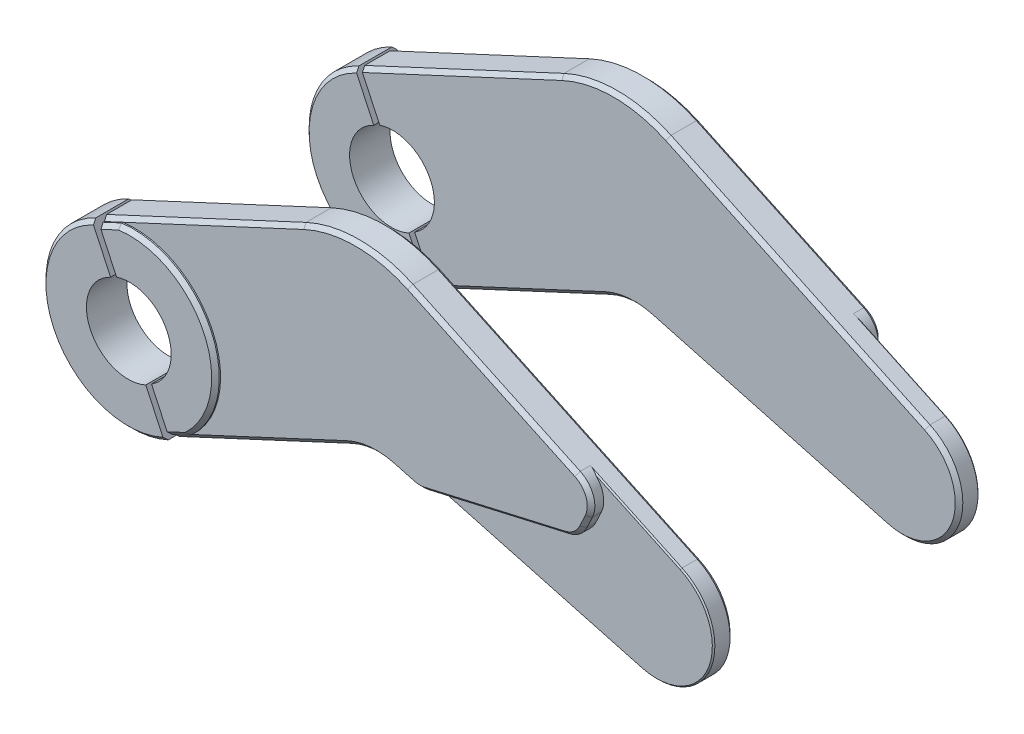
ISO-10303-21;
HEADER;
FILE_DESCRIPTION(('STEP AP214'),'2;1');
FILE_NAME('part.step','',(''),(''),'','','');
FILE_SCHEMA(('AUTOMOTIVE_DESIGN { 1 0 10303 214 1 1 1 1 }'));
ENDSEC;
DATA;
#1=APPLICATION_CONTEXT('core data for automotive mechanical design processes');
#2=APPLICATION_PROTOCOL_DEFINITION('international standard','automotive_design',2000,#1);
#3=PRODUCT_CONTEXT('',#1,'mechanical');
#4=PRODUCT('Part','Part','',(#3));
#5=PRODUCT_RELATED_PRODUCT_CATEGORY('part','',(#4));
#6=PRODUCT_DEFINITION_FORMATION('','',#4);
#7=PRODUCT_DEFINITION_CONTEXT('part definition',#1,'design');
#8=PRODUCT_DEFINITION('design','',#6,#7);
#9=PRODUCT_DEFINITION_SHAPE('','',#8);
#10=(LENGTH_UNIT() NAMED_UNIT(*) SI_UNIT(.MILLI.,.METRE.));
#11=(NAMED_UNIT(*) PLANE_ANGLE_UNIT() SI_UNIT($,.RADIAN.));
#12=(NAMED_UNIT(*) SI_UNIT($,.STERADIAN.) SOLID_ANGLE_UNIT());
#13=UNCERTAINTY_MEASURE_WITH_UNIT(LENGTH_MEASURE(1.E-05),#10,'distance_accuracy_value','');
#14=(GEOMETRIC_REPRESENTATION_CONTEXT(3) GLOBAL_UNCERTAINTY_ASSIGNED_CONTEXT((#13)) GLOBAL_UNIT_ASSIGNED_CONTEXT((#10,
#11,#12)) REPRESENTATION_CONTEXT('',''));
#15=CARTESIAN_POINT('',(0.,0.,0.));
#16=DIRECTION('',(0.,0.,1.));
#17=DIRECTION('',(1.,0.,0.));
#18=AXIS2_PLACEMENT_3D('',#15,#16,#17);
#19=CARTESIAN_POINT('',(0.,0.,-59.5));
#20=DIRECTION('',(0.,0.,-1.));
#21=DIRECTION('',(-1.,0.,0.));
#22=AXIS2_PLACEMENT_3D('',#19,#20,#21);
#23=PLANE('',#22);
#24=DIRECTION('',(-0.421925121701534,0.906630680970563,0.));
#25=VECTOR('',#24,1.);
#26=CARTESIAN_POINT('',(16.1587154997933,-29.9815929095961,-59.5));
#27=LINE('',#26,#25);
#28=CARTESIAN_POINT('',(14.8929401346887,-27.2617008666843,-59.5));
#29=VERTEX_POINT('',#28);
#30=CARTESIAN_POINT('',(8.72369418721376,-14.0052547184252,-59.5));
#31=VERTEX_POINT('',#30);
#32=EDGE_CURVE('E1435',#29,#31,#27,.T.);
#33=ORIENTED_EDGE('',*,*,#32,.T.);
#34=CARTESIAN_POINT('',(0.,0.,-59.5));
#35=DIRECTION('',(0.,0.,1.));
#36=DIRECTION('',(-1.,0.,0.));
#37=AXIS2_PLACEMENT_3D('',#34,#35,#36);
#38=CIRCLE('',#37,16.5);
#39=CARTESIAN_POINT('',(-5.09717146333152,15.6929552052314,-59.5));
#40=VERTEX_POINT('',#39);
#41=EDGE_CURVE('E1505',#31,#40,#38,.T.);
#42=ORIENTED_EDGE('',*,*,#41,.T.);
#43=CARTESIAN_POINT('',(-11.2664174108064,28.9494013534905,-59.5));
#44=VERTEX_POINT('',#43);
#45=EDGE_CURVE('E1430',#40,#44,#27,.T.);
#46=ORIENTED_EDGE('',*,*,#45,.T.);
#47=DIRECTION('',(-0.906630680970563,-0.421925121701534,0.));
#48=VECTOR('',#47,1.);
#49=CARTESIAN_POINT('',(-13.0796787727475,28.1055511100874,-59.5));
#50=LINE('',#49,#48);
#51=CARTESIAN_POINT('',(-4.23131632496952,32.2233760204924,-59.5));
#52=VERTEX_POINT('',#51);
#53=EDGE_CURVE('E436',#52,#44,#50,.T.);
#54=ORIENTED_EDGE('',*,*,#53,.F.);
#55=CARTESIAN_POINT('',(0.,0.,-59.5));
#56=DIRECTION('',(0.,0.,1.));
#57=DIRECTION('',(-1.,0.,0.));
#58=AXIS2_PLACEMENT_3D('',#55,#56,#57);
#59=CIRCLE('',#58,32.5);
#60=CARTESIAN_POINT('',(21.9280412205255,-23.9877261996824,-59.5));
#61=VERTEX_POINT('',#60);
#62=EDGE_CURVE('E432',#61,#52,#59,.T.);
#63=ORIENTED_EDGE('',*,*,#62,.F.);
#64=DIRECTION('',(0.906630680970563,0.421925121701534,0.));
#65=VECTOR('',#64,1.);
#66=CARTESIAN_POINT('',(22.1346456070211,-23.8915772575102,-59.5));
#67=LINE('',#66,#65);
#68=EDGE_CURVE('E428',#29,#61,#67,.T.);
#69=ORIENTED_EDGE('',*,*,#68,.F.);
#70=EDGE_LOOP('',(#33,#42,#46,#54,#63,#69));
#71=FACE_BOUND('',#70,.T.);
#72=ADVANCED_FACE('F90',(#71),#23,.T.);
#73=CARTESIAN_POINT('',(0.,0.,-44.5));
#74=DIRECTION('',(0.,0.,-1.));
#75=DIRECTION('',(-1.,0.,0.));
#76=AXIS2_PLACEMENT_3D('',#73,#74,#75);
#77=CYLINDRICAL_SURFACE('',#76,34.);
#78=DIRECTION('',(0.,0.,-1.));
#79=VECTOR('',#78,1.);
#80=CARTESIAN_POINT('',(-4.65759962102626,33.6794709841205,-44.5));
#81=LINE('',#80,#79);
#82=CARTESIAN_POINT('',(-4.65759962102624,33.6794709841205,-57.5));
#83=VERTEX_POINT('',#82);
#84=CARTESIAN_POINT('',(-4.65759962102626,33.6794709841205,-57.9999999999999));
#85=VERTEX_POINT('',#84);
#86=EDGE_CURVE('E1292',#83,#85,#81,.T.);
#87=ORIENTED_EDGE('',*,*,#86,.F.);
#88=CARTESIAN_POINT('',(0.,0.,-57.5));
#89=DIRECTION('',(0.,0.,1.));
#90=DIRECTION('',(-1.,0.,0.));
#91=AXIS2_PLACEMENT_3D('',#88,#89,#90);
#92=CIRCLE('',#91,34.);
#93=CARTESIAN_POINT('',(22.7675332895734,-25.2515232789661,-57.5));
#94=VERTEX_POINT('',#93);
#95=EDGE_CURVE('E1482',#94,#83,#92,.T.);
#96=ORIENTED_EDGE('',*,*,#95,.F.);
#97=DIRECTION('',(0.,0.,-1.));
#98=VECTOR('',#97,1.);
#99=CARTESIAN_POINT('',(22.7675332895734,-25.2515232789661,-44.5));
#100=LINE('',#99,#98);
#101=CARTESIAN_POINT('',(22.7675332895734,-25.2515232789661,-57.9999999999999));
#102=VERTEX_POINT('',#101);
#103=EDGE_CURVE('E384',#94,#102,#100,.T.);
#104=ORIENTED_EDGE('',*,*,#103,.T.);
#105=CARTESIAN_POINT('',(0.,0.,-57.9999999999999));
#106=DIRECTION('',(0.,0.,1.));
#107=DIRECTION('',(-1.,0.,0.));
#108=AXIS2_PLACEMENT_3D('',#105,#106,#107);
#109=CIRCLE('',#108,34.);
#110=EDGE_CURVE('E452',#85,#102,#109,.F.);
#111=ORIENTED_EDGE('',*,*,#110,.F.);
#112=EDGE_LOOP('',(#87,#96,#104,#111));
#113=FACE_BOUND('',#112,.T.);
#114=ADVANCED_FACE('F650',(#113),#77,.T.);
#115=CARTESIAN_POINT('',(16.1587154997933,-29.9815929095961,-44.5));
#116=DIRECTION('',(0.906630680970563,0.421925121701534,0.));
#117=DIRECTION('',(-0.421925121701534,0.906630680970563,0.));
#118=AXIS2_PLACEMENT_3D('',#115,#116,#117);
#119=PLANE('',#118);
#120=DIRECTION('',(0.298346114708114,-0.641084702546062,-0.707106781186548));
#121=VECTOR('',#120,1.);
#122=CARTESIAN_POINT('',(-11.8993050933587,30.3093473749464,-57.9999999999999));
#123=LINE('',#122,#121);
#124=CARTESIAN_POINT('',(-11.8993050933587,30.3093473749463,-57.9999999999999));
#125=VERTEX_POINT('',#124);
#126=EDGE_CURVE('E448',#44,#125,#123,.F.);
#127=ORIENTED_EDGE('',*,*,#126,.F.);
#128=ORIENTED_EDGE('',*,*,#45,.F.);
#129=DIRECTION('',(0.,0.,-1.));
#130=VECTOR('',#129,1.);
#131=CARTESIAN_POINT('',(-5.09717146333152,15.6929552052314,-59.5));
#132=LINE('',#131,#130);
#133=CARTESIAN_POINT('',(-5.09717146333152,15.6929552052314,-44.5));
#134=VERTEX_POINT('',#133);
#135=EDGE_CURVE('E1475',#40,#134,#132,.F.);
#136=ORIENTED_EDGE('',*,*,#135,.T.);
#137=DIRECTION('',(-0.421925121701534,0.906630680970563,0.));
#138=VECTOR('',#137,1.);
#139=CARTESIAN_POINT('',(16.1587154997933,-29.9815929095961,-44.5));
#140=LINE('',#139,#138);
#141=CARTESIAN_POINT('',(-11.8993050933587,30.3093473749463,-44.5));
#142=VERTEX_POINT('',#141);
#143=EDGE_CURVE('E1441',#134,#142,#140,.T.);
#144=ORIENTED_EDGE('',*,*,#143,.T.);
#145=DIRECTION('',(0.298346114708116,-0.641084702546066,0.707106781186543));
#146=VECTOR('',#145,1.);
#147=CARTESIAN_POINT('',(-12.532192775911,31.6692933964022,-46.));
#148=LINE('',#147,#146);
#149=CARTESIAN_POINT('',(-12.532192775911,31.6692933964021,-46.));
#150=VERTEX_POINT('',#149);
#151=EDGE_CURVE('E440',#150,#142,#148,.T.);
#152=ORIENTED_EDGE('',*,*,#151,.F.);
#153=DIRECTION('',(0.,0.,-1.));
#154=VECTOR('',#153,1.);
#155=CARTESIAN_POINT('',(-12.532192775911,31.6692933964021,-44.5));
#156=LINE('',#155,#154);
#157=CARTESIAN_POINT('',(-12.532192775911,31.6692933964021,-56.));
#158=VERTEX_POINT('',#157);
#159=EDGE_CURVE('E1460',#150,#158,#156,.T.);
#160=ORIENTED_EDGE('',*,*,#159,.T.);
#161=DIRECTION('',(0.298346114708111,-0.641084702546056,-0.707106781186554));
#162=VECTOR('',#161,1.);
#163=CARTESIAN_POINT('',(-11.8993050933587,30.3093473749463,-57.5));
#164=LINE('',#163,#162);
#165=CARTESIAN_POINT('',(-11.8993050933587,30.3093473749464,-57.5));
#166=VERTEX_POINT('',#165);
#167=EDGE_CURVE('E444',#166,#158,#164,.F.);
#168=ORIENTED_EDGE('',*,*,#167,.F.);
#169=DIRECTION('',(0.,0.,-1.));
#170=VECTOR('',#169,1.);
#171=CARTESIAN_POINT('',(-11.8993050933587,30.3093473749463,-44.5));
#172=LINE('',#171,#170);
#173=EDGE_CURVE('E409',#166,#125,#172,.T.);
#174=ORIENTED_EDGE('',*,*,#173,.T.);
#175=EDGE_LOOP('',(#127,#128,#136,#144,#152,#160,#168,#174));
#176=FACE_BOUND('',#175,.T.);
#177=ADVANCED_FACE('F680',(#176),#119,.F.);
#178=DIRECTION('',(0.,0.,-1.));
#179=VECTOR('',#178,1.);
#180=CARTESIAN_POINT('',(8.72369418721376,-14.0052547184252,-59.5));
#181=LINE('',#180,#179);
#182=CARTESIAN_POINT('',(8.72369418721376,-14.0052547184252,-44.5));
#183=VERTEX_POINT('',#182);
#184=EDGE_CURVE('E1469',#183,#31,#181,.T.);
#185=ORIENTED_EDGE('',*,*,#184,.T.);
#186=ORIENTED_EDGE('',*,*,#32,.F.);
#187=DIRECTION('',(-0.298346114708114,0.641084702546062,-0.707106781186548));
#188=VECTOR('',#187,1.);
#189=CARTESIAN_POINT('',(14.8929401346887,-27.2617008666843,-59.5));
#190=LINE('',#189,#188);
#191=CARTESIAN_POINT('',(15.525827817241,-28.6216468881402,-57.9999999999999));
#192=VERTEX_POINT('',#191);
#193=EDGE_CURVE('E401',#192,#29,#190,.T.);
#194=ORIENTED_EDGE('',*,*,#193,.F.);
#195=DIRECTION('',(0.,0.,-1.));
#196=VECTOR('',#195,1.);
#197=CARTESIAN_POINT('',(15.525827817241,-28.6216468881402,-44.5));
#198=LINE('',#197,#196);
#199=CARTESIAN_POINT('',(15.525827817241,-28.6216468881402,-57.5));
#200=VERTEX_POINT('',#199);
#201=EDGE_CURVE('E382',#200,#192,#198,.T.);
#202=ORIENTED_EDGE('',*,*,#201,.F.);
#203=DIRECTION('',(0.298346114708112,-0.641084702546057,0.707106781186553));
#204=VECTOR('',#203,1.);
#205=CARTESIAN_POINT('',(15.525827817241,-28.6216468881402,-57.5));
#206=LINE('',#205,#204);
#207=CARTESIAN_POINT('',(16.1587154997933,-29.9815929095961,-56.));
#208=VERTEX_POINT('',#207);
#209=EDGE_CURVE('E393',#208,#200,#206,.F.);
#210=ORIENTED_EDGE('',*,*,#209,.F.);
#211=DIRECTION('',(0.,0.,-1.));
#212=VECTOR('',#211,1.);
#213=CARTESIAN_POINT('',(16.1587154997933,-29.9815929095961,-44.5));
#214=LINE('',#213,#212);
#215=CARTESIAN_POINT('',(16.1587154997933,-29.9815929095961,-46.));
#216=VERTEX_POINT('',#215);
#217=EDGE_CURVE('E1455',#216,#208,#214,.T.);
#218=ORIENTED_EDGE('',*,*,#217,.F.);
#219=DIRECTION('',(0.298346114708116,-0.641084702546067,-0.707106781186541));
#220=VECTOR('',#219,1.);
#221=CARTESIAN_POINT('',(16.1587154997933,-29.9815929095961,-46.));
#222=LINE('',#221,#220);
#223=CARTESIAN_POINT('',(15.525827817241,-28.6216468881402,-44.5));
#224=VERTEX_POINT('',#223);
#225=EDGE_CURVE('E402',#224,#216,#222,.T.);
#226=ORIENTED_EDGE('',*,*,#225,.F.);
#227=EDGE_CURVE('E1447',#224,#183,#140,.T.);
#228=ORIENTED_EDGE('',*,*,#227,.T.);
#229=EDGE_LOOP('',(#185,#186,#194,#202,#210,#218,#226,#228));
#230=FACE_BOUND('',#229,.T.);
#231=ADVANCED_FACE('F406',(#230),#119,.F.);
#232=CARTESIAN_POINT('',(45.7500161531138,97.7075512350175,-44.5));
#233=DIRECTION('',(0.424050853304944,0.905638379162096,0.));
#234=DIRECTION('',(-0.905638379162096,0.424050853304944,0.));
#235=AXIS2_PLACEMENT_3D('',#232,#233,#234);
#236=PLANE('',#235);
#237=DIRECTION('',(0.,0.,-1.));
#238=VECTOR('',#237,1.);
#239=CARTESIAN_POINT('',(174.678349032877,37.338897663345,-44.5));
#240=LINE('',#239,#238);
#241=CARTESIAN_POINT('',(174.678349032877,37.338897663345,-56.));
#242=VERTEX_POINT('',#241);
#243=CARTESIAN_POINT('',(174.678349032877,37.338897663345,-52.));
#244=VERTEX_POINT('',#243);
#245=EDGE_CURVE('E1600',#242,#244,#240,.F.);
#246=ORIENTED_EDGE('',*,*,#245,.F.);
#247=DIRECTION('',(0.905638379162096,-0.424050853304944,0.));
#248=VECTOR('',#247,1.);
#249=CARTESIAN_POINT('',(45.7500161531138,97.7075512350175,-56.));
#250=LINE('',#249,#248);
#251=CARTESIAN_POINT('',(108.570125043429,68.2930284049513,-56.));
#252=VERTEX_POINT('',#251);
#253=EDGE_CURVE('E526',#252,#242,#250,.T.);
#254=ORIENTED_EDGE('',*,*,#253,.F.);
#255=DIRECTION('',(0.,0.,-1.));
#256=VECTOR('',#255,1.);
#257=CARTESIAN_POINT('',(108.570125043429,68.2930284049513,-44.5));
#258=LINE('',#257,#256);
#259=CARTESIAN_POINT('',(108.570125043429,68.2930284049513,-46.));
#260=VERTEX_POINT('',#259);
#261=EDGE_CURVE('E1543',#260,#252,#258,.T.);
#262=ORIENTED_EDGE('',*,*,#261,.F.);
#263=DIRECTION('',(-0.905638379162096,0.424050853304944,0.));
#264=VECTOR('',#263,1.);
#265=CARTESIAN_POINT('',(108.570125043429,68.2930284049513,-46.));
#266=LINE('',#265,#264);
#267=CARTESIAN_POINT('',(210.903884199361,20.3768635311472,-46.));
#268=VERTEX_POINT('',#267);
#269=EDGE_CURVE('E522',#268,#260,#266,.T.);
#270=ORIENTED_EDGE('',*,*,#269,.F.);
#271=DIRECTION('',(0.,0.,-1.));
#272=VECTOR('',#271,1.);
#273=CARTESIAN_POINT('',(210.903884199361,20.3768635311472,-44.5));
#274=LINE('',#273,#272);
#275=CARTESIAN_POINT('',(210.903884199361,20.3768635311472,-52.));
#276=VERTEX_POINT('',#275);
#277=EDGE_CURVE('E1535',#268,#276,#274,.T.);
#278=ORIENTED_EDGE('',*,*,#277,.T.);
#279=DIRECTION('',(0.905638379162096,-0.424050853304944,0.));
#280=VECTOR('',#279,1.);
#281=CARTESIAN_POINT('',(45.7500161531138,97.7075512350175,-52.));
#282=LINE('',#281,#280);
#283=EDGE_CURVE('E1843',#244,#276,#282,.T.);
#284=ORIENTED_EDGE('',*,*,#283,.F.);
#285=EDGE_LOOP('',(#246,#254,#262,#270,#278,#284));
#286=FACE_BOUND('',#285,.T.);
#287=ADVANCED_FACE('F660',(#286),#236,.T.);
#288=CARTESIAN_POINT('',(7.79059888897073,28.8920880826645,-44.5));
#289=DIRECTION('',(-0.260346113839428,-0.965515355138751,0.));
#290=DIRECTION('',(0.965515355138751,-0.260346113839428,0.));
#291=AXIS2_PLACEMENT_3D('',#288,#289,#290);
#292=PLANE('',#291);
#293=DIRECTION('',(0.,0.,-1.));
#294=VECTOR('',#293,1.);
#295=CARTESIAN_POINT('',(195.504952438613,-21.7240954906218,-44.5));
#296=LINE('',#295,#294);
#297=CARTESIAN_POINT('',(195.504952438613,-21.7240954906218,-46.));
#298=VERTEX_POINT('',#297);
#299=CARTESIAN_POINT('',(195.504952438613,-21.7240954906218,-52.));
#300=VERTEX_POINT('',#299);
#301=EDGE_CURVE('E1528',#298,#300,#296,.T.);
#302=ORIENTED_EDGE('',*,*,#301,.F.);
#303=DIRECTION('',(0.965515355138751,-0.260346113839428,0.));
#304=VECTOR('',#303,1.);
#305=CARTESIAN_POINT('',(195.504952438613,-21.7240954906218,-46.));
#306=LINE('',#305,#304);
#307=CARTESIAN_POINT('',(102.335222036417,3.39863001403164,-46.));
#308=VERTEX_POINT('',#307);
#309=EDGE_CURVE('E550',#308,#298,#306,.T.);
#310=ORIENTED_EDGE('',*,*,#309,.F.);
#311=DIRECTION('',(0.,0.,-1.));
#312=VECTOR('',#311,1.);
#313=CARTESIAN_POINT('',(102.335222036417,3.39863001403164,-44.5));
#314=LINE('',#313,#312);
#315=CARTESIAN_POINT('',(102.335222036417,3.39863001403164,-56.));
#316=VERTEX_POINT('',#315);
#317=EDGE_CURVE('E1520',#308,#316,#314,.T.);
#318=ORIENTED_EDGE('',*,*,#317,.T.);
#319=DIRECTION('',(-0.965515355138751,0.260346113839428,0.));
#320=VECTOR('',#319,1.);
#321=CARTESIAN_POINT('',(7.79059888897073,28.8920880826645,-56.));
#322=LINE('',#321,#320);
#323=CARTESIAN_POINT('',(110.203925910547,1.27687559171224,-56.));
#324=VERTEX_POINT('',#323);
#325=EDGE_CURVE('E554',#324,#316,#322,.T.);
#326=ORIENTED_EDGE('',*,*,#325,.F.);
#327=DIRECTION('',(0.,0.,-1.));
#328=VECTOR('',#327,1.);
#329=CARTESIAN_POINT('',(110.203925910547,1.27687559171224,-44.5));
#330=LINE('',#329,#328);
#331=CARTESIAN_POINT('',(110.203925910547,1.27687559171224,-52.));
#332=VERTEX_POINT('',#331);
#333=EDGE_CURVE('E1565',#332,#324,#330,.T.);
#334=ORIENTED_EDGE('',*,*,#333,.F.);
#335=DIRECTION('',(-0.965515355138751,0.260346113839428,0.));
#336=VECTOR('',#335,1.);
#337=CARTESIAN_POINT('',(7.79059888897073,28.8920880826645,-52.));
#338=LINE('',#337,#336);
#339=EDGE_CURVE('E1856',#300,#332,#338,.T.);
#340=ORIENTED_EDGE('',*,*,#339,.F.);
#341=EDGE_LOOP('',(#302,#310,#318,#326,#334,#340));
#342=FACE_BOUND('',#341,.T.);
#343=ADVANCED_FACE('F656',(#342),#292,.T.);
#344=CARTESIAN_POINT('',(95.566223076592,-21.7047692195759,-44.5));
#345=DIRECTION('',(0.,0.,-1.));
#346=DIRECTION('',(-1.,0.,0.));
#347=AXIS2_PLACEMENT_3D('',#344,#345,#346);
#348=CYLINDRICAL_SURFACE('',#347,26.);
#349=ORIENTED_EDGE('',*,*,#317,.F.);
#350=CARTESIAN_POINT('',(95.566223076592,-21.7047692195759,-46.));
#351=DIRECTION('',(0.,0.,0.999999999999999));
#352=DIRECTION('',(-1.,0.,0.));
#353=AXIS2_PLACEMENT_3D('',#350,#351,#352);
#354=CIRCLE('',#353,26.);
#355=CARTESIAN_POINT('',(84.5961699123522,1.86762848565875,-46.));
#356=VERTEX_POINT('',#355);
#357=EDGE_CURVE('E558',#356,#308,#354,.F.);
#358=ORIENTED_EDGE('',*,*,#357,.F.);
#359=DIRECTION('',(0.,0.,-1.));
#360=VECTOR('',#359,1.);
#361=CARTESIAN_POINT('',(84.5961699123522,1.86762848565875,-44.5));
#362=LINE('',#361,#360);
#363=CARTESIAN_POINT('',(84.5961699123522,1.86762848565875,-56.));
#364=VERTEX_POINT('',#363);
#365=EDGE_CURVE('E1558',#356,#364,#362,.T.);
#366=ORIENTED_EDGE('',*,*,#365,.T.);
#367=CARTESIAN_POINT('',(95.566223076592,-21.7047692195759,-56.));
#368=DIRECTION('',(0.,0.,1.));
#369=DIRECTION('',(-1.,0.,0.));
#370=AXIS2_PLACEMENT_3D('',#367,#368,#369);
#371=CIRCLE('',#370,26.);
#372=EDGE_CURVE('E562',#316,#364,#371,.T.);
#373=ORIENTED_EDGE('',*,*,#372,.F.);
#374=EDGE_LOOP('',(#349,#358,#366,#373));
#375=FACE_BOUND('',#374,.T.);
#376=ADVANCED_FACE('F652',(#375),#348,.F.);
#377=CARTESIAN_POINT('',(14.3454541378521,-30.8254431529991,-44.5));
#378=DIRECTION('',(0.421925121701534,-0.906630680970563,0.));
#379=DIRECTION('',(0.906630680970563,0.421925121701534,0.));
#380=AXIS2_PLACEMENT_3D('',#377,#378,#379);
#381=PLANE('',#380);
#382=ORIENTED_EDGE('',*,*,#365,.F.);
#383=DIRECTION('',(0.906630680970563,0.421925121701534,0.));
#384=VECTOR('',#383,1.);
#385=CARTESIAN_POINT('',(84.5961699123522,1.86762848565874,-46.));
#386=LINE('',#385,#384);
#387=EDGE_CURVE('E566',#216,#356,#386,.T.);
#388=ORIENTED_EDGE('',*,*,#387,.F.);
#389=ORIENTED_EDGE('',*,*,#217,.T.);
#390=DIRECTION('',(-0.906630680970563,-0.421925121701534,0.));
#391=VECTOR('',#390,1.);
#392=CARTESIAN_POINT('',(14.3454541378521,-30.8254431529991,-56.));
#393=LINE('',#392,#391);
#394=EDGE_CURVE('E396',#364,#208,#393,.T.);
#395=ORIENTED_EDGE('',*,*,#394,.F.);
#396=EDGE_LOOP('',(#382,#388,#389,#395));
#397=FACE_BOUND('',#396,.T.);
#398=ADVANCED_FACE('F655',(#397),#381,.T.);
#399=CARTESIAN_POINT('',(-14.3454541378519,30.8254431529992,-44.5));
#400=DIRECTION('',(-0.421925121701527,0.906630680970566,0.));
#401=DIRECTION('',(-0.906630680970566,-0.421925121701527,0.));
#402=AXIS2_PLACEMENT_3D('',#399,#400,#401);
#403=PLANE('',#402);
#404=ORIENTED_EDGE('',*,*,#159,.F.);
#405=DIRECTION('',(-0.906630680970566,-0.421925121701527,0.));
#406=VECTOR('',#405,1.);
#407=CARTESIAN_POINT('',(-12.532192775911,31.6692933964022,-46.));
#408=LINE('',#407,#406);
#409=CARTESIAN_POINT('',(66.2713262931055,68.3426434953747,-46.));
#410=VERTEX_POINT('',#409);
#411=EDGE_CURVE('E507',#410,#150,#408,.T.);
#412=ORIENTED_EDGE('',*,*,#411,.F.);
#413=DIRECTION('',(0.,0.,-1.));
#414=VECTOR('',#413,1.);
#415=CARTESIAN_POINT('',(66.2713262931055,68.3426434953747,-44.5));
#416=LINE('',#415,#414);
#417=CARTESIAN_POINT('',(66.2713262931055,68.3426434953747,-56.));
#418=VERTEX_POINT('',#417);
#419=EDGE_CURVE('E1550',#410,#418,#416,.T.);
#420=ORIENTED_EDGE('',*,*,#419,.T.);
#421=DIRECTION('',(0.906630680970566,0.421925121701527,0.));
#422=VECTOR('',#421,1.);
#423=CARTESIAN_POINT('',(-14.3454541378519,30.8254431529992,-56.));
#424=LINE('',#423,#422);
#425=EDGE_CURVE('E510',#158,#418,#424,.T.);
#426=ORIENTED_EDGE('',*,*,#425,.F.);
#427=EDGE_LOOP('',(#404,#412,#420,#426));
#428=FACE_BOUND('',#427,.T.);
#429=ADVANCED_FACE('F673',(#428),#403,.T.);
#430=CARTESIAN_POINT('',(87.3675823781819,23.0111094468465,-44.5));
#431=DIRECTION('',(0.,0.,-1.));
#432=DIRECTION('',(-1.,0.,0.));
#433=AXIS2_PLACEMENT_3D('',#430,#431,#432);
#434=CYLINDRICAL_SURFACE('',#433,50.);
#435=ORIENTED_EDGE('',*,*,#419,.F.);
#436=CARTESIAN_POINT('',(87.3675823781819,23.0111094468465,-46.));
#437=DIRECTION('',(0.,0.,0.999999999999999));
#438=DIRECTION('',(-1.,0.,0.));
#439=AXIS2_PLACEMENT_3D('',#436,#437,#438);
#440=CIRCLE('',#439,50.);
#441=EDGE_CURVE('E514',#260,#410,#440,.T.);
#442=ORIENTED_EDGE('',*,*,#441,.F.);
#443=ORIENTED_EDGE('',*,*,#261,.T.);
#444=CARTESIAN_POINT('',(87.3675823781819,23.0111094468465,-56.));
#445=DIRECTION('',(0.,0.,1.));
#446=DIRECTION('',(-1.,0.,0.));
#447=AXIS2_PLACEMENT_3D('',#444,#445,#446);
#448=CIRCLE('',#447,50.);
#449=EDGE_CURVE('E518',#418,#252,#448,.F.);
#450=ORIENTED_EDGE('',*,*,#449,.F.);
#451=EDGE_LOOP('',(#435,#442,#443,#450));
#452=FACE_BOUND('',#451,.T.);
#453=ADVANCED_FACE('F669',(#452),#434,.T.);
#454=CARTESIAN_POINT('',(175.253715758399,14.9856215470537,79.8707370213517));
#455=DIRECTION('',(0.223410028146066,-0.974724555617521,0.));
#456=DIRECTION('',(0.974724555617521,0.223410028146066,0.));
#457=AXIS2_PLACEMENT_3D('',#454,#455,#456);
#458=PLANE('',#457);
#459=DIRECTION('',(0.,0.,-1.));
#460=VECTOR('',#459,1.);
#461=CARTESIAN_POINT('',(170.499666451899,13.8959780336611,79.8707370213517));
#462=LINE('',#461,#460);
#463=CARTESIAN_POINT('',(170.499666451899,13.8959780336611,-52.5));
#464=VERTEX_POINT('',#463);
#465=CARTESIAN_POINT('',(170.499666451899,13.8959780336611,-56.));
#466=VERTEX_POINT('',#465);
#467=EDGE_CURVE('E1571',#464,#466,#462,.T.);
#468=ORIENTED_EDGE('',*,*,#467,.F.);
#469=DIRECTION('',(-0.974724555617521,-0.223410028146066,0.));
#470=VECTOR('',#469,1.);
#471=CARTESIAN_POINT('',(175.253715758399,14.9856215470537,-52.5));
#472=LINE('',#471,#470);
#473=CARTESIAN_POINT('',(115.041487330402,1.18478358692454,-52.5));
#474=VERTEX_POINT('',#473);
#475=EDGE_CURVE('E1489',#464,#474,#472,.T.);
#476=ORIENTED_EDGE('',*,*,#475,.T.);
#477=DIRECTION('',(0.,0.,-1.));
#478=VECTOR('',#477,1.);
#479=CARTESIAN_POINT('',(115.041487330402,1.18478358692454,79.8707370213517));
#480=LINE('',#479,#478);
#481=CARTESIAN_POINT('',(115.041487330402,1.18478358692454,-56.));
#482=VERTEX_POINT('',#481);
#483=EDGE_CURVE('E1579',#482,#474,#480,.F.);
#484=ORIENTED_EDGE('',*,*,#483,.F.);
#485=DIRECTION('',(-0.974724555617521,-0.223410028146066,0.));
#486=VECTOR('',#485,1.);
#487=CARTESIAN_POINT('',(175.253715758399,14.9856215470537,-56.));
#488=LINE('',#487,#486);
#489=EDGE_CURVE('E542',#466,#482,#488,.T.);
#490=ORIENTED_EDGE('',*,*,#489,.F.);
#491=EDGE_LOOP('',(#468,#476,#484,#490));
#492=FACE_BOUND('',#491,.T.);
#493=ADVANCED_FACE('F672',(#492),#458,.T.);
#494=CARTESIAN_POINT('',(183.734732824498,33.0983891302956,79.8707370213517));
#495=DIRECTION('',(0.905638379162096,-0.424050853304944,0.));
#496=DIRECTION('',(0.424050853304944,0.905638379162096,0.));
#497=AXIS2_PLACEMENT_3D('',#494,#495,#496);
#498=PLANE('',#497);
#499=DIRECTION('',(0.,0.,-1.));
#500=VECTOR('',#499,1.);
#501=CARTESIAN_POINT('',(179.494224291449,24.0420053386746,79.8707370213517));
#502=LINE('',#501,#500);
#503=CARTESIAN_POINT('',(179.494224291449,24.0420053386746,-52.5));
#504=VERTEX_POINT('',#503);
#505=CARTESIAN_POINT('',(179.494224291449,24.0420053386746,-56.));
#506=VERTEX_POINT('',#505);
#507=EDGE_CURVE('E1593',#504,#506,#502,.T.);
#508=ORIENTED_EDGE('',*,*,#507,.F.);
#509=DIRECTION('',(-0.424050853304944,-0.905638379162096,0.));
#510=VECTOR('',#509,1.);
#511=CARTESIAN_POINT('',(183.734732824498,33.0983891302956,-52.5));
#512=LINE('',#511,#510);
#513=CARTESIAN_POINT('',(177.321949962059,19.4027150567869,-52.5));
#514=VERTEX_POINT('',#513);
#515=EDGE_CURVE('E1497',#504,#514,#512,.T.);
#516=ORIENTED_EDGE('',*,*,#515,.T.);
#517=DIRECTION('',(0.,0.,-1.));
#518=VECTOR('',#517,1.);
#519=CARTESIAN_POINT('',(177.321949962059,19.4027150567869,79.8707370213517));
#520=LINE('',#519,#518);
#521=CARTESIAN_POINT('',(177.321949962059,19.4027150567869,-56.));
#522=VERTEX_POINT('',#521);
#523=EDGE_CURVE('E1586',#522,#514,#520,.F.);
#524=ORIENTED_EDGE('',*,*,#523,.F.);
#525=DIRECTION('',(-0.424050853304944,-0.905638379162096,0.));
#526=VECTOR('',#525,1.);
#527=CARTESIAN_POINT('',(183.734732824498,33.0983891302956,-56.));
#528=LINE('',#527,#526);
#529=EDGE_CURVE('E534',#506,#522,#528,.T.);
#530=ORIENTED_EDGE('',*,*,#529,.F.);
#531=EDGE_LOOP('',(#508,#516,#524,#530));
#532=FACE_BOUND('',#531,.T.);
#533=ADVANCED_FACE('F664',(#532),#498,.T.);
#534=CARTESIAN_POINT('',(201.36274,0.,-44.5));
#535=DIRECTION('',(0.,0.,-1.));
#536=DIRECTION('',(-1.,0.,0.));
#537=AXIS2_PLACEMENT_3D('',#534,#535,#536);
#538=CYLINDRICAL_SURFACE('',#537,22.5);
#539=ORIENTED_EDGE('',*,*,#277,.F.);
#540=CARTESIAN_POINT('',(201.36274,0.,-46.));
#541=DIRECTION('',(0.,0.,0.999999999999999));
#542=DIRECTION('',(-1.,0.,0.));
#543=AXIS2_PLACEMENT_3D('',#540,#541,#542);
#544=CIRCLE('',#543,22.5);
#545=EDGE_CURVE('E599',#298,#268,#544,.T.);
#546=ORIENTED_EDGE('',*,*,#545,.F.);
#547=ORIENTED_EDGE('',*,*,#301,.T.);
#548=CARTESIAN_POINT('',(201.36274,0.,-52.));
#549=DIRECTION('',(0.,0.,1.));
#550=DIRECTION('',(-1.,0.,0.));
#551=AXIS2_PLACEMENT_3D('',#548,#549,#550);
#552=CIRCLE('',#551,22.5);
#553=EDGE_CURVE('E1850',#276,#300,#552,.F.);
#554=ORIENTED_EDGE('',*,*,#553,.F.);
#555=EDGE_LOOP('',(#539,#546,#547,#554));
#556=FACE_BOUND('',#555,.T.);
#557=ADVANCED_FACE('F646',(#556),#538,.T.);
#558=CARTESIAN_POINT('',(0.,0.,-44.5));
#559=DIRECTION('',(0.,0.,-1.));
#560=DIRECTION('',(-1.,0.,0.));
#561=AXIS2_PLACEMENT_3D('',#558,#559,#560);
#562=PLANE('',#561);
#563=ORIENTED_EDGE('',*,*,#143,.F.);
#564=CARTESIAN_POINT('',(0.,0.,-44.5));
#565=DIRECTION('',(0.,0.,1.));
#566=DIRECTION('',(-1.,0.,0.));
#567=AXIS2_PLACEMENT_3D('',#564,#565,#566);
#568=CIRCLE('',#567,16.5);
#569=EDGE_CURVE('E1513',#183,#134,#568,.T.);
#570=ORIENTED_EDGE('',*,*,#569,.F.);
#571=ORIENTED_EDGE('',*,*,#227,.F.);
#572=DIRECTION('',(-0.906630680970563,-0.421925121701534,0.));
#573=VECTOR('',#572,1.);
#574=CARTESIAN_POINT('',(15.525827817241,-28.6216468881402,-44.5));
#575=LINE('',#574,#573);
#576=CARTESIAN_POINT('',(83.9632822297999,3.22757450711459,-44.5));
#577=VERTEX_POINT('',#576);
#578=EDGE_CURVE('E572',#577,#224,#575,.T.);
#579=ORIENTED_EDGE('',*,*,#578,.F.);
#580=CARTESIAN_POINT('',(95.566223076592,-21.7047692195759,-44.5));
#581=DIRECTION('',(0.,0.,1.));
#582=DIRECTION('',(-1.,0.,0.));
#583=AXIS2_PLACEMENT_3D('',#580,#581,#582);
#584=CIRCLE('',#583,27.5);
#585=CARTESIAN_POINT('',(102.725741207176,4.84690304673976,-44.5));
#586=VERTEX_POINT('',#585);
#587=EDGE_CURVE('E575',#586,#577,#584,.T.);
#588=ORIENTED_EDGE('',*,*,#587,.F.);
#589=DIRECTION('',(-0.965515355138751,0.260346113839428,0.));
#590=VECTOR('',#589,1.);
#591=CARTESIAN_POINT('',(102.725741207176,4.84690304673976,-44.5));
#592=LINE('',#591,#590);
#593=CARTESIAN_POINT('',(195.895471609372,-20.2758224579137,-44.5));
#594=VERTEX_POINT('',#593);
#595=EDGE_CURVE('E579',#594,#586,#592,.T.);
#596=ORIENTED_EDGE('',*,*,#595,.F.);
#597=CARTESIAN_POINT('',(201.36274,0.,-44.5));
#598=DIRECTION('',(0.,0.,1.));
#599=DIRECTION('',(-1.,0.,0.));
#600=AXIS2_PLACEMENT_3D('',#597,#598,#599);
#601=CIRCLE('',#600,21.);
#602=CARTESIAN_POINT('',(210.267807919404,19.0184059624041,-44.5));
#603=VERTEX_POINT('',#602);
#604=EDGE_CURVE('E583',#603,#594,#601,.F.);
#605=ORIENTED_EDGE('',*,*,#604,.F.);
#606=DIRECTION('',(0.905638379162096,-0.424050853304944,0.));
#607=VECTOR('',#606,1.);
#608=CARTESIAN_POINT('',(210.267807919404,19.0184059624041,-44.5));
#609=LINE('',#608,#607);
#610=CARTESIAN_POINT('',(107.934048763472,66.9345708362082,-44.5));
#611=VERTEX_POINT('',#610);
#612=EDGE_CURVE('E587',#611,#603,#609,.T.);
#613=ORIENTED_EDGE('',*,*,#612,.F.);
#614=CARTESIAN_POINT('',(87.3675823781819,23.0111094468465,-44.5));
#615=DIRECTION('',(0.,0.,1.));
#616=DIRECTION('',(-1.,0.,0.));
#617=AXIS2_PLACEMENT_3D('',#614,#615,#616);
#618=CIRCLE('',#617,48.5);
#619=CARTESIAN_POINT('',(66.9042139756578,66.9826974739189,-44.5));
#620=VERTEX_POINT('',#619);
#621=EDGE_CURVE('E591',#620,#611,#618,.F.);
#622=ORIENTED_EDGE('',*,*,#621,.F.);
#623=DIRECTION('',(0.906630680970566,0.421925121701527,0.));
#624=VECTOR('',#623,1.);
#625=CARTESIAN_POINT('',(66.9042139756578,66.9826974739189,-44.5));
#626=LINE('',#625,#624);
#627=EDGE_CURVE('E595',#142,#620,#626,.T.);
#628=ORIENTED_EDGE('',*,*,#627,.F.);
#629=EDGE_LOOP('',(#563,#570,#571,#579,#588,#596,#605,#613,#622,#628));
#630=FACE_BOUND('',#629,.T.);
#631=ADVANCED_FACE('F642',(#630),#562,.F.);
#632=CARTESIAN_POINT('',(0.,0.,-59.5));
#633=DIRECTION('',(0.,0.,-1.));
#634=DIRECTION('',(-1.,0.,0.));
#635=AXIS2_PLACEMENT_3D('',#632,#633,#634);
#636=CYLINDRICAL_SURFACE('',#635,16.5);
#637=ORIENTED_EDGE('',*,*,#41,.F.);
#638=ORIENTED_EDGE('',*,*,#184,.F.);
#639=ORIENTED_EDGE('',*,*,#569,.T.);
#640=ORIENTED_EDGE('',*,*,#135,.F.);
#641=EDGE_LOOP('',(#637,#638,#639,#640));
#642=FACE_BOUND('',#641,.T.);
#643=ADVANCED_FACE('F645',(#642),#636,.F.);
#644=CARTESIAN_POINT('',(0.,0.,-52.5));
#645=DIRECTION('',(0.,0.,-1.));
#646=DIRECTION('',(-1.,0.,0.));
#647=AXIS2_PLACEMENT_3D('',#644,#645,#646);
#648=PLANE('',#647);
#649=CARTESIAN_POINT('',(201.36274,0.,-52.5));
#650=DIRECTION('',(0.,0.,1.));
#651=DIRECTION('',(-1.,0.,0.));
#652=AXIS2_PLACEMENT_3D('',#649,#650,#651);
#653=CIRCLE('',#652,22.);
#654=CARTESIAN_POINT('',(195.635125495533,-21.2413378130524,-52.5));
#655=VERTEX_POINT('',#654);
#656=CARTESIAN_POINT('',(210.691858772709,19.9240443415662,-52.5));
#657=VERTEX_POINT('',#656);
#658=EDGE_CURVE('E1829',#655,#657,#653,.T.);
#659=ORIENTED_EDGE('',*,*,#658,.F.);
#660=DIRECTION('',(0.965515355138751,-0.260346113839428,0.));
#661=VECTOR('',#660,1.);
#662=CARTESIAN_POINT('',(7.92077194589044,29.3748457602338,-52.5));
#663=LINE('',#662,#661);
#664=CARTESIAN_POINT('',(113.348919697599,0.946702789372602,-52.5));
#665=VERTEX_POINT('',#664);
#666=EDGE_CURVE('E603',#665,#655,#663,.T.);
#667=ORIENTED_EDGE('',*,*,#666,.F.);
#668=CARTESIAN_POINT('',(112.807387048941,10.9320291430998,-52.5));
#669=DIRECTION('',(0.,0.,1.));
#670=DIRECTION('',(-1.,0.,0.));
#671=AXIS2_PLACEMENT_3D('',#668,#669,#670);
#672=CIRCLE('',#671,10.);
#673=EDGE_CURVE('E1608',#474,#665,#672,.F.);
#674=ORIENTED_EDGE('',*,*,#673,.F.);
#675=ORIENTED_EDGE('',*,*,#475,.F.);
#676=CARTESIAN_POINT('',(168.265566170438,23.6432235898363,-52.5));
#677=DIRECTION('',(0.,0.,1.));
#678=DIRECTION('',(-1.,0.,0.));
#679=AXIS2_PLACEMENT_3D('',#676,#677,#678);
#680=CIRCLE('',#679,10.);
#681=EDGE_CURVE('E410',#514,#464,#680,.F.);
#682=ORIENTED_EDGE('',*,*,#681,.F.);
#683=ORIENTED_EDGE('',*,*,#515,.F.);
#684=CARTESIAN_POINT('',(170.437840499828,28.282513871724,-52.5));
#685=DIRECTION('',(0.,0.,1.));
#686=DIRECTION('',(-1.,0.,0.));
#687=AXIS2_PLACEMENT_3D('',#684,#685,#686);
#688=CIRCLE('',#687,10.);
#689=CARTESIAN_POINT('',(177.294178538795,35.5619801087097,-52.5));
#690=VERTEX_POINT('',#689);
#691=EDGE_CURVE('E421',#690,#504,#688,.F.);
#692=ORIENTED_EDGE('',*,*,#691,.F.);
#693=DIRECTION('',(-0.905638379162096,0.424050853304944,0.));
#694=VECTOR('',#693,1.);
#695=CARTESIAN_POINT('',(45.5379907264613,97.2547320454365,-52.5));
#696=LINE('',#695,#694);
#697=EDGE_CURVE('E1836',#657,#690,#696,.T.);
#698=ORIENTED_EDGE('',*,*,#697,.F.);
#699=EDGE_LOOP('',(#659,#667,#674,#675,#682,#683,#692,#698));
#700=FACE_BOUND('',#699,.T.);
#701=ADVANCED_FACE('F687',(#700),#648,.T.);
#702=CARTESIAN_POINT('',(0.,0.,-57.5));
#703=DIRECTION('',(0.,0.,-1.));
#704=DIRECTION('',(-1.,0.,0.));
#705=AXIS2_PLACEMENT_3D('',#702,#703,#704);
#706=PLANE('',#705);
#707=CARTESIAN_POINT('',(87.3675823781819,23.0111094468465,-57.5));
#708=DIRECTION('',(0.,0.,1.));
#709=DIRECTION('',(-1.,0.,0.));
#710=AXIS2_PLACEMENT_3D('',#707,#708,#709);
#711=CIRCLE('',#710,48.5);
#712=CARTESIAN_POINT('',(107.934048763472,66.9345708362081,-57.5));
#713=VERTEX_POINT('',#712);
#714=CARTESIAN_POINT('',(66.9042139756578,66.9826974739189,-57.5));
#715=VERTEX_POINT('',#714);
#716=EDGE_CURVE('E499',#713,#715,#711,.T.);
#717=ORIENTED_EDGE('',*,*,#716,.F.);
#718=DIRECTION('',(-0.905638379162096,0.424050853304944,0.));
#719=VECTOR('',#718,1.);
#720=CARTESIAN_POINT('',(45.1139398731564,96.3490936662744,-57.5));
#721=LINE('',#720,#719);
#722=CARTESIAN_POINT('',(174.04227275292,35.9804400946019,-57.5));
#723=VERTEX_POINT('',#722);
#724=EDGE_CURVE('E495',#723,#713,#721,.T.);
#725=ORIENTED_EDGE('',*,*,#724,.F.);
#726=CARTESIAN_POINT('',(170.437840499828,28.282513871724,-57.5));
#727=DIRECTION('',(0.,0.,1.));
#728=DIRECTION('',(-1.,0.,0.));
#729=AXIS2_PLACEMENT_3D('',#726,#727,#728);
#730=CIRCLE('',#729,8.50000000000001);
#731=CARTESIAN_POINT('',(178.135766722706,24.678081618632,-57.5));
#732=VERTEX_POINT('',#731);
#733=EDGE_CURVE('E491',#732,#723,#730,.T.);
#734=ORIENTED_EDGE('',*,*,#733,.F.);
#735=DIRECTION('',(0.424050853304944,0.905638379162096,0.));
#736=VECTOR('',#735,1.);
#737=CARTESIAN_POINT('',(136.626259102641,-63.9730858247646,-57.5));
#738=LINE('',#737,#736);
#739=CARTESIAN_POINT('',(175.963492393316,20.0387913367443,-57.5));
#740=VERTEX_POINT('',#739);
#741=EDGE_CURVE('E487',#740,#732,#738,.T.);
#742=ORIENTED_EDGE('',*,*,#741,.F.);
#743=CARTESIAN_POINT('',(168.265566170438,23.6432235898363,-57.5));
#744=DIRECTION('',(0.,0.,1.));
#745=DIRECTION('',(-1.,0.,0.));
#746=AXIS2_PLACEMENT_3D('',#743,#744,#745);
#747=CIRCLE('',#746,8.5);
#748=CARTESIAN_POINT('',(170.16455140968,15.3580648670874,-57.5));
#749=VERTEX_POINT('',#748);
#750=EDGE_CURVE('E483',#749,#740,#747,.T.);
#751=ORIENTED_EDGE('',*,*,#750,.F.);
#752=DIRECTION('',(0.974724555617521,0.223410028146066,0.));
#753=VECTOR('',#752,1.);
#754=CARTESIAN_POINT('',(5.14883803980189,-22.4640716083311,-57.5));
#755=LINE('',#754,#753);
#756=CARTESIAN_POINT('',(114.706372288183,2.64687042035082,-57.5));
#757=VERTEX_POINT('',#756);
#758=EDGE_CURVE('E479',#757,#749,#755,.T.);
#759=ORIENTED_EDGE('',*,*,#758,.F.);
#760=CARTESIAN_POINT('',(112.807387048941,10.9320291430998,-57.5));
#761=DIRECTION('',(0.,0.,1.));
#762=DIRECTION('',(-1.,0.,0.));
#763=AXIS2_PLACEMENT_3D('',#760,#761,#762);
#764=CIRCLE('',#763,8.5);
#765=CARTESIAN_POINT('',(110.594445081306,2.72514862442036,-57.5));
#766=VERTEX_POINT('',#765);
#767=EDGE_CURVE('E475',#766,#757,#764,.T.);
#768=ORIENTED_EDGE('',*,*,#767,.F.);
#769=DIRECTION('',(0.965515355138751,-0.260346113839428,0.));
#770=VECTOR('',#769,1.);
#771=CARTESIAN_POINT('',(8.18111805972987,30.3403611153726,-57.5));
#772=LINE('',#771,#770);
#773=CARTESIAN_POINT('',(102.725741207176,4.84690304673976,-57.5));
#774=VERTEX_POINT('',#773);
#775=EDGE_CURVE('E471',#774,#766,#772,.T.);
#776=ORIENTED_EDGE('',*,*,#775,.F.);
#777=CARTESIAN_POINT('',(95.566223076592,-21.7047692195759,-57.5));
#778=DIRECTION('',(0.,0.,1.));
#779=DIRECTION('',(-1.,0.,0.));
#780=AXIS2_PLACEMENT_3D('',#777,#778,#779);
#781=CIRCLE('',#780,27.5);
#782=CARTESIAN_POINT('',(83.9632822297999,3.22757450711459,-57.5));
#783=VERTEX_POINT('',#782);
#784=EDGE_CURVE('E467',#783,#774,#781,.F.);
#785=ORIENTED_EDGE('',*,*,#784,.F.);
#786=DIRECTION('',(0.906630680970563,0.421925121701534,0.));
#787=VECTOR('',#786,1.);
#788=CARTESIAN_POINT('',(13.7125664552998,-29.4654971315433,-57.5));
#789=LINE('',#788,#787);
#790=EDGE_CURVE('E464',#94,#783,#789,.T.);
#791=ORIENTED_EDGE('',*,*,#790,.F.);
#792=ORIENTED_EDGE('',*,*,#95,.T.);
#793=DIRECTION('',(-0.906630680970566,-0.421925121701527,0.));
#794=VECTOR('',#793,1.);
#795=CARTESIAN_POINT('',(-13.7125664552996,29.4654971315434,-57.5));
#796=LINE('',#795,#794);
#797=EDGE_CURVE('E503',#715,#83,#796,.T.);
#798=ORIENTED_EDGE('',*,*,#797,.F.);
#799=EDGE_LOOP('',(#717,#725,#734,#742,#751,#759,#768,#776,#785,#791,#792,#798));
#800=FACE_BOUND('',#799,.T.);
#801=ADVANCED_FACE('F641',(#800),#706,.T.);
#802=CARTESIAN_POINT('',(112.807387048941,10.9320291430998,-44.5));
#803=DIRECTION('',(0.,0.,-0.999999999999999));
#804=DIRECTION('',(-1.,0.,0.));
#805=AXIS2_PLACEMENT_3D('',#802,#803,#804);
#806=CYLINDRICAL_SURFACE('',#805,10.);
#807=ORIENTED_EDGE('',*,*,#483,.T.);
#808=ORIENTED_EDGE('',*,*,#673,.T.);
#809=CARTESIAN_POINT('',(112.807387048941,10.9320291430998,-62.0000000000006));
#810=DIRECTION('',(-0.18409250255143,-0.68272245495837,-0.707106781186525));
#811=DIRECTION('',(0.184092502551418,0.682722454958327,-0.707106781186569));
#812=AXIS2_PLACEMENT_3D('',#809,#810,#811);
#813=ELLIPSE('',#812,14.1421356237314,10.);
#814=EDGE_CURVE('E14',#332,#665,#813,.F.);
#815=ORIENTED_EDGE('',*,*,#814,.F.);
#816=ORIENTED_EDGE('',*,*,#333,.T.);
#817=CARTESIAN_POINT('',(112.807387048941,10.9320291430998,-56.));
#818=DIRECTION('',(0.,0.,1.));
#819=DIRECTION('',(-1.,0.,0.));
#820=AXIS2_PLACEMENT_3D('',#817,#818,#819);
#821=CIRCLE('',#820,10.);
#822=EDGE_CURVE('E546',#482,#324,#821,.F.);
#823=ORIENTED_EDGE('',*,*,#822,.F.);
#824=EDGE_LOOP('',(#807,#808,#815,#816,#823));
#825=FACE_BOUND('',#824,.T.);
#826=ADVANCED_FACE('F637',(#825),#806,.T.);
#827=CARTESIAN_POINT('',(170.437840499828,28.282513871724,79.8707370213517));
#828=DIRECTION('',(0.,0.,-1.));
#829=DIRECTION('',(-1.,0.,0.));
#830=AXIS2_PLACEMENT_3D('',#827,#828,#829);
#831=CYLINDRICAL_SURFACE('',#830,10.);
#832=ORIENTED_EDGE('',*,*,#245,.T.);
#833=CARTESIAN_POINT('',(170.437840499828,28.282513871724,-62.0000000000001));
#834=DIRECTION('',(0.29984923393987,0.640383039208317,-0.707106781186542));
#835=DIRECTION('',(-0.299849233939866,-0.640383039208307,-0.707106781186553));
#836=AXIS2_PLACEMENT_3D('',#833,#834,#835);
#837=ELLIPSE('',#836,14.1421356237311,10.);
#838=EDGE_CURVE('E100',#690,#244,#837,.F.);
#839=ORIENTED_EDGE('',*,*,#838,.F.);
#840=ORIENTED_EDGE('',*,*,#691,.T.);
#841=ORIENTED_EDGE('',*,*,#507,.T.);
#842=CARTESIAN_POINT('',(170.437840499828,28.282513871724,-56.));
#843=DIRECTION('',(0.,0.,1.));
#844=DIRECTION('',(-1.,0.,0.));
#845=AXIS2_PLACEMENT_3D('',#842,#843,#844);
#846=CIRCLE('',#845,10.);
#847=EDGE_CURVE('E530',#242,#506,#846,.F.);
#848=ORIENTED_EDGE('',*,*,#847,.F.);
#849=EDGE_LOOP('',(#832,#839,#840,#841,#848));
#850=FACE_BOUND('',#849,.T.);
#851=ADVANCED_FACE('F633',(#850),#831,.T.);
#852=CARTESIAN_POINT('',(168.265566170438,23.6432235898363,79.8707370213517));
#853=DIRECTION('',(0.,0.,-1.));
#854=DIRECTION('',(-1.,0.,0.));
#855=AXIS2_PLACEMENT_3D('',#852,#853,#854);
#856=CYLINDRICAL_SURFACE('',#855,10.);
#857=ORIENTED_EDGE('',*,*,#523,.T.);
#858=ORIENTED_EDGE('',*,*,#681,.T.);
#859=ORIENTED_EDGE('',*,*,#467,.T.);
#860=CARTESIAN_POINT('',(168.265566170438,23.6432235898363,-56.));
#861=DIRECTION('',(0.,0.,1.));
#862=DIRECTION('',(-1.,0.,0.));
#863=AXIS2_PLACEMENT_3D('',#860,#861,#862);
#864=CIRCLE('',#863,10.);
#865=EDGE_CURVE('E538',#522,#466,#864,.F.);
#866=ORIENTED_EDGE('',*,*,#865,.F.);
#867=EDGE_LOOP('',(#857,#858,#859,#866));
#868=FACE_BOUND('',#867,.T.);
#869=ADVANCED_FACE('F629',(#868),#856,.T.);
#870=CARTESIAN_POINT('',(13.7125664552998,-29.4654971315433,-93.6612498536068));
#871=DIRECTION('',(-0.421925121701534,0.906630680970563,0.));
#872=DIRECTION('',(-0.906630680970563,-0.421925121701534,0.));
#873=AXIS2_PLACEMENT_3D('',#870,#871,#872);
#874=PLANE('',#873);
#875=ORIENTED_EDGE('',*,*,#103,.F.);
#876=DIRECTION('',(0.906630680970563,0.421925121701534,0.));
#877=VECTOR('',#876,1.);
#878=CARTESIAN_POINT('',(13.7125664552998,-29.4654971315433,-57.5));
#879=LINE('',#878,#877);
#880=EDGE_CURVE('E377',#200,#94,#879,.T.);
#881=ORIENTED_EDGE('',*,*,#880,.F.);
#882=ORIENTED_EDGE('',*,*,#201,.T.);
#883=DIRECTION('',(-0.906630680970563,-0.421925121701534,0.));
#884=VECTOR('',#883,1.);
#885=CARTESIAN_POINT('',(15.525827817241,-28.6216468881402,-57.9999999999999));
#886=LINE('',#885,#884);
#887=EDGE_CURVE('E456',#102,#192,#886,.T.);
#888=ORIENTED_EDGE('',*,*,#887,.F.);
#889=EDGE_LOOP('',(#875,#881,#882,#888));
#890=FACE_BOUND('',#889,.T.);
#891=ADVANCED_FACE('F379',(#890),#874,.F.);
#892=CARTESIAN_POINT('',(-13.7125664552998,29.4654971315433,-93.6612498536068));
#893=DIRECTION('',(-0.421925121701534,0.906630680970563,0.));
#894=DIRECTION('',(-0.906630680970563,-0.421925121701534,0.));
#895=AXIS2_PLACEMENT_3D('',#892,#893,#894);
#896=PLANE('',#895);
#897=ORIENTED_EDGE('',*,*,#173,.F.);
#898=DIRECTION('',(0.906630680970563,0.421925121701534,0.));
#899=VECTOR('',#898,1.);
#900=CARTESIAN_POINT('',(-13.7125664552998,29.4654971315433,-57.5));
#901=LINE('',#900,#899);
#902=EDGE_CURVE('E390',#166,#83,#901,.T.);
#903=ORIENTED_EDGE('',*,*,#902,.T.);
#904=ORIENTED_EDGE('',*,*,#86,.T.);
#905=DIRECTION('',(0.906630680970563,0.421925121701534,0.));
#906=VECTOR('',#905,1.);
#907=CARTESIAN_POINT('',(-13.7125664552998,29.4654971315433,-57.9999999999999));
#908=LINE('',#907,#906);
#909=EDGE_CURVE('E418',#125,#85,#908,.T.);
#910=ORIENTED_EDGE('',*,*,#909,.F.);
#911=EDGE_LOOP('',(#897,#903,#904,#910));
#912=FACE_BOUND('',#911,.T.);
#913=ADVANCED_FACE('F704',(#912),#896,.T.);
#914=CARTESIAN_POINT('',(13.0796787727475,-28.1055511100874,-59.5));
#915=DIRECTION('',(0.298346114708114,-0.641084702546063,-0.707106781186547));
#916=DIRECTION('',(-0.906630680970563,-0.421925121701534,0.));
#917=AXIS2_PLACEMENT_3D('',#914,#915,#916);
#918=PLANE('',#917);
#919=ORIENTED_EDGE('',*,*,#193,.T.);
#920=ORIENTED_EDGE('',*,*,#68,.T.);
#921=CARTESIAN_POINT('',(22.7675332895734,-25.2515232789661,-57.9999999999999));
#922=CARTESIAN_POINT('',(22.6279968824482,-25.0406777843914,-58.2500329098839));
#923=CARTESIAN_POINT('',(22.488271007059,-24.8299386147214,-58.5000493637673));
#924=CARTESIAN_POINT('',(22.2084403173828,-24.4086729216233,-59.0000493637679));
#925=CARTESIAN_POINT('',(22.0683355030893,-24.1981463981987,-59.2500329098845));
#926=CARTESIAN_POINT('',(21.9280412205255,-23.9877261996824,-59.5));
#927=B_SPLINE_CURVE_WITH_KNOTS('',3,(#921,#922,#923,#924,#925,#926),.UNSPECIFIED.,.F.,.F.,(4,2,
4),(0.,1.06676281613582,2.13352565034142),.UNSPECIFIED.);
#928=EDGE_CURVE('E613',#61,#102,#927,.F.);
#929=ORIENTED_EDGE('',*,*,#928,.T.);
#930=ORIENTED_EDGE('',*,*,#887,.T.);
#931=EDGE_LOOP('',(#919,#920,#929,#930));
#932=FACE_BOUND('',#931,.T.);
#933=ADVANCED_FACE('F627',(#932),#918,.T.);
#934=CARTESIAN_POINT('',(0.,0.,-59.5));
#935=DIRECTION('',(0.,0.,1.));
#936=DIRECTION('',(1.,0.,0.));
#937=AXIS2_PLACEMENT_3D('',#934,#935,#936);
#938=CONICAL_SURFACE('',#937,32.5,0.785398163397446);
#939=ORIENTED_EDGE('',*,*,#928,.F.);
#940=ORIENTED_EDGE('',*,*,#62,.T.);
#941=CARTESIAN_POINT('',(-4.65759962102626,33.6794709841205,-57.9999999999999));
#942=CARTESIAN_POINT('',(-4.58614569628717,33.4369414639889,-58.2500329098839));
#943=CARTESIAN_POINT('',(-4.51489512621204,33.1943354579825,-58.5000493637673));
#944=CARTESIAN_POINT('',(-4.37280069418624,32.708970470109,-59.0000493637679));
#945=CARTESIAN_POINT('',(-4.30195683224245,32.4662114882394,-59.2500329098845));
#946=CARTESIAN_POINT('',(-4.23131632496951,32.2233760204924,-59.5));
#947=B_SPLINE_CURVE_WITH_KNOTS('',3,(#941,#942,#943,#944,#945,#946),.UNSPECIFIED.,.F.,.F.,(4,2,
4),(0.,1.06676281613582,2.13352565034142),.UNSPECIFIED.);
#948=EDGE_CURVE('E604',#52,#85,#947,.F.);
#949=ORIENTED_EDGE('',*,*,#948,.T.);
#950=ORIENTED_EDGE('',*,*,#110,.T.);
#951=EDGE_LOOP('',(#939,#940,#949,#950));
#952=FACE_BOUND('',#951,.T.);
#953=ADVANCED_FACE('F623',(#952),#938,.T.);
#954=CARTESIAN_POINT('',(-13.7125664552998,29.4654971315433,-57.9999999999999));
#955=DIRECTION('',(0.298346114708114,-0.641084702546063,0.707106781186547));
#956=DIRECTION('',(0.906630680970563,0.421925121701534,0.));
#957=AXIS2_PLACEMENT_3D('',#954,#955,#956);
#958=PLANE('',#957);
#959=ORIENTED_EDGE('',*,*,#126,.T.);
#960=ORIENTED_EDGE('',*,*,#909,.T.);
#961=ORIENTED_EDGE('',*,*,#948,.F.);
#962=ORIENTED_EDGE('',*,*,#53,.T.);
#963=EDGE_LOOP('',(#959,#960,#961,#962));
#964=FACE_BOUND('',#963,.T.);
#965=ADVANCED_FACE('F621',(#964),#958,.F.);
#966=CARTESIAN_POINT('',(13.7125664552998,-29.4654971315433,-57.5));
#967=DIRECTION('',(-0.298346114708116,0.641084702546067,0.707106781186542));
#968=DIRECTION('',(0.906630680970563,0.421925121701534,0.));
#969=AXIS2_PLACEMENT_3D('',#966,#967,#968);
#970=PLANE('',#969);
#971=ORIENTED_EDGE('',*,*,#209,.T.);
#972=ORIENTED_EDGE('',*,*,#880,.T.);
#973=ORIENTED_EDGE('',*,*,#790,.T.);
#974=DIRECTION('',(0.298346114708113,-0.641084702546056,0.707106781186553));
#975=VECTOR('',#974,1.);
#976=CARTESIAN_POINT('',(83.9632822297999,3.22757450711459,-57.5));
#977=LINE('',#976,#975);
#978=EDGE_CURVE('E614',#783,#364,#977,.T.);
#979=ORIENTED_EDGE('',*,*,#978,.T.);
#980=ORIENTED_EDGE('',*,*,#394,.T.);
#981=EDGE_LOOP('',(#971,#972,#973,#979,#980));
#982=FACE_BOUND('',#981,.T.);
#983=ADVANCED_FACE('F394',(#982),#970,.F.);
#984=CARTESIAN_POINT('',(95.566223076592,-21.7047692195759,-57.5));
#985=DIRECTION('',(0.,0.,-1.));
#986=DIRECTION('',(-1.,0.,0.));
#987=AXIS2_PLACEMENT_3D('',#984,#985,#986);
#988=CONICAL_SURFACE('',#987,27.5,0.785398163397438);
#989=ORIENTED_EDGE('',*,*,#978,.F.);
#990=ORIENTED_EDGE('',*,*,#784,.T.);
#991=DIRECTION('',(-0.184092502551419,-0.682722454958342,0.707106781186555));
#992=VECTOR('',#991,1.);
#993=CARTESIAN_POINT('',(102.725741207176,4.84690304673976,-57.5));
#994=LINE('',#993,#992);
#995=EDGE_CURVE('E1388',#774,#316,#994,.T.);
#996=ORIENTED_EDGE('',*,*,#995,.T.);
#997=ORIENTED_EDGE('',*,*,#372,.T.);
#998=EDGE_LOOP('',(#989,#990,#996,#997));
#999=FACE_BOUND('',#998,.T.);
#1000=ADVANCED_FACE('F744',(#999),#988,.F.);
#1001=CARTESIAN_POINT('',(8.18111805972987,30.3403611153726,-57.5));
#1002=DIRECTION('',(0.184092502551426,0.682722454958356,0.707106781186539));
#1003=DIRECTION('',(0.965515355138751,-0.260346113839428,0.));
#1004=AXIS2_PLACEMENT_3D('',#1001,#1002,#1003);
#1005=PLANE('',#1004);
#1006=ORIENTED_EDGE('',*,*,#995,.F.);
#1007=ORIENTED_EDGE('',*,*,#775,.T.);
#1008=DIRECTION('',(-0.184092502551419,-0.682722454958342,0.707106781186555));
#1009=VECTOR('',#1008,1.);
#1010=CARTESIAN_POINT('',(110.594445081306,2.72514862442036,-57.5));
#1011=LINE('',#1010,#1009);
#1012=EDGE_CURVE('E1382',#766,#324,#1011,.T.);
#1013=ORIENTED_EDGE('',*,*,#1012,.T.);
#1014=ORIENTED_EDGE('',*,*,#325,.T.);
#1015=EDGE_LOOP('',(#1006,#1007,#1013,#1014));
#1016=FACE_BOUND('',#1015,.T.);
#1017=ADVANCED_FACE('F752',(#1016),#1005,.F.);
#1018=CARTESIAN_POINT('',(112.807387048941,10.9320291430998,-57.5));
#1019=DIRECTION('',(0.,0.,1.));
#1020=DIRECTION('',(1.,0.,0.));
#1021=AXIS2_PLACEMENT_3D('',#1018,#1019,#1020);
#1022=CONICAL_SURFACE('',#1021,8.5,0.785398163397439);
#1023=ORIENTED_EDGE('',*,*,#1012,.F.);
#1024=ORIENTED_EDGE('',*,*,#767,.T.);
#1025=DIRECTION('',(0.15797474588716,-0.689234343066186,0.707106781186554));
#1026=VECTOR('',#1025,1.);
#1027=CARTESIAN_POINT('',(114.706372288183,2.64687042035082,-57.5));
#1028=LINE('',#1027,#1026);
#1029=EDGE_CURVE('E1376',#757,#482,#1028,.T.);
#1030=ORIENTED_EDGE('',*,*,#1029,.T.);
#1031=ORIENTED_EDGE('',*,*,#822,.T.);
#1032=EDGE_LOOP('',(#1023,#1024,#1030,#1031));
#1033=FACE_BOUND('',#1032,.T.);
#1034=ADVANCED_FACE('F761',(#1033),#1022,.T.);
#1035=CARTESIAN_POINT('',(5.14883803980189,-22.4640716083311,-57.5));
#1036=DIRECTION('',(-0.157974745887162,0.6892343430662,0.70710678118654));
#1037=DIRECTION('',(0.974724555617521,0.223410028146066,0.));
#1038=AXIS2_PLACEMENT_3D('',#1035,#1036,#1037);
#1039=PLANE('',#1038);
#1040=ORIENTED_EDGE('',*,*,#1029,.F.);
#1041=ORIENTED_EDGE('',*,*,#758,.T.);
#1042=DIRECTION('',(0.157974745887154,-0.689234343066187,0.707106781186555));
#1043=VECTOR('',#1042,1.);
#1044=CARTESIAN_POINT('',(170.16455140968,15.3580648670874,-57.5));
#1045=LINE('',#1044,#1043);
#1046=EDGE_CURVE('E1370',#749,#466,#1045,.T.);
#1047=ORIENTED_EDGE('',*,*,#1046,.T.);
#1048=ORIENTED_EDGE('',*,*,#489,.T.);
#1049=EDGE_LOOP('',(#1040,#1041,#1047,#1048));
#1050=FACE_BOUND('',#1049,.T.);
#1051=ADVANCED_FACE('F770',(#1050),#1039,.F.);
#1052=CARTESIAN_POINT('',(168.265566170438,23.6432235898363,-57.5));
#1053=DIRECTION('',(0.,0.,1.));
#1054=DIRECTION('',(1.,0.,0.));
#1055=AXIS2_PLACEMENT_3D('',#1052,#1053,#1054);
#1056=CONICAL_SURFACE('',#1055,8.5,0.785398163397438);
#1057=ORIENTED_EDGE('',*,*,#1046,.F.);
#1058=ORIENTED_EDGE('',*,*,#750,.T.);
#1059=DIRECTION('',(0.640383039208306,-0.299849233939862,0.707106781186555));
#1060=VECTOR('',#1059,1.);
#1061=CARTESIAN_POINT('',(175.963492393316,20.0387913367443,-57.5));
#1062=LINE('',#1061,#1060);
#1063=EDGE_CURVE('E1364',#740,#522,#1062,.T.);
#1064=ORIENTED_EDGE('',*,*,#1063,.T.);
#1065=ORIENTED_EDGE('',*,*,#865,.T.);
#1066=EDGE_LOOP('',(#1057,#1058,#1064,#1065));
#1067=FACE_BOUND('',#1066,.T.);
#1068=ADVANCED_FACE('F780',(#1067),#1056,.T.);
#1069=CARTESIAN_POINT('',(136.626259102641,-63.9730858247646,-57.5));
#1070=DIRECTION('',(-0.640383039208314,0.299849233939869,0.707106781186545));
#1071=DIRECTION('',(0.424050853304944,0.905638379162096,0.));
#1072=AXIS2_PLACEMENT_3D('',#1069,#1070,#1071);
#1073=PLANE('',#1072);
#1074=ORIENTED_EDGE('',*,*,#1063,.F.);
#1075=ORIENTED_EDGE('',*,*,#741,.T.);
#1076=DIRECTION('',(0.640383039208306,-0.299849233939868,0.707106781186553));
#1077=VECTOR('',#1076,1.);
#1078=CARTESIAN_POINT('',(178.135766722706,24.678081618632,-57.5));
#1079=LINE('',#1078,#1077);
#1080=EDGE_CURVE('E1358',#732,#506,#1079,.T.);
#1081=ORIENTED_EDGE('',*,*,#1080,.T.);
#1082=ORIENTED_EDGE('',*,*,#529,.T.);
#1083=EDGE_LOOP('',(#1074,#1075,#1081,#1082));
#1084=FACE_BOUND('',#1083,.T.);
#1085=ADVANCED_FACE('F790',(#1084),#1073,.F.);
#1086=CARTESIAN_POINT('',(170.437840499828,28.282513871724,-57.5));
#1087=DIRECTION('',(0.,0.,1.));
#1088=DIRECTION('',(1.,0.,0.));
#1089=AXIS2_PLACEMENT_3D('',#1086,#1087,#1088);
#1090=CONICAL_SURFACE('',#1089,8.50000000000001,0.785398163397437);
#1091=ORIENTED_EDGE('',*,*,#1080,.F.);
#1092=ORIENTED_EDGE('',*,*,#733,.T.);
#1093=DIRECTION('',(0.299849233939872,0.640383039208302,0.707106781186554));
#1094=VECTOR('',#1093,1.);
#1095=CARTESIAN_POINT('',(174.04227275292,35.9804400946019,-57.5));
#1096=LINE('',#1095,#1094);
#1097=EDGE_CURVE('E1352',#723,#242,#1096,.T.);
#1098=ORIENTED_EDGE('',*,*,#1097,.T.);
#1099=ORIENTED_EDGE('',*,*,#847,.T.);
#1100=EDGE_LOOP('',(#1091,#1092,#1098,#1099));
#1101=FACE_BOUND('',#1100,.T.);
#1102=ADVANCED_FACE('F799',(#1101),#1090,.T.);
#1103=CARTESIAN_POINT('',(45.1139398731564,96.3490936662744,-57.5));
#1104=DIRECTION('',(-0.299849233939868,-0.640383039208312,0.707106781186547));
#1105=DIRECTION('',(-0.905638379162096,0.424050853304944,0.));
#1106=AXIS2_PLACEMENT_3D('',#1103,#1104,#1105);
#1107=PLANE('',#1106);
#1108=ORIENTED_EDGE('',*,*,#1097,.F.);
#1109=ORIENTED_EDGE('',*,*,#724,.T.);
#1110=DIRECTION('',(0.299849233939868,0.64038303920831,0.707106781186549));
#1111=VECTOR('',#1110,1.);
#1112=CARTESIAN_POINT('',(107.934048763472,66.9345708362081,-57.5));
#1113=LINE('',#1112,#1111);
#1114=EDGE_CURVE('E1347',#713,#252,#1113,.T.);
#1115=ORIENTED_EDGE('',*,*,#1114,.T.);
#1116=ORIENTED_EDGE('',*,*,#253,.T.);
#1117=EDGE_LOOP('',(#1108,#1109,#1115,#1116));
#1118=FACE_BOUND('',#1117,.T.);
#1119=ADVANCED_FACE('F808',(#1118),#1107,.F.);
#1120=CARTESIAN_POINT('',(87.3675823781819,23.0111094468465,-57.5));
#1121=DIRECTION('',(0.,0.,1.));
#1122=DIRECTION('',(1.,0.,0.));
#1123=AXIS2_PLACEMENT_3D('',#1120,#1121,#1122);
#1124=CONICAL_SURFACE('',#1123,48.5,0.785398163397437);
#1125=ORIENTED_EDGE('',*,*,#1114,.F.);
#1126=ORIENTED_EDGE('',*,*,#716,.T.);
#1127=DIRECTION('',(-0.298346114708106,0.641084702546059,0.707106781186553));
#1128=VECTOR('',#1127,1.);
#1129=CARTESIAN_POINT('',(66.9042139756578,66.9826974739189,-57.5));
#1130=LINE('',#1129,#1128);
#1131=EDGE_CURVE('E1340',#715,#418,#1130,.T.);
#1132=ORIENTED_EDGE('',*,*,#1131,.T.);
#1133=ORIENTED_EDGE('',*,*,#449,.T.);
#1134=EDGE_LOOP('',(#1125,#1126,#1132,#1133));
#1135=FACE_BOUND('',#1134,.T.);
#1136=ADVANCED_FACE('F817',(#1135),#1124,.T.);
#1137=CARTESIAN_POINT('',(-13.7125664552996,29.4654971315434,-57.5));
#1138=DIRECTION('',(0.298346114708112,-0.641084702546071,0.70710678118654));
#1139=DIRECTION('',(-0.906630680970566,-0.421925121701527,0.));
#1140=AXIS2_PLACEMENT_3D('',#1137,#1138,#1139);
#1141=PLANE('',#1140);
#1142=ORIENTED_EDGE('',*,*,#1131,.F.);
#1143=ORIENTED_EDGE('',*,*,#797,.T.);
#1144=ORIENTED_EDGE('',*,*,#902,.F.);
#1145=ORIENTED_EDGE('',*,*,#167,.T.);
#1146=ORIENTED_EDGE('',*,*,#425,.T.);
#1147=EDGE_LOOP('',(#1142,#1143,#1144,#1145,#1146));
#1148=FACE_BOUND('',#1147,.T.);
#1149=ADVANCED_FACE('F826',(#1148),#1141,.F.);
#1150=CARTESIAN_POINT('',(14.3454541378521,-30.8254431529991,-46.));
#1151=DIRECTION('',(0.298346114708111,-0.641084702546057,0.707106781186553));
#1152=DIRECTION('',(-0.906630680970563,-0.421925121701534,0.));
#1153=AXIS2_PLACEMENT_3D('',#1150,#1151,#1152);
#1154=PLANE('',#1153);
#1155=ORIENTED_EDGE('',*,*,#225,.T.);
#1156=ORIENTED_EDGE('',*,*,#387,.T.);
#1157=DIRECTION('',(-0.298346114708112,0.64108470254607,0.707106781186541));
#1158=VECTOR('',#1157,1.);
#1159=CARTESIAN_POINT('',(84.5961699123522,1.86762848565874,-46.));
#1160=LINE('',#1159,#1158);
#1161=EDGE_CURVE('E1334',#356,#577,#1160,.T.);
#1162=ORIENTED_EDGE('',*,*,#1161,.T.);
#1163=ORIENTED_EDGE('',*,*,#578,.T.);
#1164=EDGE_LOOP('',(#1155,#1156,#1162,#1163));
#1165=FACE_BOUND('',#1164,.T.);
#1166=ADVANCED_FACE('F835',(#1165),#1154,.T.);
#1167=CARTESIAN_POINT('',(95.566223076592,-21.7047692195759,-44.5));
#1168=DIRECTION('',(0.,0.,0.999999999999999));
#1169=DIRECTION('',(1.,0.,0.));
#1170=AXIS2_PLACEMENT_3D('',#1167,#1168,#1169);
#1171=CONICAL_SURFACE('',#1170,27.5,0.785398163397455);
#1172=ORIENTED_EDGE('',*,*,#1161,.F.);
#1173=ORIENTED_EDGE('',*,*,#357,.T.);
#1174=DIRECTION('',(0.184092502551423,0.682722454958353,0.707106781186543));
#1175=VECTOR('',#1174,1.);
#1176=CARTESIAN_POINT('',(102.335222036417,3.39863001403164,-46.));
#1177=LINE('',#1176,#1175);
#1178=EDGE_CURVE('E1328',#308,#586,#1177,.T.);
#1179=ORIENTED_EDGE('',*,*,#1178,.T.);
#1180=ORIENTED_EDGE('',*,*,#587,.T.);
#1181=EDGE_LOOP('',(#1172,#1173,#1179,#1180));
#1182=FACE_BOUND('',#1181,.T.);
#1183=ADVANCED_FACE('F844',(#1182),#1171,.F.);
#1184=CARTESIAN_POINT('',(7.79059888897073,28.8920880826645,-46.));
#1185=DIRECTION('',(-0.184092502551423,-0.682722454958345,0.707106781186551));
#1186=DIRECTION('',(-0.965515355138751,0.260346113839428,0.));
#1187=AXIS2_PLACEMENT_3D('',#1184,#1185,#1186);
#1188=PLANE('',#1187);
#1189=ORIENTED_EDGE('',*,*,#1178,.F.);
#1190=ORIENTED_EDGE('',*,*,#309,.T.);
#1191=DIRECTION('',(0.184092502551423,0.682722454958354,0.707106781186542));
#1192=VECTOR('',#1191,1.);
#1193=CARTESIAN_POINT('',(195.504952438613,-21.7240954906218,-46.));
#1194=LINE('',#1193,#1192);
#1195=EDGE_CURVE('E1322',#298,#594,#1194,.T.);
#1196=ORIENTED_EDGE('',*,*,#1195,.T.);
#1197=ORIENTED_EDGE('',*,*,#595,.T.);
#1198=EDGE_LOOP('',(#1189,#1190,#1196,#1197));
#1199=FACE_BOUND('',#1198,.T.);
#1200=ADVANCED_FACE('F853',(#1199),#1188,.T.);
#1201=CARTESIAN_POINT('',(201.36274,0.,-46.));
#1202=DIRECTION('',(0.,0.,-0.999999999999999));
#1203=DIRECTION('',(-1.,0.,0.));
#1204=AXIS2_PLACEMENT_3D('',#1201,#1202,#1203);
#1205=CONICAL_SURFACE('',#1204,22.5,0.785398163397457);
#1206=ORIENTED_EDGE('',*,*,#1195,.F.);
#1207=ORIENTED_EDGE('',*,*,#545,.T.);
#1208=DIRECTION('',(-0.299849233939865,-0.64038303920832,0.707106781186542));
#1209=VECTOR('',#1208,1.);
#1210=CARTESIAN_POINT('',(210.903884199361,20.3768635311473,-46.));
#1211=LINE('',#1210,#1209);
#1212=EDGE_CURVE('E1315',#268,#603,#1211,.T.);
#1213=ORIENTED_EDGE('',*,*,#1212,.T.);
#1214=ORIENTED_EDGE('',*,*,#604,.T.);
#1215=EDGE_LOOP('',(#1206,#1207,#1213,#1214));
#1216=FACE_BOUND('',#1215,.T.);
#1217=ADVANCED_FACE('F862',(#1216),#1205,.T.);
#1218=CARTESIAN_POINT('',(45.7500161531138,97.7075512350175,-46.));
#1219=DIRECTION('',(0.299849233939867,0.64038303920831,0.70710678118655));
#1220=DIRECTION('',(0.905638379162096,-0.424050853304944,0.));
#1221=AXIS2_PLACEMENT_3D('',#1218,#1219,#1220);
#1222=PLANE('',#1221);
#1223=ORIENTED_EDGE('',*,*,#1212,.F.);
#1224=ORIENTED_EDGE('',*,*,#269,.T.);
#1225=DIRECTION('',(-0.299849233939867,-0.640383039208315,0.707106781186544));
#1226=VECTOR('',#1225,1.);
#1227=CARTESIAN_POINT('',(108.570125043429,68.2930284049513,-46.));
#1228=LINE('',#1227,#1226);
#1229=EDGE_CURVE('E1309',#260,#611,#1228,.T.);
#1230=ORIENTED_EDGE('',*,*,#1229,.T.);
#1231=ORIENTED_EDGE('',*,*,#612,.T.);
#1232=EDGE_LOOP('',(#1223,#1224,#1230,#1231));
#1233=FACE_BOUND('',#1232,.T.);
#1234=ADVANCED_FACE('F871',(#1233),#1222,.T.);
#1235=CARTESIAN_POINT('',(87.3675823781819,23.0111094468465,-46.));
#1236=DIRECTION('',(0.,0.,-0.999999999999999));
#1237=DIRECTION('',(-1.,0.,0.));
#1238=AXIS2_PLACEMENT_3D('',#1235,#1236,#1237);
#1239=CONICAL_SURFACE('',#1238,50.,0.785398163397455);
#1240=ORIENTED_EDGE('',*,*,#1229,.F.);
#1241=ORIENTED_EDGE('',*,*,#441,.T.);
#1242=DIRECTION('',(0.298346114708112,-0.641084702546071,0.70710678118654));
#1243=VECTOR('',#1242,1.);
#1244=CARTESIAN_POINT('',(66.2713262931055,68.3426434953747,-46.));
#1245=LINE('',#1244,#1243);
#1246=EDGE_CURVE('E1303',#410,#620,#1245,.T.);
#1247=ORIENTED_EDGE('',*,*,#1246,.T.);
#1248=ORIENTED_EDGE('',*,*,#621,.T.);
#1249=EDGE_LOOP('',(#1240,#1241,#1247,#1248));
#1250=FACE_BOUND('',#1249,.T.);
#1251=ADVANCED_FACE('F880',(#1250),#1239,.T.);
#1252=CARTESIAN_POINT('',(-14.3454541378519,30.8254431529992,-46.));
#1253=DIRECTION('',(-0.298346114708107,0.64108470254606,0.707106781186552));
#1254=DIRECTION('',(0.906630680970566,0.421925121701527,0.));
#1255=AXIS2_PLACEMENT_3D('',#1252,#1253,#1254);
#1256=PLANE('',#1255);
#1257=ORIENTED_EDGE('',*,*,#1246,.F.);
#1258=ORIENTED_EDGE('',*,*,#411,.T.);
#1259=ORIENTED_EDGE('',*,*,#151,.T.);
#1260=ORIENTED_EDGE('',*,*,#627,.T.);
#1261=EDGE_LOOP('',(#1257,#1258,#1259,#1260));
#1262=FACE_BOUND('',#1261,.T.);
#1263=ADVANCED_FACE('F889',(#1262),#1256,.T.);
#1264=CARTESIAN_POINT('',(7.92077194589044,29.3748457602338,-52.5));
#1265=DIRECTION('',(0.18409250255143,0.68272245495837,0.707106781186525));
#1266=DIRECTION('',(0.965515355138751,-0.260346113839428,0.));
#1267=AXIS2_PLACEMENT_3D('',#1264,#1265,#1266);
#1268=PLANE('',#1267);
#1269=ORIENTED_EDGE('',*,*,#814,.T.);
#1270=ORIENTED_EDGE('',*,*,#666,.T.);
#1271=DIRECTION('',(-0.184092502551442,-0.682722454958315,0.707106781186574));
#1272=VECTOR('',#1271,1.);
#1273=CARTESIAN_POINT('',(195.635125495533,-21.2413378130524,-52.5));
#1274=LINE('',#1273,#1272);
#1275=EDGE_CURVE('E94',#655,#300,#1274,.T.);
#1276=ORIENTED_EDGE('',*,*,#1275,.T.);
#1277=ORIENTED_EDGE('',*,*,#339,.T.);
#1278=EDGE_LOOP('',(#1269,#1270,#1276,#1277));
#1279=FACE_BOUND('',#1278,.T.);
#1280=ADVANCED_FACE('F92',(#1279),#1268,.F.);
#1281=CARTESIAN_POINT('',(201.36274,0.,-52.5));
#1282=DIRECTION('',(0.,0.,1.));
#1283=DIRECTION('',(1.,0.,0.));
#1284=AXIS2_PLACEMENT_3D('',#1281,#1282,#1283);
#1285=CONICAL_SURFACE('',#1284,22.,0.785398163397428);
#1286=ORIENTED_EDGE('',*,*,#1275,.F.);
#1287=ORIENTED_EDGE('',*,*,#658,.T.);
#1288=DIRECTION('',(0.29984923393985,0.640383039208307,0.707106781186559));
#1289=VECTOR('',#1288,1.);
#1290=CARTESIAN_POINT('',(210.691858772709,19.9240443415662,-52.5));
#1291=LINE('',#1290,#1289);
#1292=EDGE_CURVE('E1295',#657,#276,#1291,.T.);
#1293=ORIENTED_EDGE('',*,*,#1292,.T.);
#1294=ORIENTED_EDGE('',*,*,#553,.T.);
#1295=EDGE_LOOP('',(#1286,#1287,#1293,#1294));
#1296=FACE_BOUND('',#1295,.T.);
#1297=ADVANCED_FACE('F906',(#1296),#1285,.T.);
#1298=CARTESIAN_POINT('',(45.5379907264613,97.2547320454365,-52.5));
#1299=DIRECTION('',(-0.29984923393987,-0.640383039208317,0.707106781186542));
#1300=DIRECTION('',(-0.905638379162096,0.424050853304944,0.));
#1301=AXIS2_PLACEMENT_3D('',#1298,#1299,#1300);
#1302=PLANE('',#1301);
#1303=ORIENTED_EDGE('',*,*,#1292,.F.);
#1304=ORIENTED_EDGE('',*,*,#697,.T.);
#1305=ORIENTED_EDGE('',*,*,#838,.T.);
#1306=ORIENTED_EDGE('',*,*,#283,.T.);
#1307=EDGE_LOOP('',(#1303,#1304,#1305,#1306));
#1308=FACE_BOUND('',#1307,.T.);
#1309=ADVANCED_FACE('F913',(#1308),#1302,.F.);
#1310=CLOSED_SHELL('',(#72,#114,#177,#231,#287,#343,#376,#398,#429,#453,#493,#533,#557,#631,
#643,#701,#801,#826,#851,#869,#891,#913,#933,#953,#965,#983,#1000,#1017,#1034,#1051,#1068,#1085,
#1102,#1119,#1136,#1149,#1166,#1183,#1200,#1217,#1234,#1251,#1263,#1280,#1297,#1309));
#1311=MANIFOLD_SOLID_BREP('B2',#1310);
#1312=CARTESIAN_POINT('',(0.,0.,44.));
#1313=DIRECTION('',(0.,0.,1.));
#1314=DIRECTION('',(-0.906630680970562,-0.421925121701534,0.));
#1315=AXIS2_PLACEMENT_3D('',#1312,#1313,#1314);
#1316=PLANE('',#1315);
#1317=DIRECTION('',(-0.421925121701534,0.906630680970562,0.));
#1318=VECTOR('',#1317,1.);
#1319=CARTESIAN_POINT('',(14.3454541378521,-30.8254431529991,44.));
#1320=LINE('',#1319,#1318);
#1321=CARTESIAN_POINT('',(13.7125664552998,-29.4654971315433,44.));
#1322=VERTEX_POINT('',#1321);
#1323=CARTESIAN_POINT('',(6.9617645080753,-14.9594062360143,44.));
#1324=VERTEX_POINT('',#1323);
#1325=EDGE_CURVE('E2205',#1322,#1324,#1320,.T.);
#1326=ORIENTED_EDGE('',*,*,#1325,.F.);
#1327=CARTESIAN_POINT('',(0.,0.,44.));
#1328=DIRECTION('',(0.,0.,1.));
#1329=DIRECTION('',(-0.906630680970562,-0.421925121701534,0.));
#1330=AXIS2_PLACEMENT_3D('',#1327,#1328,#1329);
#1331=CIRCLE('',#1330,32.5);
#1332=CARTESIAN_POINT('',(-13.7125664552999,29.4654971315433,44.));
#1333=VERTEX_POINT('',#1332);
#1334=EDGE_CURVE('E88',#1322,#1333,#1331,.F.);
#1335=ORIENTED_EDGE('',*,*,#1334,.T.);
#1336=DIRECTION('',(-0.421925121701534,0.906630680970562,0.));
#1337=VECTOR('',#1336,1.);
#1338=CARTESIAN_POINT('',(-6.96176450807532,14.9594062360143,44.));
#1339=LINE('',#1338,#1337);
#1340=CARTESIAN_POINT('',(-6.96176450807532,14.9594062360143,44.));
#1341=VERTEX_POINT('',#1340);
#1342=EDGE_CURVE('E2230',#1341,#1333,#1339,.T.);
#1343=ORIENTED_EDGE('',*,*,#1342,.F.);
#1344=CARTESIAN_POINT('',(0.,0.,44.));
#1345=DIRECTION('',(0.,0.,-1.));
#1346=DIRECTION('',(-0.906630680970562,-0.421925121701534,0.));
#1347=AXIS2_PLACEMENT_3D('',#1344,#1345,#1346);
#1348=CIRCLE('',#1347,16.5);
#1349=EDGE_CURVE('E2201',#1324,#1341,#1348,.T.);
#1350=ORIENTED_EDGE('',*,*,#1349,.F.);
#1351=EDGE_LOOP('',(#1326,#1335,#1343,#1350));
#1352=FACE_BOUND('',#1351,.T.);
#1353=ADVANCED_FACE('F2122',(#1352),#1316,.F.);
#1354=CARTESIAN_POINT('',(0.,0.,44.));
#1355=DIRECTION('',(0.,0.,1.));
#1356=DIRECTION('',(-0.906630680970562,-0.421925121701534,0.));
#1357=AXIS2_PLACEMENT_3D('',#1354,#1355,#1356);
#1358=CYLINDRICAL_SURFACE('',#1357,34.);
#1359=DIRECTION('',(0.,0.,1.));
#1360=VECTOR('',#1359,1.);
#1361=CARTESIAN_POINT('',(14.3454541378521,-30.8254431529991,44.));
#1362=LINE('',#1361,#1360);
#1363=CARTESIAN_POINT('',(14.3454541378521,-30.8254431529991,45.5));
#1364=VERTEX_POINT('',#1363);
#1365=CARTESIAN_POINT('',(14.3454541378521,-30.8254431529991,58.5));
#1366=VERTEX_POINT('',#1365);
#1367=EDGE_CURVE('E2239',#1364,#1366,#1362,.T.);
#1368=ORIENTED_EDGE('',*,*,#1367,.T.);
#1369=CARTESIAN_POINT('',(0.,0.,58.5));
#1370=DIRECTION('',(0.,0.,1.));
#1371=DIRECTION('',(-0.906630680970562,-0.421925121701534,0.));
#1372=AXIS2_PLACEMENT_3D('',#1369,#1370,#1371);
#1373=CIRCLE('',#1372,34.);
#1374=CARTESIAN_POINT('',(-14.3454541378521,30.8254431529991,58.5));
#1375=VERTEX_POINT('',#1374);
#1376=EDGE_CURVE('E2150',#1366,#1375,#1373,.F.);
#1377=ORIENTED_EDGE('',*,*,#1376,.T.);
#1378=DIRECTION('',(0.,0.,1.));
#1379=VECTOR('',#1378,1.);
#1380=CARTESIAN_POINT('',(-14.3454541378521,30.8254431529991,44.));
#1381=LINE('',#1380,#1379);
#1382=CARTESIAN_POINT('',(-14.3454541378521,30.8254431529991,45.5));
#1383=VERTEX_POINT('',#1382);
#1384=EDGE_CURVE('E2204',#1383,#1375,#1381,.T.);
#1385=ORIENTED_EDGE('',*,*,#1384,.F.);
#1386=CARTESIAN_POINT('',(0.,0.,45.5));
#1387=DIRECTION('',(0.,0.,1.));
#1388=DIRECTION('',(-0.906630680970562,-0.421925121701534,0.));
#1389=AXIS2_PLACEMENT_3D('',#1386,#1387,#1388);
#1390=CIRCLE('',#1389,34.);
#1391=EDGE_CURVE('E2253',#1383,#1364,#1390,.T.);
#1392=ORIENTED_EDGE('',*,*,#1391,.T.);
#1393=EDGE_LOOP('',(#1368,#1377,#1385,#1392));
#1394=FACE_BOUND('',#1393,.T.);
#1395=ADVANCED_FACE('F2277',(#1394),#1358,.T.);
#1396=CARTESIAN_POINT('',(0.,0.,44.));
#1397=DIRECTION('',(0.,0.,1.));
#1398=DIRECTION('',(-0.906630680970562,-0.421925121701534,0.));
#1399=AXIS2_PLACEMENT_3D('',#1396,#1397,#1398);
#1400=CYLINDRICAL_SURFACE('',#1399,16.5);
#1401=DIRECTION('',(0.,0.,1.));
#1402=VECTOR('',#1401,1.);
#1403=CARTESIAN_POINT('',(-6.96176450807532,14.9594062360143,44.));
#1404=LINE('',#1403,#1402);
#1405=CARTESIAN_POINT('',(-6.96176450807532,14.9594062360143,60.));
#1406=VERTEX_POINT('',#1405);
#1407=EDGE_CURVE('E2194',#1341,#1406,#1404,.T.);
#1408=ORIENTED_EDGE('',*,*,#1407,.T.);
#1409=CARTESIAN_POINT('',(0.,0.,60.));
#1410=DIRECTION('',(0.,0.,-1.));
#1411=DIRECTION('',(-0.906630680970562,-0.421925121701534,0.));
#1412=AXIS2_PLACEMENT_3D('',#1409,#1410,#1411);
#1413=CIRCLE('',#1412,16.5);
#1414=CARTESIAN_POINT('',(6.9617645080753,-14.9594062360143,60.));
#1415=VERTEX_POINT('',#1414);
#1416=EDGE_CURVE('E2199',#1415,#1406,#1413,.T.);
#1417=ORIENTED_EDGE('',*,*,#1416,.F.);
#1418=DIRECTION('',(0.,0.,1.));
#1419=VECTOR('',#1418,1.);
#1420=CARTESIAN_POINT('',(6.9617645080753,-14.9594062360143,44.));
#1421=LINE('',#1420,#1419);
#1422=EDGE_CURVE('E2235',#1324,#1415,#1421,.T.);
#1423=ORIENTED_EDGE('',*,*,#1422,.F.);
#1424=ORIENTED_EDGE('',*,*,#1349,.T.);
#1425=EDGE_LOOP('',(#1408,#1417,#1423,#1424));
#1426=FACE_BOUND('',#1425,.T.);
#1427=ADVANCED_FACE('F2196',(#1426),#1400,.F.);
#1428=CARTESIAN_POINT('',(14.3454541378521,-30.8254431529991,44.));
#1429=DIRECTION('',(0.906630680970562,0.421925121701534,0.));
#1430=DIRECTION('',(-0.421925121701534,0.906630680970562,0.));
#1431=AXIS2_PLACEMENT_3D('',#1428,#1429,#1430);
#1432=PLANE('',#1431);
#1433=DIRECTION('',(-0.421925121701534,0.906630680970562,0.));
#1434=VECTOR('',#1433,1.);
#1435=CARTESIAN_POINT('',(14.3454541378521,-30.8254431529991,60.));
#1436=LINE('',#1435,#1434);
#1437=CARTESIAN_POINT('',(13.7125664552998,-29.4654971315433,60.));
#1438=VERTEX_POINT('',#1437);
#1439=EDGE_CURVE('E2215',#1438,#1415,#1436,.T.);
#1440=ORIENTED_EDGE('',*,*,#1439,.F.);
#1441=DIRECTION('',(0.298346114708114,-0.641084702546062,-0.707106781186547));
#1442=VECTOR('',#1441,1.);
#1443=CARTESIAN_POINT('',(0.,0.,92.5));
#1444=LINE('',#1443,#1442);
#1445=EDGE_CURVE('E2249',#1438,#1366,#1444,.T.);
#1446=ORIENTED_EDGE('',*,*,#1445,.T.);
#1447=ORIENTED_EDGE('',*,*,#1367,.F.);
#1448=DIRECTION('',(-0.298346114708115,0.641084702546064,-0.707106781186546));
#1449=VECTOR('',#1448,1.);
#1450=CARTESIAN_POINT('',(0.,0.,11.5000000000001));
#1451=LINE('',#1450,#1449);
#1452=EDGE_CURVE('E2246',#1364,#1322,#1451,.T.);
#1453=ORIENTED_EDGE('',*,*,#1452,.T.);
#1454=ORIENTED_EDGE('',*,*,#1325,.T.);
#1455=ORIENTED_EDGE('',*,*,#1422,.T.);
#1456=EDGE_LOOP('',(#1440,#1446,#1447,#1453,#1454,#1455));
#1457=FACE_BOUND('',#1456,.T.);
#1458=ADVANCED_FACE('F2296',(#1457),#1432,.T.);
#1459=CARTESIAN_POINT('',(-6.96176450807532,14.9594062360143,44.));
#1460=DIRECTION('',(0.906630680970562,0.421925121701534,0.));
#1461=DIRECTION('',(-0.421925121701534,0.906630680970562,0.));
#1462=AXIS2_PLACEMENT_3D('',#1459,#1460,#1461);
#1463=PLANE('',#1462);
#1464=ORIENTED_EDGE('',*,*,#1384,.T.);
#1465=DIRECTION('',(0.298346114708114,-0.641084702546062,0.707106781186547));
#1466=VECTOR('',#1465,1.);
#1467=CARTESIAN_POINT('',(0.,0.,92.5));
#1468=LINE('',#1467,#1466);
#1469=CARTESIAN_POINT('',(-13.7125664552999,29.4654971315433,60.));
#1470=VERTEX_POINT('',#1469);
#1471=EDGE_CURVE('E2131',#1375,#1470,#1468,.T.);
#1472=ORIENTED_EDGE('',*,*,#1471,.T.);
#1473=DIRECTION('',(-0.421925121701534,0.906630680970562,0.));
#1474=VECTOR('',#1473,1.);
#1475=CARTESIAN_POINT('',(-6.96176450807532,14.9594062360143,60.));
#1476=LINE('',#1475,#1474);
#1477=EDGE_CURVE('E2208',#1406,#1470,#1476,.T.);
#1478=ORIENTED_EDGE('',*,*,#1477,.F.);
#1479=ORIENTED_EDGE('',*,*,#1407,.F.);
#1480=ORIENTED_EDGE('',*,*,#1342,.T.);
#1481=DIRECTION('',(-0.298346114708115,0.641084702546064,0.707106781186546));
#1482=VECTOR('',#1481,1.);
#1483=CARTESIAN_POINT('',(0.,0.,11.5000000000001));
#1484=LINE('',#1483,#1482);
#1485=EDGE_CURVE('E2257',#1333,#1383,#1484,.T.);
#1486=ORIENTED_EDGE('',*,*,#1485,.T.);
#1487=EDGE_LOOP('',(#1464,#1472,#1478,#1479,#1480,#1486));
#1488=FACE_BOUND('',#1487,.T.);
#1489=ADVANCED_FACE('F2209',(#1488),#1463,.T.);
#1490=CARTESIAN_POINT('',(0.,0.,60.));
#1491=DIRECTION('',(0.,0.,1.));
#1492=DIRECTION('',(-0.906630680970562,-0.421925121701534,0.));
#1493=AXIS2_PLACEMENT_3D('',#1490,#1491,#1492);
#1494=PLANE('',#1493);
#1495=ORIENTED_EDGE('',*,*,#1477,.T.);
#1496=CARTESIAN_POINT('',(0.,0.,60.));
#1497=DIRECTION('',(0.,0.,1.));
#1498=DIRECTION('',(-0.906630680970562,-0.421925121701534,0.));
#1499=AXIS2_PLACEMENT_3D('',#1496,#1497,#1498);
#1500=CIRCLE('',#1499,32.5);
#1501=EDGE_CURVE('E2238',#1470,#1438,#1500,.T.);
#1502=ORIENTED_EDGE('',*,*,#1501,.T.);
#1503=ORIENTED_EDGE('',*,*,#1439,.T.);
#1504=ORIENTED_EDGE('',*,*,#1416,.T.);
#1505=EDGE_LOOP('',(#1495,#1502,#1503,#1504));
#1506=FACE_BOUND('',#1505,.T.);
#1507=ADVANCED_FACE('F2217',(#1506),#1494,.T.);
#1508=CARTESIAN_POINT('',(0.,0.,60.));
#1509=DIRECTION('',(0.,0.,-1.));
#1510=DIRECTION('',(0.906630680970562,0.421925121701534,0.));
#1511=AXIS2_PLACEMENT_3D('',#1508,#1509,#1510);
#1512=CONICAL_SURFACE('',#1511,32.5,0.785398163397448);
#1513=ORIENTED_EDGE('',*,*,#1376,.F.);
#1514=ORIENTED_EDGE('',*,*,#1445,.F.);
#1515=ORIENTED_EDGE('',*,*,#1501,.F.);
#1516=ORIENTED_EDGE('',*,*,#1471,.F.);
#1517=EDGE_LOOP('',(#1513,#1514,#1515,#1516));
#1518=FACE_BOUND('',#1517,.T.);
#1519=ADVANCED_FACE('F2329',(#1518),#1512,.T.);
#1520=CARTESIAN_POINT('',(0.,0.,45.5));
#1521=DIRECTION('',(0.,0.,1.));
#1522=DIRECTION('',(-0.906630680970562,-0.421925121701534,0.));
#1523=AXIS2_PLACEMENT_3D('',#1520,#1521,#1522);
#1524=CONICAL_SURFACE('',#1523,34.,0.785398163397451);
#1525=ORIENTED_EDGE('',*,*,#1485,.F.);
#1526=ORIENTED_EDGE('',*,*,#1334,.F.);
#1527=ORIENTED_EDGE('',*,*,#1452,.F.);
#1528=ORIENTED_EDGE('',*,*,#1391,.F.);
#1529=EDGE_LOOP('',(#1525,#1526,#1527,#1528));
#1530=FACE_BOUND('',#1529,.T.);
#1531=ADVANCED_FACE('F2124',(#1530),#1524,.T.);
#1532=CLOSED_SHELL('',(#1353,#1395,#1427,#1458,#1489,#1507,#1519,#1531));
#1533=MANIFOLD_SOLID_BREP('B8',#1532);
#1534=CARTESIAN_POINT('',(0.,0.,-44.));
#1535=DIRECTION('',(0.,0.,-1.));
#1536=DIRECTION('',(-0.906630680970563,-0.421925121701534,0.));
#1537=AXIS2_PLACEMENT_3D('',#1534,#1535,#1536);
#1538=PLANE('',#1537);
#1539=DIRECTION('',(0.421925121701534,-0.906630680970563,0.));
#1540=VECTOR('',#1539,1.);
#1541=CARTESIAN_POINT('',(-14.3454541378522,30.8254431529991,-44.));
#1542=LINE('',#1541,#1540);
#1543=CARTESIAN_POINT('',(-13.7125664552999,29.4654971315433,-44.));
#1544=VERTEX_POINT('',#1543);
#1545=CARTESIAN_POINT('',(-6.96176450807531,14.9594062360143,-44.));
#1546=VERTEX_POINT('',#1545);
#1547=EDGE_CURVE('E2626',#1544,#1546,#1542,.T.);
#1548=ORIENTED_EDGE('',*,*,#1547,.F.);
#1549=CARTESIAN_POINT('',(0.,0.,-44.));
#1550=DIRECTION('',(0.,0.,-1.));
#1551=DIRECTION('',(-0.906630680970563,-0.421925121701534,0.));
#1552=AXIS2_PLACEMENT_3D('',#1549,#1550,#1551);
#1553=CIRCLE('',#1552,32.5);
#1554=CARTESIAN_POINT('',(13.7125664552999,-29.4654971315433,-44.));
#1555=VERTEX_POINT('',#1554);
#1556=EDGE_CURVE('E2120',#1544,#1555,#1553,.F.);
#1557=ORIENTED_EDGE('',*,*,#1556,.T.);
#1558=DIRECTION('',(0.421925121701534,-0.906630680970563,0.));
#1559=VECTOR('',#1558,1.);
#1560=CARTESIAN_POINT('',(6.96176450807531,-14.9594062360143,-44.));
#1561=LINE('',#1560,#1559);
#1562=CARTESIAN_POINT('',(6.96176450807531,-14.9594062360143,-44.));
#1563=VERTEX_POINT('',#1562);
#1564=EDGE_CURVE('E2652',#1563,#1555,#1561,.T.);
#1565=ORIENTED_EDGE('',*,*,#1564,.F.);
#1566=CARTESIAN_POINT('',(0.,0.,-44.));
#1567=DIRECTION('',(0.,0.,1.));
#1568=DIRECTION('',(-0.906630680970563,-0.421925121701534,0.));
#1569=AXIS2_PLACEMENT_3D('',#1566,#1567,#1568);
#1570=CIRCLE('',#1569,16.5);
#1571=EDGE_CURVE('E2622',#1546,#1563,#1570,.T.);
#1572=ORIENTED_EDGE('',*,*,#1571,.F.);
#1573=EDGE_LOOP('',(#1548,#1557,#1565,#1572));
#1574=FACE_BOUND('',#1573,.T.);
#1575=ADVANCED_FACE('F2543',(#1574),#1538,.F.);
#1576=CARTESIAN_POINT('',(0.,0.,-44.));
#1577=DIRECTION('',(0.,0.,-1.));
#1578=DIRECTION('',(-0.906630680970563,-0.421925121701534,0.));
#1579=AXIS2_PLACEMENT_3D('',#1576,#1577,#1578);
#1580=CYLINDRICAL_SURFACE('',#1579,34.);
#1581=DIRECTION('',(0.,0.,-1.));
#1582=VECTOR('',#1581,1.);
#1583=CARTESIAN_POINT('',(-14.3454541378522,30.8254431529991,-44.));
#1584=LINE('',#1583,#1582);
#1585=CARTESIAN_POINT('',(-14.3454541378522,30.8254431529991,-45.5));
#1586=VERTEX_POINT('',#1585);
#1587=CARTESIAN_POINT('',(-14.3454541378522,30.8254431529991,-58.5));
#1588=VERTEX_POINT('',#1587);
#1589=EDGE_CURVE('E2661',#1586,#1588,#1584,.T.);
#1590=ORIENTED_EDGE('',*,*,#1589,.T.);
#1591=CARTESIAN_POINT('',(0.,0.,-58.5));
#1592=DIRECTION('',(0.,0.,-1.));
#1593=DIRECTION('',(-0.906630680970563,-0.421925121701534,0.));
#1594=AXIS2_PLACEMENT_3D('',#1591,#1592,#1593);
#1595=CIRCLE('',#1594,34.);
#1596=CARTESIAN_POINT('',(14.3454541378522,-30.8254431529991,-58.5));
#1597=VERTEX_POINT('',#1596);
#1598=EDGE_CURVE('E2571',#1588,#1597,#1595,.F.);
#1599=ORIENTED_EDGE('',*,*,#1598,.T.);
#1600=DIRECTION('',(0.,0.,-1.));
#1601=VECTOR('',#1600,1.);
#1602=CARTESIAN_POINT('',(14.3454541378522,-30.8254431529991,-44.));
#1603=LINE('',#1602,#1601);
#1604=CARTESIAN_POINT('',(14.3454541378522,-30.8254431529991,-45.5));
#1605=VERTEX_POINT('',#1604);
#1606=EDGE_CURVE('E2625',#1605,#1597,#1603,.T.);
#1607=ORIENTED_EDGE('',*,*,#1606,.F.);
#1608=CARTESIAN_POINT('',(0.,0.,-45.5));
#1609=DIRECTION('',(0.,0.,-1.));
#1610=DIRECTION('',(-0.906630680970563,-0.421925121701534,0.));
#1611=AXIS2_PLACEMENT_3D('',#1608,#1609,#1610);
#1612=CIRCLE('',#1611,34.);
#1613=EDGE_CURVE('E2675',#1605,#1586,#1612,.T.);
#1614=ORIENTED_EDGE('',*,*,#1613,.T.);
#1615=EDGE_LOOP('',(#1590,#1599,#1607,#1614));
#1616=FACE_BOUND('',#1615,.T.);
#1617=ADVANCED_FACE('F2704',(#1616),#1580,.T.);
#1618=CARTESIAN_POINT('',(0.,0.,-44.));
#1619=DIRECTION('',(0.,0.,-1.));
#1620=DIRECTION('',(-0.906630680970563,-0.421925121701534,0.));
#1621=AXIS2_PLACEMENT_3D('',#1618,#1619,#1620);
#1622=CYLINDRICAL_SURFACE('',#1621,16.5);
#1623=DIRECTION('',(0.,0.,-1.));
#1624=VECTOR('',#1623,1.);
#1625=CARTESIAN_POINT('',(6.96176450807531,-14.9594062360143,-44.));
#1626=LINE('',#1625,#1624);
#1627=CARTESIAN_POINT('',(6.96176450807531,-14.9594062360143,-60.));
#1628=VERTEX_POINT('',#1627);
#1629=EDGE_CURVE('E2615',#1563,#1628,#1626,.T.);
#1630=ORIENTED_EDGE('',*,*,#1629,.T.);
#1631=CARTESIAN_POINT('',(0.,0.,-60.));
#1632=DIRECTION('',(0.,0.,1.));
#1633=DIRECTION('',(-0.906630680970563,-0.421925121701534,0.));
#1634=AXIS2_PLACEMENT_3D('',#1631,#1632,#1633);
#1635=CIRCLE('',#1634,16.5);
#1636=CARTESIAN_POINT('',(-6.96176450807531,14.9594062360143,-60.));
#1637=VERTEX_POINT('',#1636);
#1638=EDGE_CURVE('E2620',#1637,#1628,#1635,.T.);
#1639=ORIENTED_EDGE('',*,*,#1638,.F.);
#1640=DIRECTION('',(0.,0.,-1.));
#1641=VECTOR('',#1640,1.);
#1642=CARTESIAN_POINT('',(-6.96176450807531,14.9594062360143,-44.));
#1643=LINE('',#1642,#1641);
#1644=EDGE_CURVE('E2657',#1546,#1637,#1643,.T.);
#1645=ORIENTED_EDGE('',*,*,#1644,.F.);
#1646=ORIENTED_EDGE('',*,*,#1571,.T.);
#1647=EDGE_LOOP('',(#1630,#1639,#1645,#1646));
#1648=FACE_BOUND('',#1647,.T.);
#1649=ADVANCED_FACE('F2617',(#1648),#1622,.F.);
#1650=CARTESIAN_POINT('',(-14.3454541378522,30.8254431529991,-44.));
#1651=DIRECTION('',(0.906630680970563,0.421925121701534,0.));
#1652=DIRECTION('',(0.421925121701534,-0.906630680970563,0.));
#1653=AXIS2_PLACEMENT_3D('',#1650,#1651,#1652);
#1654=PLANE('',#1653);
#1655=DIRECTION('',(0.421925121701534,-0.906630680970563,0.));
#1656=VECTOR('',#1655,1.);
#1657=CARTESIAN_POINT('',(-14.3454541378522,30.8254431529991,-60.));
#1658=LINE('',#1657,#1656);
#1659=CARTESIAN_POINT('',(-13.7125664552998,29.4654971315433,-60.));
#1660=VERTEX_POINT('',#1659);
#1661=EDGE_CURVE('E2636',#1660,#1637,#1658,.T.);
#1662=ORIENTED_EDGE('',*,*,#1661,.F.);
#1663=DIRECTION('',(-0.298346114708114,0.641084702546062,0.707106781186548));
#1664=VECTOR('',#1663,1.);
#1665=CARTESIAN_POINT('',(0.,0.,-92.5));
#1666=LINE('',#1665,#1664);
#1667=EDGE_CURVE('E2671',#1660,#1588,#1666,.T.);
#1668=ORIENTED_EDGE('',*,*,#1667,.T.);
#1669=ORIENTED_EDGE('',*,*,#1589,.F.);
#1670=DIRECTION('',(0.298346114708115,-0.641084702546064,0.707106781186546));
#1671=VECTOR('',#1670,1.);
#1672=CARTESIAN_POINT('',(0.,0.,-11.5000000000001));
#1673=LINE('',#1672,#1671);
#1674=EDGE_CURVE('E2668',#1586,#1544,#1673,.T.);
#1675=ORIENTED_EDGE('',*,*,#1674,.T.);
#1676=ORIENTED_EDGE('',*,*,#1547,.T.);
#1677=ORIENTED_EDGE('',*,*,#1644,.T.);
#1678=EDGE_LOOP('',(#1662,#1668,#1669,#1675,#1676,#1677));
#1679=FACE_BOUND('',#1678,.T.);
#1680=ADVANCED_FACE('F2761',(#1679),#1654,.T.);
#1681=CARTESIAN_POINT('',(6.96176450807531,-14.9594062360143,-44.));
#1682=DIRECTION('',(0.906630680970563,0.421925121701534,0.));
#1683=DIRECTION('',(0.421925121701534,-0.906630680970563,0.));
#1684=AXIS2_PLACEMENT_3D('',#1681,#1682,#1683);
#1685=PLANE('',#1684);
#1686=ORIENTED_EDGE('',*,*,#1606,.T.);
#1687=DIRECTION('',(-0.298346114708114,0.641084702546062,-0.707106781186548));
#1688=VECTOR('',#1687,1.);
#1689=CARTESIAN_POINT('',(0.,0.,-92.5));
#1690=LINE('',#1689,#1688);
#1691=CARTESIAN_POINT('',(13.7125664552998,-29.4654971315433,-60.));
#1692=VERTEX_POINT('',#1691);
#1693=EDGE_CURVE('E2552',#1597,#1692,#1690,.T.);
#1694=ORIENTED_EDGE('',*,*,#1693,.T.);
#1695=DIRECTION('',(0.421925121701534,-0.906630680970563,0.));
#1696=VECTOR('',#1695,1.);
#1697=CARTESIAN_POINT('',(6.96176450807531,-14.9594062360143,-60.));
#1698=LINE('',#1697,#1696);
#1699=EDGE_CURVE('E2629',#1628,#1692,#1698,.T.);
#1700=ORIENTED_EDGE('',*,*,#1699,.F.);
#1701=ORIENTED_EDGE('',*,*,#1629,.F.);
#1702=ORIENTED_EDGE('',*,*,#1564,.T.);
#1703=DIRECTION('',(0.298346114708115,-0.641084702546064,-0.707106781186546));
#1704=VECTOR('',#1703,1.);
#1705=CARTESIAN_POINT('',(0.,0.,-11.5000000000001));
#1706=LINE('',#1705,#1704);
#1707=EDGE_CURVE('E2680',#1555,#1605,#1706,.T.);
#1708=ORIENTED_EDGE('',*,*,#1707,.T.);
#1709=EDGE_LOOP('',(#1686,#1694,#1700,#1701,#1702,#1708));
#1710=FACE_BOUND('',#1709,.T.);
#1711=ADVANCED_FACE('F2630',(#1710),#1685,.T.);
#1712=CARTESIAN_POINT('',(0.,0.,-60.));
#1713=DIRECTION('',(0.,0.,-1.));
#1714=DIRECTION('',(-0.906630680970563,-0.421925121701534,0.));
#1715=AXIS2_PLACEMENT_3D('',#1712,#1713,#1714);
#1716=PLANE('',#1715);
#1717=ORIENTED_EDGE('',*,*,#1699,.T.);
#1718=CARTESIAN_POINT('',(0.,0.,-60.));
#1719=DIRECTION('',(0.,0.,-1.));
#1720=DIRECTION('',(-0.906630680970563,-0.421925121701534,0.));
#1721=AXIS2_PLACEMENT_3D('',#1718,#1719,#1720);
#1722=CIRCLE('',#1721,32.5);
#1723=EDGE_CURVE('E2660',#1692,#1660,#1722,.T.);
#1724=ORIENTED_EDGE('',*,*,#1723,.T.);
#1725=ORIENTED_EDGE('',*,*,#1661,.T.);
#1726=ORIENTED_EDGE('',*,*,#1638,.T.);
#1727=EDGE_LOOP('',(#1717,#1724,#1725,#1726));
#1728=FACE_BOUND('',#1727,.T.);
#1729=ADVANCED_FACE('F2638',(#1728),#1716,.T.);
#1730=CARTESIAN_POINT('',(0.,0.,-60.));
#1731=DIRECTION('',(0.,0.,1.));
#1732=DIRECTION('',(0.906630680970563,0.421925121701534,0.));
#1733=AXIS2_PLACEMENT_3D('',#1730,#1731,#1732);
#1734=CONICAL_SURFACE('',#1733,32.5,0.785398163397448);
#1735=ORIENTED_EDGE('',*,*,#1598,.F.);
#1736=ORIENTED_EDGE('',*,*,#1667,.F.);
#1737=ORIENTED_EDGE('',*,*,#1723,.F.);
#1738=ORIENTED_EDGE('',*,*,#1693,.F.);
#1739=EDGE_LOOP('',(#1735,#1736,#1737,#1738));
#1740=FACE_BOUND('',#1739,.T.);
#1741=ADVANCED_FACE('F2739',(#1740),#1734,.T.);
#1742=CARTESIAN_POINT('',(0.,0.,-45.5));
#1743=DIRECTION('',(0.,0.,-1.));
#1744=DIRECTION('',(-0.906630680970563,-0.421925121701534,0.));
#1745=AXIS2_PLACEMENT_3D('',#1742,#1743,#1744);
#1746=CONICAL_SURFACE('',#1745,34.,0.785398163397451);
#1747=ORIENTED_EDGE('',*,*,#1707,.F.);
#1748=ORIENTED_EDGE('',*,*,#1556,.F.);
#1749=ORIENTED_EDGE('',*,*,#1674,.F.);
#1750=ORIENTED_EDGE('',*,*,#1613,.F.);
#1751=EDGE_LOOP('',(#1747,#1748,#1749,#1750));
#1752=FACE_BOUND('',#1751,.T.);
#1753=ADVANCED_FACE('F2545',(#1752),#1746,.T.);
#1754=CLOSED_SHELL('',(#1575,#1617,#1649,#1680,#1711,#1729,#1741,#1753));
#1755=MANIFOLD_SOLID_BREP('B82',#1754);
#1756=CARTESIAN_POINT('',(0.,0.,59.5));
#1757=DIRECTION('',(0.,0.,1.));
#1758=DIRECTION('',(-1.,0.,0.));
#1759=AXIS2_PLACEMENT_3D('',#1756,#1757,#1758);
#1760=PLANE('',#1759);
#1761=CARTESIAN_POINT('',(0.,0.,59.5));
#1762=DIRECTION('',(0.,0.,1.));
#1763=DIRECTION('',(-1.,0.,0.));
#1764=AXIS2_PLACEMENT_3D('',#1761,#1762,#1763);
#1765=CIRCLE('',#1764,32.5);
#1766=CARTESIAN_POINT('',(21.9280412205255,-23.9877261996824,59.5));
#1767=VERTEX_POINT('',#1766);
#1768=CARTESIAN_POINT('',(-4.23131632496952,32.2233760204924,59.5));
#1769=VERTEX_POINT('',#1768);
#1770=EDGE_CURVE('E3395',#1767,#1769,#1765,.T.);
#1771=ORIENTED_EDGE('',*,*,#1770,.T.);
#1772=DIRECTION('',(-0.906630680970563,-0.421925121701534,0.));
#1773=VECTOR('',#1772,1.);
#1774=CARTESIAN_POINT('',(-13.0796787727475,28.1055511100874,59.5));
#1775=LINE('',#1774,#1773);
#1776=CARTESIAN_POINT('',(-11.2664174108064,28.9494013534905,59.5));
#1777=VERTEX_POINT('',#1776);
#1778=EDGE_CURVE('E3398',#1769,#1777,#1775,.T.);
#1779=ORIENTED_EDGE('',*,*,#1778,.T.);
#1780=DIRECTION('',(-0.421925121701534,0.906630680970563,0.));
#1781=VECTOR('',#1780,1.);
#1782=CARTESIAN_POINT('',(16.1587154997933,-29.9815929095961,59.5));
#1783=LINE('',#1782,#1781);
#1784=CARTESIAN_POINT('',(-5.09717146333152,15.6929552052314,59.5));
#1785=VERTEX_POINT('',#1784);
#1786=EDGE_CURVE('E3292',#1785,#1777,#1783,.T.);
#1787=ORIENTED_EDGE('',*,*,#1786,.F.);
#1788=CARTESIAN_POINT('',(0.,0.,59.5));
#1789=DIRECTION('',(0.,0.,1.));
#1790=DIRECTION('',(-1.,0.,0.));
#1791=AXIS2_PLACEMENT_3D('',#1788,#1789,#1790);
#1792=CIRCLE('',#1791,16.5);
#1793=CARTESIAN_POINT('',(8.72369418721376,-14.0052547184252,59.5));
#1794=VERTEX_POINT('',#1793);
#1795=EDGE_CURVE('E3327',#1794,#1785,#1792,.T.);
#1796=ORIENTED_EDGE('',*,*,#1795,.F.);
#1797=CARTESIAN_POINT('',(14.8929401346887,-27.2617008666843,59.5));
#1798=VERTEX_POINT('',#1797);
#1799=EDGE_CURVE('E3300',#1798,#1794,#1783,.T.);
#1800=ORIENTED_EDGE('',*,*,#1799,.F.);
#1801=DIRECTION('',(0.906630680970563,0.421925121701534,0.));
#1802=VECTOR('',#1801,1.);
#1803=CARTESIAN_POINT('',(22.1346456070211,-23.8915772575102,59.5));
#1804=LINE('',#1803,#1802);
#1805=EDGE_CURVE('E3392',#1798,#1767,#1804,.T.);
#1806=ORIENTED_EDGE('',*,*,#1805,.T.);
#1807=EDGE_LOOP('',(#1771,#1779,#1787,#1796,#1800,#1806));
#1808=FACE_BOUND('',#1807,.T.);
#1809=ADVANCED_FACE('F2955',(#1808),#1760,.T.);
#1810=CARTESIAN_POINT('',(0.,0.,44.5));
#1811=DIRECTION('',(0.,0.,1.));
#1812=DIRECTION('',(-1.,0.,0.));
#1813=AXIS2_PLACEMENT_3D('',#1810,#1811,#1812);
#1814=CYLINDRICAL_SURFACE('',#1813,34.);
#1815=DIRECTION('',(0.,0.,1.));
#1816=VECTOR('',#1815,1.);
#1817=CARTESIAN_POINT('',(-4.65759962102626,33.6794709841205,44.5));
#1818=LINE('',#1817,#1816);
#1819=CARTESIAN_POINT('',(-4.65759962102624,33.6794709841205,57.5));
#1820=VERTEX_POINT('',#1819);
#1821=CARTESIAN_POINT('',(-4.65759962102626,33.6794709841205,57.9999999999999));
#1822=VERTEX_POINT('',#1821);
#1823=EDGE_CURVE('E3284',#1820,#1822,#1818,.T.);
#1824=ORIENTED_EDGE('',*,*,#1823,.T.);
#1825=CARTESIAN_POINT('',(0.,0.,57.9999999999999));
#1826=DIRECTION('',(0.,0.,1.));
#1827=DIRECTION('',(-1.,0.,0.));
#1828=AXIS2_PLACEMENT_3D('',#1825,#1826,#1827);
#1829=CIRCLE('',#1828,34.);
#1830=CARTESIAN_POINT('',(22.7675332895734,-25.2515232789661,57.9999999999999));
#1831=VERTEX_POINT('',#1830);
#1832=EDGE_CURVE('E3410',#1822,#1831,#1829,.F.);
#1833=ORIENTED_EDGE('',*,*,#1832,.T.);
#1834=DIRECTION('',(0.,0.,1.));
#1835=VECTOR('',#1834,1.);
#1836=CARTESIAN_POINT('',(22.7675332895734,-25.2515232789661,44.5));
#1837=LINE('',#1836,#1835);
#1838=CARTESIAN_POINT('',(22.7675332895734,-25.2515232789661,57.5));
#1839=VERTEX_POINT('',#1838);
#1840=EDGE_CURVE('E3276',#1839,#1831,#1837,.T.);
#1841=ORIENTED_EDGE('',*,*,#1840,.F.);
#1842=CARTESIAN_POINT('',(0.,0.,57.5));
#1843=DIRECTION('',(0.,0.,1.));
#1844=DIRECTION('',(-1.,0.,0.));
#1845=AXIS2_PLACEMENT_3D('',#1842,#1843,#1844);
#1846=CIRCLE('',#1845,34.);
#1847=EDGE_CURVE('E3315',#1839,#1820,#1846,.T.);
#1848=ORIENTED_EDGE('',*,*,#1847,.T.);
#1849=EDGE_LOOP('',(#1824,#1833,#1841,#1848));
#1850=FACE_BOUND('',#1849,.T.);
#1851=ADVANCED_FACE('F3639',(#1850),#1814,.T.);
#1852=CARTESIAN_POINT('',(16.1587154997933,-29.9815929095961,44.5));
#1853=DIRECTION('',(0.906630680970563,0.421925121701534,0.));
#1854=DIRECTION('',(-0.421925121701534,0.906630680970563,0.));
#1855=AXIS2_PLACEMENT_3D('',#1852,#1853,#1854);
#1856=PLANE('',#1855);
#1857=ORIENTED_EDGE('',*,*,#1786,.T.);
#1858=DIRECTION('',(0.298346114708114,-0.641084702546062,0.707106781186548));
#1859=VECTOR('',#1858,1.);
#1860=CARTESIAN_POINT('',(-11.8993050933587,30.3093473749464,57.9999999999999));
#1861=LINE('',#1860,#1859);
#1862=CARTESIAN_POINT('',(-11.8993050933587,30.3093473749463,57.9999999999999));
#1863=VERTEX_POINT('',#1862);
#1864=EDGE_CURVE('E3407',#1777,#1863,#1861,.F.);
#1865=ORIENTED_EDGE('',*,*,#1864,.T.);
#1866=DIRECTION('',(0.,0.,1.));
#1867=VECTOR('',#1866,1.);
#1868=CARTESIAN_POINT('',(-11.8993050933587,30.3093473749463,44.5));
#1869=LINE('',#1868,#1867);
#1870=CARTESIAN_POINT('',(-11.8993050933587,30.3093473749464,57.5));
#1871=VERTEX_POINT('',#1870);
#1872=EDGE_CURVE('E3268',#1871,#1863,#1869,.T.);
#1873=ORIENTED_EDGE('',*,*,#1872,.F.);
#1874=DIRECTION('',(0.298346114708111,-0.641084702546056,0.707106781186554));
#1875=VECTOR('',#1874,1.);
#1876=CARTESIAN_POINT('',(-11.8993050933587,30.3093473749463,57.5));
#1877=LINE('',#1876,#1875);
#1878=CARTESIAN_POINT('',(-12.532192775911,31.6692933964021,56.));
#1879=VERTEX_POINT('',#1878);
#1880=EDGE_CURVE('E3404',#1871,#1879,#1877,.F.);
#1881=ORIENTED_EDGE('',*,*,#1880,.T.);
#1882=DIRECTION('',(0.,0.,1.));
#1883=VECTOR('',#1882,1.);
#1884=CARTESIAN_POINT('',(-12.532192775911,31.6692933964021,44.5));
#1885=LINE('',#1884,#1883);
#1886=CARTESIAN_POINT('',(-12.532192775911,31.6692933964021,46.));
#1887=VERTEX_POINT('',#1886);
#1888=EDGE_CURVE('E3301',#1887,#1879,#1885,.T.);
#1889=ORIENTED_EDGE('',*,*,#1888,.F.);
#1890=DIRECTION('',(0.298346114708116,-0.641084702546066,-0.707106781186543));
#1891=VECTOR('',#1890,1.);
#1892=CARTESIAN_POINT('',(-12.532192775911,31.6692933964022,46.));
#1893=LINE('',#1892,#1891);
#1894=CARTESIAN_POINT('',(-11.8993050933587,30.3093473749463,44.5));
#1895=VERTEX_POINT('',#1894);
#1896=EDGE_CURVE('E3401',#1887,#1895,#1893,.T.);
#1897=ORIENTED_EDGE('',*,*,#1896,.T.);
#1898=DIRECTION('',(-0.421925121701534,0.906630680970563,0.));
#1899=VECTOR('',#1898,1.);
#1900=CARTESIAN_POINT('',(16.1587154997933,-29.9815929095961,44.5));
#1901=LINE('',#1900,#1899);
#1902=CARTESIAN_POINT('',(-5.09717146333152,15.6929552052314,44.5));
#1903=VERTEX_POINT('',#1902);
#1904=EDGE_CURVE('E3296',#1903,#1895,#1901,.T.);
#1905=ORIENTED_EDGE('',*,*,#1904,.F.);
#1906=DIRECTION('',(0.,0.,1.));
#1907=VECTOR('',#1906,1.);
#1908=CARTESIAN_POINT('',(-5.09717146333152,15.6929552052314,59.5));
#1909=LINE('',#1908,#1907);
#1910=EDGE_CURVE('E3311',#1785,#1903,#1909,.F.);
#1911=ORIENTED_EDGE('',*,*,#1910,.F.);
#1912=EDGE_LOOP('',(#1857,#1865,#1873,#1881,#1889,#1897,#1905,#1911));
#1913=FACE_BOUND('',#1912,.T.);
#1914=ADVANCED_FACE('F3645',(#1913),#1856,.F.);
#1915=DIRECTION('',(0.,0.,1.));
#1916=VECTOR('',#1915,1.);
#1917=CARTESIAN_POINT('',(15.525827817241,-28.6216468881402,44.5));
#1918=LINE('',#1917,#1916);
#1919=CARTESIAN_POINT('',(15.525827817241,-28.6216468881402,57.5));
#1920=VERTEX_POINT('',#1919);
#1921=CARTESIAN_POINT('',(15.525827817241,-28.6216468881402,57.9999999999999));
#1922=VERTEX_POINT('',#1921);
#1923=EDGE_CURVE('E3249',#1920,#1922,#1918,.T.);
#1924=ORIENTED_EDGE('',*,*,#1923,.T.);
#1925=DIRECTION('',(-0.298346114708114,0.641084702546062,0.707106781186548));
#1926=VECTOR('',#1925,1.);
#1927=CARTESIAN_POINT('',(14.8929401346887,-27.2617008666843,59.5));
#1928=LINE('',#1927,#1926);
#1929=EDGE_CURVE('E3257',#1922,#1798,#1928,.T.);
#1930=ORIENTED_EDGE('',*,*,#1929,.T.);
#1931=ORIENTED_EDGE('',*,*,#1799,.T.);
#1932=DIRECTION('',(0.,0.,1.));
#1933=VECTOR('',#1932,1.);
#1934=CARTESIAN_POINT('',(8.72369418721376,-14.0052547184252,59.5));
#1935=LINE('',#1934,#1933);
#1936=CARTESIAN_POINT('',(8.72369418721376,-14.0052547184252,44.5));
#1937=VERTEX_POINT('',#1936);
#1938=EDGE_CURVE('E3305',#1937,#1794,#1935,.T.);
#1939=ORIENTED_EDGE('',*,*,#1938,.F.);
#1940=CARTESIAN_POINT('',(15.525827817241,-28.6216468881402,44.5));
#1941=VERTEX_POINT('',#1940);
#1942=EDGE_CURVE('E3293',#1941,#1937,#1901,.T.);
#1943=ORIENTED_EDGE('',*,*,#1942,.F.);
#1944=DIRECTION('',(0.298346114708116,-0.641084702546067,0.707106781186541));
#1945=VECTOR('',#1944,1.);
#1946=CARTESIAN_POINT('',(16.1587154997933,-29.9815929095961,46.));
#1947=LINE('',#1946,#1945);
#1948=CARTESIAN_POINT('',(16.1587154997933,-29.9815929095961,46.));
#1949=VERTEX_POINT('',#1948);
#1950=EDGE_CURVE('E3258',#1941,#1949,#1947,.T.);
#1951=ORIENTED_EDGE('',*,*,#1950,.T.);
#1952=DIRECTION('',(0.,0.,1.));
#1953=VECTOR('',#1952,1.);
#1954=CARTESIAN_POINT('',(16.1587154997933,-29.9815929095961,44.5));
#1955=LINE('',#1954,#1953);
#1956=CARTESIAN_POINT('',(16.1587154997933,-29.9815929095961,56.));
#1957=VERTEX_POINT('',#1956);
#1958=EDGE_CURVE('E3252',#1949,#1957,#1955,.T.);
#1959=ORIENTED_EDGE('',*,*,#1958,.T.);
#1960=DIRECTION('',(0.298346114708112,-0.641084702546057,-0.707106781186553));
#1961=VECTOR('',#1960,1.);
#1962=CARTESIAN_POINT('',(15.525827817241,-28.6216468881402,57.5));
#1963=LINE('',#1962,#1961);
#1964=EDGE_CURVE('E3246',#1957,#1920,#1963,.F.);
#1965=ORIENTED_EDGE('',*,*,#1964,.T.);
#1966=EDGE_LOOP('',(#1924,#1930,#1931,#1939,#1943,#1951,#1959,#1965));
#1967=FACE_BOUND('',#1966,.T.);
#1968=ADVANCED_FACE('F3248',(#1967),#1856,.F.);
#1969=CARTESIAN_POINT('',(45.7500161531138,97.7075512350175,44.5));
#1970=DIRECTION('',(0.424050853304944,0.905638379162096,0.));
#1971=DIRECTION('',(-0.905638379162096,0.424050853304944,0.));
#1972=AXIS2_PLACEMENT_3D('',#1969,#1970,#1971);
#1973=PLANE('',#1972);
#1974=DIRECTION('',(0.,0.,1.));
#1975=VECTOR('',#1974,1.);
#1976=CARTESIAN_POINT('',(174.678349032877,37.338897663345,44.5));
#1977=LINE('',#1976,#1975);
#1978=CARTESIAN_POINT('',(174.678349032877,37.338897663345,56.));
#1979=VERTEX_POINT('',#1978);
#1980=CARTESIAN_POINT('',(174.678349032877,37.338897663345,52.));
#1981=VERTEX_POINT('',#1980);
#1982=EDGE_CURVE('E3373',#1979,#1981,#1977,.F.);
#1983=ORIENTED_EDGE('',*,*,#1982,.T.);
#1984=DIRECTION('',(0.905638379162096,-0.424050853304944,0.));
#1985=VECTOR('',#1984,1.);
#1986=CARTESIAN_POINT('',(45.7500161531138,97.7075512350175,52.));
#1987=LINE('',#1986,#1985);
#1988=CARTESIAN_POINT('',(210.903884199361,20.3768635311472,52.));
#1989=VERTEX_POINT('',#1988);
#1990=EDGE_CURVE('E3752',#1981,#1989,#1987,.T.);
#1991=ORIENTED_EDGE('',*,*,#1990,.T.);
#1992=DIRECTION('',(0.,0.,1.));
#1993=VECTOR('',#1992,1.);
#1994=CARTESIAN_POINT('',(210.903884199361,20.3768635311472,44.5));
#1995=LINE('',#1994,#1993);
#1996=CARTESIAN_POINT('',(210.903884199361,20.3768635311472,46.));
#1997=VERTEX_POINT('',#1996);
#1998=EDGE_CURVE('E3348',#1997,#1989,#1995,.T.);
#1999=ORIENTED_EDGE('',*,*,#1998,.F.);
#2000=DIRECTION('',(-0.905638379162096,0.424050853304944,0.));
#2001=VECTOR('',#2000,1.);
#2002=CARTESIAN_POINT('',(108.570125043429,68.2930284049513,46.));
#2003=LINE('',#2002,#2001);
#2004=CARTESIAN_POINT('',(108.570125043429,68.2930284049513,46.));
#2005=VERTEX_POINT('',#2004);
#2006=EDGE_CURVE('E3464',#1997,#2005,#2003,.T.);
#2007=ORIENTED_EDGE('',*,*,#2006,.T.);
#2008=DIRECTION('',(0.,0.,1.));
#2009=VECTOR('',#2008,1.);
#2010=CARTESIAN_POINT('',(108.570125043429,68.2930284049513,44.5));
#2011=LINE('',#2010,#2009);
#2012=CARTESIAN_POINT('',(108.570125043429,68.2930284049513,56.));
#2013=VERTEX_POINT('',#2012);
#2014=EDGE_CURVE('E3344',#2005,#2013,#2011,.T.);
#2015=ORIENTED_EDGE('',*,*,#2014,.T.);
#2016=DIRECTION('',(0.905638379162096,-0.424050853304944,0.));
#2017=VECTOR('',#2016,1.);
#2018=CARTESIAN_POINT('',(45.7500161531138,97.7075512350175,56.));
#2019=LINE('',#2018,#2017);
#2020=EDGE_CURVE('E3467',#2013,#1979,#2019,.T.);
#2021=ORIENTED_EDGE('',*,*,#2020,.T.);
#2022=EDGE_LOOP('',(#1983,#1991,#1999,#2007,#2015,#2021));
#2023=FACE_BOUND('',#2022,.T.);
#2024=ADVANCED_FACE('F3797',(#2023),#1973,.T.);
#2025=CARTESIAN_POINT('',(7.79059888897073,28.8920880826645,44.5));
#2026=DIRECTION('',(-0.260346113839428,-0.965515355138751,0.));
#2027=DIRECTION('',(0.965515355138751,-0.260346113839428,0.));
#2028=AXIS2_PLACEMENT_3D('',#2025,#2026,#2027);
#2029=PLANE('',#2028);
#2030=DIRECTION('',(0.,0.,1.));
#2031=VECTOR('',#2030,1.);
#2032=CARTESIAN_POINT('',(195.504952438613,-21.7240954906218,44.5));
#2033=LINE('',#2032,#2031);
#2034=CARTESIAN_POINT('',(195.504952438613,-21.7240954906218,46.));
#2035=VERTEX_POINT('',#2034);
#2036=CARTESIAN_POINT('',(195.504952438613,-21.7240954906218,52.));
#2037=VERTEX_POINT('',#2036);
#2038=EDGE_CURVE('E3351',#2035,#2037,#2033,.T.);
#2039=ORIENTED_EDGE('',*,*,#2038,.T.);
#2040=DIRECTION('',(-0.965515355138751,0.260346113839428,0.));
#2041=VECTOR('',#2040,1.);
#2042=CARTESIAN_POINT('',(7.79059888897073,28.8920880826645,52.));
#2043=LINE('',#2042,#2041);
#2044=CARTESIAN_POINT('',(110.203925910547,1.27687559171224,52.));
#2045=VERTEX_POINT('',#2044);
#2046=EDGE_CURVE('E3757',#2037,#2045,#2043,.T.);
#2047=ORIENTED_EDGE('',*,*,#2046,.T.);
#2048=DIRECTION('',(0.,0.,1.));
#2049=VECTOR('',#2048,1.);
#2050=CARTESIAN_POINT('',(110.203925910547,1.27687559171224,44.5));
#2051=LINE('',#2050,#2049);
#2052=CARTESIAN_POINT('',(110.203925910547,1.27687559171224,56.));
#2053=VERTEX_POINT('',#2052);
#2054=EDGE_CURVE('E2976',#2045,#2053,#2051,.T.);
#2055=ORIENTED_EDGE('',*,*,#2054,.T.);
#2056=DIRECTION('',(-0.965515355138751,0.260346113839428,0.));
#2057=VECTOR('',#2056,1.);
#2058=CARTESIAN_POINT('',(7.79059888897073,28.8920880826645,56.));
#2059=LINE('',#2058,#2057);
#2060=CARTESIAN_POINT('',(102.335222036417,3.39863001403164,56.));
#2061=VERTEX_POINT('',#2060);
#2062=EDGE_CURVE('E3488',#2053,#2061,#2059,.T.);
#2063=ORIENTED_EDGE('',*,*,#2062,.T.);
#2064=DIRECTION('',(0.,0.,1.));
#2065=VECTOR('',#2064,1.);
#2066=CARTESIAN_POINT('',(102.335222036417,3.39863001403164,44.5));
#2067=LINE('',#2066,#2065);
#2068=CARTESIAN_POINT('',(102.335222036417,3.39863001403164,46.));
#2069=VERTEX_POINT('',#2068);
#2070=EDGE_CURVE('E3335',#2069,#2061,#2067,.T.);
#2071=ORIENTED_EDGE('',*,*,#2070,.F.);
#2072=DIRECTION('',(0.965515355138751,-0.260346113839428,0.));
#2073=VECTOR('',#2072,1.);
#2074=CARTESIAN_POINT('',(195.504952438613,-21.7240954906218,46.));
#2075=LINE('',#2074,#2073);
#2076=EDGE_CURVE('E3485',#2069,#2035,#2075,.T.);
#2077=ORIENTED_EDGE('',*,*,#2076,.T.);
#2078=EDGE_LOOP('',(#2039,#2047,#2055,#2063,#2071,#2077));
#2079=FACE_BOUND('',#2078,.T.);
#2080=ADVANCED_FACE('F3781',(#2079),#2029,.T.);
#2081=CARTESIAN_POINT('',(95.566223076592,-21.7047692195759,44.5));
#2082=DIRECTION('',(0.,0.,1.));
#2083=DIRECTION('',(-1.,0.,0.));
#2084=AXIS2_PLACEMENT_3D('',#2081,#2082,#2083);
#2085=CYLINDRICAL_SURFACE('',#2084,26.);
#2086=ORIENTED_EDGE('',*,*,#2070,.T.);
#2087=CARTESIAN_POINT('',(95.566223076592,-21.7047692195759,56.));
#2088=DIRECTION('',(0.,0.,1.));
#2089=DIRECTION('',(-1.,0.,0.));
#2090=AXIS2_PLACEMENT_3D('',#2087,#2088,#2089);
#2091=CIRCLE('',#2090,26.);
#2092=CARTESIAN_POINT('',(84.5961699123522,1.86762848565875,56.));
#2093=VERTEX_POINT('',#2092);
#2094=EDGE_CURVE('E3494',#2061,#2093,#2091,.T.);
#2095=ORIENTED_EDGE('',*,*,#2094,.T.);
#2096=DIRECTION('',(0.,0.,1.));
#2097=VECTOR('',#2096,1.);
#2098=CARTESIAN_POINT('',(84.5961699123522,1.86762848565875,44.5));
#2099=LINE('',#2098,#2097);
#2100=CARTESIAN_POINT('',(84.5961699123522,1.86762848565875,46.));
#2101=VERTEX_POINT('',#2100);
#2102=EDGE_CURVE('E3336',#2101,#2093,#2099,.T.);
#2103=ORIENTED_EDGE('',*,*,#2102,.F.);
#2104=CARTESIAN_POINT('',(95.566223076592,-21.7047692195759,46.));
#2105=DIRECTION('',(0.,0.,0.999999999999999));
#2106=DIRECTION('',(-1.,0.,0.));
#2107=AXIS2_PLACEMENT_3D('',#2104,#2105,#2106);
#2108=CIRCLE('',#2107,26.);
#2109=EDGE_CURVE('E3491',#2101,#2069,#2108,.F.);
#2110=ORIENTED_EDGE('',*,*,#2109,.T.);
#2111=EDGE_LOOP('',(#2086,#2095,#2103,#2110));
#2112=FACE_BOUND('',#2111,.T.);
#2113=ADVANCED_FACE('F3650',(#2112),#2085,.F.);
#2114=CARTESIAN_POINT('',(14.3454541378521,-30.8254431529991,44.5));
#2115=DIRECTION('',(0.421925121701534,-0.906630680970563,0.));
#2116=DIRECTION('',(0.906630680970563,0.421925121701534,0.));
#2117=AXIS2_PLACEMENT_3D('',#2114,#2115,#2116);
#2118=PLANE('',#2117);
#2119=ORIENTED_EDGE('',*,*,#2102,.T.);
#2120=DIRECTION('',(-0.906630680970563,-0.421925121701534,0.));
#2121=VECTOR('',#2120,1.);
#2122=CARTESIAN_POINT('',(14.3454541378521,-30.8254431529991,56.));
#2123=LINE('',#2122,#2121);
#2124=EDGE_CURVE('E3500',#2093,#1957,#2123,.T.);
#2125=ORIENTED_EDGE('',*,*,#2124,.T.);
#2126=ORIENTED_EDGE('',*,*,#1958,.F.);
#2127=DIRECTION('',(0.906630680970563,0.421925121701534,0.));
#2128=VECTOR('',#2127,1.);
#2129=CARTESIAN_POINT('',(84.5961699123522,1.86762848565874,46.));
#2130=LINE('',#2129,#2128);
#2131=EDGE_CURVE('E3497',#1949,#2101,#2130,.T.);
#2132=ORIENTED_EDGE('',*,*,#2131,.T.);
#2133=EDGE_LOOP('',(#2119,#2125,#2126,#2132));
#2134=FACE_BOUND('',#2133,.T.);
#2135=ADVANCED_FACE('F3852',(#2134),#2118,.T.);
#2136=CARTESIAN_POINT('',(-14.3454541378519,30.8254431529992,44.5));
#2137=DIRECTION('',(-0.421925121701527,0.906630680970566,0.));
#2138=DIRECTION('',(-0.906630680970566,-0.421925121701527,0.));
#2139=AXIS2_PLACEMENT_3D('',#2136,#2137,#2138);
#2140=PLANE('',#2139);
#2141=ORIENTED_EDGE('',*,*,#1888,.T.);
#2142=DIRECTION('',(0.906630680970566,0.421925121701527,0.));
#2143=VECTOR('',#2142,1.);
#2144=CARTESIAN_POINT('',(-14.3454541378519,30.8254431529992,56.));
#2145=LINE('',#2144,#2143);
#2146=CARTESIAN_POINT('',(66.2713262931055,68.3426434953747,56.));
#2147=VERTEX_POINT('',#2146);
#2148=EDGE_CURVE('E3455',#1879,#2147,#2145,.T.);
#2149=ORIENTED_EDGE('',*,*,#2148,.T.);
#2150=DIRECTION('',(0.,0.,1.));
#2151=VECTOR('',#2150,1.);
#2152=CARTESIAN_POINT('',(66.2713262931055,68.3426434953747,44.5));
#2153=LINE('',#2152,#2151);
#2154=CARTESIAN_POINT('',(66.2713262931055,68.3426434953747,46.));
#2155=VERTEX_POINT('',#2154);
#2156=EDGE_CURVE('E3340',#2155,#2147,#2153,.T.);
#2157=ORIENTED_EDGE('',*,*,#2156,.F.);
#2158=DIRECTION('',(-0.906630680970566,-0.421925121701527,0.));
#2159=VECTOR('',#2158,1.);
#2160=CARTESIAN_POINT('',(-12.532192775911,31.6692933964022,46.));
#2161=LINE('',#2160,#2159);
#2162=EDGE_CURVE('E3451',#2155,#1887,#2161,.T.);
#2163=ORIENTED_EDGE('',*,*,#2162,.T.);
#2164=EDGE_LOOP('',(#2141,#2149,#2157,#2163));
#2165=FACE_BOUND('',#2164,.T.);
#2166=ADVANCED_FACE('F3866',(#2165),#2140,.T.);
#2167=CARTESIAN_POINT('',(87.3675823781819,23.0111094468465,44.5));
#2168=DIRECTION('',(0.,0.,1.));
#2169=DIRECTION('',(-1.,0.,0.));
#2170=AXIS2_PLACEMENT_3D('',#2167,#2168,#2169);
#2171=CYLINDRICAL_SURFACE('',#2170,50.);
#2172=ORIENTED_EDGE('',*,*,#2156,.T.);
#2173=CARTESIAN_POINT('',(87.3675823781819,23.0111094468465,56.));
#2174=DIRECTION('',(0.,0.,1.));
#2175=DIRECTION('',(-1.,0.,0.));
#2176=AXIS2_PLACEMENT_3D('',#2173,#2174,#2175);
#2177=CIRCLE('',#2176,50.);
#2178=EDGE_CURVE('E3461',#2147,#2013,#2177,.F.);
#2179=ORIENTED_EDGE('',*,*,#2178,.T.);
#2180=ORIENTED_EDGE('',*,*,#2014,.F.);
#2181=CARTESIAN_POINT('',(87.3675823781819,23.0111094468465,46.));
#2182=DIRECTION('',(0.,0.,0.999999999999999));
#2183=DIRECTION('',(-1.,0.,0.));
#2184=AXIS2_PLACEMENT_3D('',#2181,#2182,#2183);
#2185=CIRCLE('',#2184,50.);
#2186=EDGE_CURVE('E3458',#2005,#2155,#2185,.T.);
#2187=ORIENTED_EDGE('',*,*,#2186,.T.);
#2188=EDGE_LOOP('',(#2172,#2179,#2180,#2187));
#2189=FACE_BOUND('',#2188,.T.);
#2190=ADVANCED_FACE('F3800',(#2189),#2171,.T.);
#2191=CARTESIAN_POINT('',(175.253715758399,14.9856215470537,-79.8707370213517));
#2192=DIRECTION('',(0.223410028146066,-0.974724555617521,0.));
#2193=DIRECTION('',(0.974724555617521,0.223410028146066,0.));
#2194=AXIS2_PLACEMENT_3D('',#2191,#2192,#2193);
#2195=PLANE('',#2194);
#2196=DIRECTION('',(0.,0.,1.));
#2197=VECTOR('',#2196,1.);
#2198=CARTESIAN_POINT('',(170.499666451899,13.8959780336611,-79.8707370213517));
#2199=LINE('',#2198,#2197);
#2200=CARTESIAN_POINT('',(170.499666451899,13.8959780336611,52.5));
#2201=VERTEX_POINT('',#2200);
#2202=CARTESIAN_POINT('',(170.499666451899,13.8959780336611,56.));
#2203=VERTEX_POINT('',#2202);
#2204=EDGE_CURVE('E3359',#2201,#2203,#2199,.T.);
#2205=ORIENTED_EDGE('',*,*,#2204,.T.);
#2206=DIRECTION('',(-0.974724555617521,-0.223410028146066,0.));
#2207=VECTOR('',#2206,1.);
#2208=CARTESIAN_POINT('',(175.253715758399,14.9856215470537,56.));
#2209=LINE('',#2208,#2207);
#2210=CARTESIAN_POINT('',(115.041487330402,1.18478358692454,56.));
#2211=VERTEX_POINT('',#2210);
#2212=EDGE_CURVE('E3479',#2203,#2211,#2209,.T.);
#2213=ORIENTED_EDGE('',*,*,#2212,.T.);
#2214=DIRECTION('',(0.,0.,1.));
#2215=VECTOR('',#2214,1.);
#2216=CARTESIAN_POINT('',(115.041487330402,1.18478358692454,-79.8707370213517));
#2217=LINE('',#2216,#2215);
#2218=CARTESIAN_POINT('',(115.041487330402,1.18478358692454,52.5));
#2219=VERTEX_POINT('',#2218);
#2220=EDGE_CURVE('E3363',#2211,#2219,#2217,.F.);
#2221=ORIENTED_EDGE('',*,*,#2220,.T.);
#2222=DIRECTION('',(-0.974724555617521,-0.223410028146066,0.));
#2223=VECTOR('',#2222,1.);
#2224=CARTESIAN_POINT('',(175.253715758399,14.9856215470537,52.5));
#2225=LINE('',#2224,#2223);
#2226=EDGE_CURVE('E3319',#2201,#2219,#2225,.T.);
#2227=ORIENTED_EDGE('',*,*,#2226,.F.);
#2228=EDGE_LOOP('',(#2205,#2213,#2221,#2227));
#2229=FACE_BOUND('',#2228,.T.);
#2230=ADVANCED_FACE('F4493',(#2229),#2195,.T.);
#2231=CARTESIAN_POINT('',(183.734732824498,33.0983891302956,-79.8707370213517));
#2232=DIRECTION('',(0.905638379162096,-0.424050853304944,0.));
#2233=DIRECTION('',(0.424050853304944,0.905638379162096,0.));
#2234=AXIS2_PLACEMENT_3D('',#2231,#2232,#2233);
#2235=PLANE('',#2234);
#2236=DIRECTION('',(0.,0.,1.));
#2237=VECTOR('',#2236,1.);
#2238=CARTESIAN_POINT('',(179.494224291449,24.0420053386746,-79.8707370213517));
#2239=LINE('',#2238,#2237);
#2240=CARTESIAN_POINT('',(179.494224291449,24.0420053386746,52.5));
#2241=VERTEX_POINT('',#2240);
#2242=CARTESIAN_POINT('',(179.494224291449,24.0420053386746,56.));
#2243=VERTEX_POINT('',#2242);
#2244=EDGE_CURVE('E3369',#2241,#2243,#2239,.T.);
#2245=ORIENTED_EDGE('',*,*,#2244,.T.);
#2246=DIRECTION('',(-0.424050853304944,-0.905638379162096,0.));
#2247=VECTOR('',#2246,1.);
#2248=CARTESIAN_POINT('',(183.734732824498,33.0983891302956,56.));
#2249=LINE('',#2248,#2247);
#2250=CARTESIAN_POINT('',(177.321949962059,19.4027150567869,56.));
#2251=VERTEX_POINT('',#2250);
#2252=EDGE_CURVE('E3473',#2243,#2251,#2249,.T.);
#2253=ORIENTED_EDGE('',*,*,#2252,.T.);
#2254=DIRECTION('',(0.,0.,1.));
#2255=VECTOR('',#2254,1.);
#2256=CARTESIAN_POINT('',(177.321949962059,19.4027150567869,-79.8707370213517));
#2257=LINE('',#2256,#2255);
#2258=CARTESIAN_POINT('',(177.321949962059,19.4027150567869,52.5));
#2259=VERTEX_POINT('',#2258);
#2260=EDGE_CURVE('E3366',#2251,#2259,#2257,.F.);
#2261=ORIENTED_EDGE('',*,*,#2260,.T.);
#2262=DIRECTION('',(-0.424050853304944,-0.905638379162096,0.));
#2263=VECTOR('',#2262,1.);
#2264=CARTESIAN_POINT('',(183.734732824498,33.0983891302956,52.5));
#2265=LINE('',#2264,#2263);
#2266=EDGE_CURVE('E3323',#2241,#2259,#2265,.T.);
#2267=ORIENTED_EDGE('',*,*,#2266,.F.);
#2268=EDGE_LOOP('',(#2245,#2253,#2261,#2267));
#2269=FACE_BOUND('',#2268,.T.);
#2270=ADVANCED_FACE('F3829',(#2269),#2235,.T.);
#2271=CARTESIAN_POINT('',(201.36274,0.,44.5));
#2272=DIRECTION('',(0.,0.,1.));
#2273=DIRECTION('',(-1.,0.,0.));
#2274=AXIS2_PLACEMENT_3D('',#2271,#2272,#2273);
#2275=CYLINDRICAL_SURFACE('',#2274,22.5);
#2276=ORIENTED_EDGE('',*,*,#1998,.T.);
#2277=CARTESIAN_POINT('',(201.36274,0.,52.));
#2278=DIRECTION('',(0.,0.,1.));
#2279=DIRECTION('',(-1.,0.,0.));
#2280=AXIS2_PLACEMENT_3D('',#2277,#2278,#2279);
#2281=CIRCLE('',#2280,22.5);
#2282=EDGE_CURVE('E2986',#1989,#2037,#2281,.F.);
#2283=ORIENTED_EDGE('',*,*,#2282,.T.);
#2284=ORIENTED_EDGE('',*,*,#2038,.F.);
#2285=CARTESIAN_POINT('',(201.36274,0.,46.));
#2286=DIRECTION('',(0.,0.,0.999999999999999));
#2287=DIRECTION('',(-1.,0.,0.));
#2288=AXIS2_PLACEMENT_3D('',#2285,#2286,#2287);
#2289=CIRCLE('',#2288,22.5);
#2290=EDGE_CURVE('E3524',#2035,#1997,#2289,.T.);
#2291=ORIENTED_EDGE('',*,*,#2290,.T.);
#2292=EDGE_LOOP('',(#2276,#2283,#2284,#2291));
#2293=FACE_BOUND('',#2292,.T.);
#2294=ADVANCED_FACE('F3656',(#2293),#2275,.T.);
#2295=CARTESIAN_POINT('',(0.,0.,44.5));
#2296=DIRECTION('',(0.,0.,1.));
#2297=DIRECTION('',(-1.,0.,0.));
#2298=AXIS2_PLACEMENT_3D('',#2295,#2296,#2297);
#2299=PLANE('',#2298);
#2300=ORIENTED_EDGE('',*,*,#1904,.T.);
#2301=DIRECTION('',(0.906630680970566,0.421925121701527,0.));
#2302=VECTOR('',#2301,1.);
#2303=CARTESIAN_POINT('',(66.9042139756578,66.9826974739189,44.5));
#2304=LINE('',#2303,#2302);
#2305=CARTESIAN_POINT('',(66.9042139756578,66.9826974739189,44.5));
#2306=VERTEX_POINT('',#2305);
#2307=EDGE_CURVE('E3521',#1895,#2306,#2304,.T.);
#2308=ORIENTED_EDGE('',*,*,#2307,.T.);
#2309=CARTESIAN_POINT('',(87.3675823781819,23.0111094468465,44.5));
#2310=DIRECTION('',(0.,0.,1.));
#2311=DIRECTION('',(-1.,0.,0.));
#2312=AXIS2_PLACEMENT_3D('',#2309,#2310,#2311);
#2313=CIRCLE('',#2312,48.5);
#2314=CARTESIAN_POINT('',(107.934048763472,66.9345708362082,44.5));
#2315=VERTEX_POINT('',#2314);
#2316=EDGE_CURVE('E3518',#2306,#2315,#2313,.F.);
#2317=ORIENTED_EDGE('',*,*,#2316,.T.);
#2318=DIRECTION('',(0.905638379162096,-0.424050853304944,0.));
#2319=VECTOR('',#2318,1.);
#2320=CARTESIAN_POINT('',(210.267807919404,19.0184059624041,44.5));
#2321=LINE('',#2320,#2319);
#2322=CARTESIAN_POINT('',(210.267807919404,19.0184059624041,44.5));
#2323=VERTEX_POINT('',#2322);
#2324=EDGE_CURVE('E3515',#2315,#2323,#2321,.T.);
#2325=ORIENTED_EDGE('',*,*,#2324,.T.);
#2326=CARTESIAN_POINT('',(201.36274,0.,44.5));
#2327=DIRECTION('',(0.,0.,1.));
#2328=DIRECTION('',(-1.,0.,0.));
#2329=AXIS2_PLACEMENT_3D('',#2326,#2327,#2328);
#2330=CIRCLE('',#2329,21.);
#2331=CARTESIAN_POINT('',(195.895471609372,-20.2758224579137,44.5));
#2332=VERTEX_POINT('',#2331);
#2333=EDGE_CURVE('E3512',#2323,#2332,#2330,.F.);
#2334=ORIENTED_EDGE('',*,*,#2333,.T.);
#2335=DIRECTION('',(-0.965515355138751,0.260346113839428,0.));
#2336=VECTOR('',#2335,1.);
#2337=CARTESIAN_POINT('',(102.725741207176,4.84690304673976,44.5));
#2338=LINE('',#2337,#2336);
#2339=CARTESIAN_POINT('',(102.725741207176,4.84690304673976,44.5));
#2340=VERTEX_POINT('',#2339);
#2341=EDGE_CURVE('E3509',#2332,#2340,#2338,.T.);
#2342=ORIENTED_EDGE('',*,*,#2341,.T.);
#2343=CARTESIAN_POINT('',(95.566223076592,-21.7047692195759,44.5));
#2344=DIRECTION('',(0.,0.,1.));
#2345=DIRECTION('',(-1.,0.,0.));
#2346=AXIS2_PLACEMENT_3D('',#2343,#2344,#2345);
#2347=CIRCLE('',#2346,27.5);
#2348=CARTESIAN_POINT('',(83.9632822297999,3.22757450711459,44.5));
#2349=VERTEX_POINT('',#2348);
#2350=EDGE_CURVE('E3506',#2340,#2349,#2347,.T.);
#2351=ORIENTED_EDGE('',*,*,#2350,.T.);
#2352=DIRECTION('',(-0.906630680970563,-0.421925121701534,0.));
#2353=VECTOR('',#2352,1.);
#2354=CARTESIAN_POINT('',(15.525827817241,-28.6216468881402,44.5));
#2355=LINE('',#2354,#2353);
#2356=EDGE_CURVE('E3503',#2349,#1941,#2355,.T.);
#2357=ORIENTED_EDGE('',*,*,#2356,.T.);
#2358=ORIENTED_EDGE('',*,*,#1942,.T.);
#2359=CARTESIAN_POINT('',(0.,0.,44.5));
#2360=DIRECTION('',(0.,0.,1.));
#2361=DIRECTION('',(-1.,0.,0.));
#2362=AXIS2_PLACEMENT_3D('',#2359,#2360,#2361);
#2363=CIRCLE('',#2362,16.5);
#2364=EDGE_CURVE('E3331',#1937,#1903,#2363,.T.);
#2365=ORIENTED_EDGE('',*,*,#2364,.T.);
#2366=EDGE_LOOP('',(#2300,#2308,#2317,#2325,#2334,#2342,#2351,#2357,#2358,#2365));
#2367=FACE_BOUND('',#2366,.T.);
#2368=ADVANCED_FACE('F3652',(#2367),#2299,.F.);
#2369=CARTESIAN_POINT('',(0.,0.,59.5));
#2370=DIRECTION('',(0.,0.,1.));
#2371=DIRECTION('',(-1.,0.,0.));
#2372=AXIS2_PLACEMENT_3D('',#2369,#2370,#2371);
#2373=CYLINDRICAL_SURFACE('',#2372,16.5);
#2374=ORIENTED_EDGE('',*,*,#1795,.T.);
#2375=ORIENTED_EDGE('',*,*,#1910,.T.);
#2376=ORIENTED_EDGE('',*,*,#2364,.F.);
#2377=ORIENTED_EDGE('',*,*,#1938,.T.);
#2378=EDGE_LOOP('',(#2374,#2375,#2376,#2377));
#2379=FACE_BOUND('',#2378,.T.);
#2380=ADVANCED_FACE('F3655',(#2379),#2373,.F.);
#2381=CARTESIAN_POINT('',(0.,0.,52.5));
#2382=DIRECTION('',(0.,0.,1.));
#2383=DIRECTION('',(-1.,0.,0.));
#2384=AXIS2_PLACEMENT_3D('',#2381,#2382,#2383);
#2385=PLANE('',#2384);
#2386=CARTESIAN_POINT('',(201.36274,0.,52.5));
#2387=DIRECTION('',(0.,0.,1.));
#2388=DIRECTION('',(-1.,0.,0.));
#2389=AXIS2_PLACEMENT_3D('',#2386,#2387,#2388);
#2390=CIRCLE('',#2389,22.);
#2391=CARTESIAN_POINT('',(195.635125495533,-21.2413378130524,52.5));
#2392=VERTEX_POINT('',#2391);
#2393=CARTESIAN_POINT('',(210.691858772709,19.9240443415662,52.5));
#2394=VERTEX_POINT('',#2393);
#2395=EDGE_CURVE('E3745',#2392,#2394,#2390,.T.);
#2396=ORIENTED_EDGE('',*,*,#2395,.T.);
#2397=DIRECTION('',(-0.905638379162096,0.424050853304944,0.));
#2398=VECTOR('',#2397,1.);
#2399=CARTESIAN_POINT('',(45.5379907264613,97.2547320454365,52.5));
#2400=LINE('',#2399,#2398);
#2401=CARTESIAN_POINT('',(177.294178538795,35.5619801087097,52.5));
#2402=VERTEX_POINT('',#2401);
#2403=EDGE_CURVE('E3748',#2394,#2402,#2400,.T.);
#2404=ORIENTED_EDGE('',*,*,#2403,.T.);
#2405=CARTESIAN_POINT('',(170.437840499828,28.282513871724,52.5));
#2406=DIRECTION('',(0.,0.,1.));
#2407=DIRECTION('',(-1.,0.,0.));
#2408=AXIS2_PLACEMENT_3D('',#2405,#2406,#2407);
#2409=CIRCLE('',#2408,10.);
#2410=EDGE_CURVE('E3380',#2402,#2241,#2409,.F.);
#2411=ORIENTED_EDGE('',*,*,#2410,.T.);
#2412=ORIENTED_EDGE('',*,*,#2266,.T.);
#2413=CARTESIAN_POINT('',(168.265566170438,23.6432235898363,52.5));
#2414=DIRECTION('',(0.,0.,1.));
#2415=DIRECTION('',(-1.,0.,0.));
#2416=AXIS2_PLACEMENT_3D('',#2413,#2414,#2415);
#2417=CIRCLE('',#2416,10.);
#2418=EDGE_CURVE('E3269',#2259,#2201,#2417,.F.);
#2419=ORIENTED_EDGE('',*,*,#2418,.T.);
#2420=ORIENTED_EDGE('',*,*,#2226,.T.);
#2421=CARTESIAN_POINT('',(112.807387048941,10.9320291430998,52.5));
#2422=DIRECTION('',(0.,0.,1.));
#2423=DIRECTION('',(-1.,0.,0.));
#2424=AXIS2_PLACEMENT_3D('',#2421,#2422,#2423);
#2425=CIRCLE('',#2424,10.);
#2426=CARTESIAN_POINT('',(113.348919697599,0.946702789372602,52.5));
#2427=VERTEX_POINT('',#2426);
#2428=EDGE_CURVE('E3376',#2219,#2427,#2425,.F.);
#2429=ORIENTED_EDGE('',*,*,#2428,.T.);
#2430=DIRECTION('',(0.965515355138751,-0.260346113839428,0.));
#2431=VECTOR('',#2430,1.);
#2432=CARTESIAN_POINT('',(7.92077194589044,29.3748457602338,52.5));
#2433=LINE('',#2432,#2431);
#2434=EDGE_CURVE('E3527',#2427,#2392,#2433,.T.);
#2435=ORIENTED_EDGE('',*,*,#2434,.T.);
#2436=EDGE_LOOP('',(#2396,#2404,#2411,#2412,#2419,#2420,#2429,#2435));
#2437=FACE_BOUND('',#2436,.T.);
#2438=ADVANCED_FACE('F3831',(#2437),#2385,.T.);
#2439=CARTESIAN_POINT('',(0.,0.,57.5));
#2440=DIRECTION('',(0.,0.,1.));
#2441=DIRECTION('',(-1.,0.,0.));
#2442=AXIS2_PLACEMENT_3D('',#2439,#2440,#2441);
#2443=PLANE('',#2442);
#2444=CARTESIAN_POINT('',(87.3675823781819,23.0111094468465,57.5));
#2445=DIRECTION('',(0.,0.,1.));
#2446=DIRECTION('',(-1.,0.,0.));
#2447=AXIS2_PLACEMENT_3D('',#2444,#2445,#2446);
#2448=CIRCLE('',#2447,48.5);
#2449=CARTESIAN_POINT('',(107.934048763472,66.9345708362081,57.5));
#2450=VERTEX_POINT('',#2449);
#2451=CARTESIAN_POINT('',(66.9042139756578,66.9826974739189,57.5));
#2452=VERTEX_POINT('',#2451);
#2453=EDGE_CURVE('E3444',#2450,#2452,#2448,.T.);
#2454=ORIENTED_EDGE('',*,*,#2453,.T.);
#2455=DIRECTION('',(-0.906630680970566,-0.421925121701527,0.));
#2456=VECTOR('',#2455,1.);
#2457=CARTESIAN_POINT('',(-13.7125664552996,29.4654971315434,57.5));
#2458=LINE('',#2457,#2456);
#2459=EDGE_CURVE('E3447',#2452,#1820,#2458,.T.);
#2460=ORIENTED_EDGE('',*,*,#2459,.T.);
#2461=ORIENTED_EDGE('',*,*,#1847,.F.);
#2462=DIRECTION('',(0.906630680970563,0.421925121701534,0.));
#2463=VECTOR('',#2462,1.);
#2464=CARTESIAN_POINT('',(13.7125664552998,-29.4654971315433,57.5));
#2465=LINE('',#2464,#2463);
#2466=CARTESIAN_POINT('',(83.9632822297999,3.22757450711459,57.5));
#2467=VERTEX_POINT('',#2466);
#2468=EDGE_CURVE('E3274',#1839,#2467,#2465,.T.);
#2469=ORIENTED_EDGE('',*,*,#2468,.T.);
#2470=CARTESIAN_POINT('',(95.566223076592,-21.7047692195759,57.5));
#2471=DIRECTION('',(0.,0.,1.));
#2472=DIRECTION('',(-1.,0.,0.));
#2473=AXIS2_PLACEMENT_3D('',#2470,#2471,#2472);
#2474=CIRCLE('',#2473,27.5);
#2475=CARTESIAN_POINT('',(102.725741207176,4.84690304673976,57.5));
#2476=VERTEX_POINT('',#2475);
#2477=EDGE_CURVE('E3421',#2467,#2476,#2474,.F.);
#2478=ORIENTED_EDGE('',*,*,#2477,.T.);
#2479=DIRECTION('',(0.965515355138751,-0.260346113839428,0.));
#2480=VECTOR('',#2479,1.);
#2481=CARTESIAN_POINT('',(8.18111805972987,30.3403611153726,57.5));
#2482=LINE('',#2481,#2480);
#2483=CARTESIAN_POINT('',(110.594445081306,2.72514862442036,57.5));
#2484=VERTEX_POINT('',#2483);
#2485=EDGE_CURVE('E3424',#2476,#2484,#2482,.T.);
#2486=ORIENTED_EDGE('',*,*,#2485,.T.);
#2487=CARTESIAN_POINT('',(112.807387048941,10.9320291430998,57.5));
#2488=DIRECTION('',(0.,0.,1.));
#2489=DIRECTION('',(-1.,0.,0.));
#2490=AXIS2_PLACEMENT_3D('',#2487,#2488,#2489);
#2491=CIRCLE('',#2490,8.5);
#2492=CARTESIAN_POINT('',(114.706372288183,2.64687042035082,57.5));
#2493=VERTEX_POINT('',#2492);
#2494=EDGE_CURVE('E3427',#2484,#2493,#2491,.T.);
#2495=ORIENTED_EDGE('',*,*,#2494,.T.);
#2496=DIRECTION('',(0.974724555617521,0.223410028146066,0.));
#2497=VECTOR('',#2496,1.);
#2498=CARTESIAN_POINT('',(5.14883803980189,-22.4640716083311,57.5));
#2499=LINE('',#2498,#2497);
#2500=CARTESIAN_POINT('',(170.16455140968,15.3580648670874,57.5));
#2501=VERTEX_POINT('',#2500);
#2502=EDGE_CURVE('E3429',#2493,#2501,#2499,.T.);
#2503=ORIENTED_EDGE('',*,*,#2502,.T.);
#2504=CARTESIAN_POINT('',(168.265566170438,23.6432235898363,57.5));
#2505=DIRECTION('',(0.,0.,1.));
#2506=DIRECTION('',(-1.,0.,0.));
#2507=AXIS2_PLACEMENT_3D('',#2504,#2505,#2506);
#2508=CIRCLE('',#2507,8.5);
#2509=CARTESIAN_POINT('',(175.963492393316,20.0387913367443,57.5));
#2510=VERTEX_POINT('',#2509);
#2511=EDGE_CURVE('E3432',#2501,#2510,#2508,.T.);
#2512=ORIENTED_EDGE('',*,*,#2511,.T.);
#2513=DIRECTION('',(0.424050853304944,0.905638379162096,0.));
#2514=VECTOR('',#2513,1.);
#2515=CARTESIAN_POINT('',(136.626259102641,-63.9730858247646,57.5));
#2516=LINE('',#2515,#2514);
#2517=CARTESIAN_POINT('',(178.135766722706,24.678081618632,57.5));
#2518=VERTEX_POINT('',#2517);
#2519=EDGE_CURVE('E3435',#2510,#2518,#2516,.T.);
#2520=ORIENTED_EDGE('',*,*,#2519,.T.);
#2521=CARTESIAN_POINT('',(170.437840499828,28.282513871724,57.5));
#2522=DIRECTION('',(0.,0.,1.));
#2523=DIRECTION('',(-1.,0.,0.));
#2524=AXIS2_PLACEMENT_3D('',#2521,#2522,#2523);
#2525=CIRCLE('',#2524,8.50000000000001);
#2526=CARTESIAN_POINT('',(174.04227275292,35.9804400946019,57.5));
#2527=VERTEX_POINT('',#2526);
#2528=EDGE_CURVE('E3438',#2518,#2527,#2525,.T.);
#2529=ORIENTED_EDGE('',*,*,#2528,.T.);
#2530=DIRECTION('',(-0.905638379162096,0.424050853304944,0.));
#2531=VECTOR('',#2530,1.);
#2532=CARTESIAN_POINT('',(45.1139398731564,96.3490936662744,57.5));
#2533=LINE('',#2532,#2531);
#2534=EDGE_CURVE('E3441',#2527,#2450,#2533,.T.);
#2535=ORIENTED_EDGE('',*,*,#2534,.T.);
#2536=EDGE_LOOP('',(#2454,#2460,#2461,#2469,#2478,#2486,#2495,#2503,#2512,#2520,#2529,#2535));
#2537=FACE_BOUND('',#2536,.T.);
#2538=ADVANCED_FACE('F3662',(#2537),#2443,.T.);
#2539=CARTESIAN_POINT('',(112.807387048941,10.9320291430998,44.5));
#2540=DIRECTION('',(0.,0.,0.999999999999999));
#2541=DIRECTION('',(-1.,0.,0.));
#2542=AXIS2_PLACEMENT_3D('',#2539,#2540,#2541);
#2543=CYLINDRICAL_SURFACE('',#2542,10.);
#2544=ORIENTED_EDGE('',*,*,#2220,.F.);
#2545=CARTESIAN_POINT('',(112.807387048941,10.9320291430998,56.));
#2546=DIRECTION('',(0.,0.,1.));
#2547=DIRECTION('',(-1.,0.,0.));
#2548=AXIS2_PLACEMENT_3D('',#2545,#2546,#2547);
#2549=CIRCLE('',#2548,10.);
#2550=EDGE_CURVE('E3482',#2211,#2053,#2549,.F.);
#2551=ORIENTED_EDGE('',*,*,#2550,.T.);
#2552=ORIENTED_EDGE('',*,*,#2054,.F.);
#2553=CARTESIAN_POINT('',(112.807387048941,10.9320291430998,62.0000000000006));
#2554=DIRECTION('',(0.18409250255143,0.68272245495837,-0.707106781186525));
#2555=DIRECTION('',(0.184092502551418,0.682722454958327,0.707106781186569));
#2556=AXIS2_PLACEMENT_3D('',#2553,#2554,#2555);
#2557=ELLIPSE('',#2556,14.1421356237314,10.);
#2558=EDGE_CURVE('E2541',#2045,#2427,#2557,.F.);
#2559=ORIENTED_EDGE('',*,*,#2558,.T.);
#2560=ORIENTED_EDGE('',*,*,#2428,.F.);
#2561=EDGE_LOOP('',(#2544,#2551,#2552,#2559,#2560));
#2562=FACE_BOUND('',#2561,.T.);
#2563=ADVANCED_FACE('F3658',(#2562),#2543,.T.);
#2564=CARTESIAN_POINT('',(170.437840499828,28.282513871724,-79.8707370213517));
#2565=DIRECTION('',(0.,0.,1.));
#2566=DIRECTION('',(-1.,0.,0.));
#2567=AXIS2_PLACEMENT_3D('',#2564,#2565,#2566);
#2568=CYLINDRICAL_SURFACE('',#2567,10.);
#2569=ORIENTED_EDGE('',*,*,#1982,.F.);
#2570=CARTESIAN_POINT('',(170.437840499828,28.282513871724,56.));
#2571=DIRECTION('',(0.,0.,1.));
#2572=DIRECTION('',(-1.,0.,0.));
#2573=AXIS2_PLACEMENT_3D('',#2570,#2571,#2572);
#2574=CIRCLE('',#2573,10.);
#2575=EDGE_CURVE('E3470',#1979,#2243,#2574,.F.);
#2576=ORIENTED_EDGE('',*,*,#2575,.T.);
#2577=ORIENTED_EDGE('',*,*,#2244,.F.);
#2578=ORIENTED_EDGE('',*,*,#2410,.F.);
#2579=CARTESIAN_POINT('',(170.437840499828,28.282513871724,62.0000000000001));
#2580=DIRECTION('',(-0.29984923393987,-0.640383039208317,-0.707106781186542));
#2581=DIRECTION('',(-0.299849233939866,-0.640383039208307,0.707106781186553));
#2582=AXIS2_PLACEMENT_3D('',#2579,#2580,#2581);
#2583=ELLIPSE('',#2582,14.1421356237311,10.);
#2584=EDGE_CURVE('E2965',#2402,#1981,#2583,.F.);
#2585=ORIENTED_EDGE('',*,*,#2584,.T.);
#2586=EDGE_LOOP('',(#2569,#2576,#2577,#2578,#2585));
#2587=FACE_BOUND('',#2586,.T.);
#2588=ADVANCED_FACE('F3661',(#2587),#2568,.T.);
#2589=CARTESIAN_POINT('',(168.265566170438,23.6432235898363,-79.8707370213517));
#2590=DIRECTION('',(0.,0.,1.));
#2591=DIRECTION('',(-1.,0.,0.));
#2592=AXIS2_PLACEMENT_3D('',#2589,#2590,#2591);
#2593=CYLINDRICAL_SURFACE('',#2592,10.);
#2594=ORIENTED_EDGE('',*,*,#2260,.F.);
#2595=CARTESIAN_POINT('',(168.265566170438,23.6432235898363,56.));
#2596=DIRECTION('',(0.,0.,1.));
#2597=DIRECTION('',(-1.,0.,0.));
#2598=AXIS2_PLACEMENT_3D('',#2595,#2596,#2597);
#2599=CIRCLE('',#2598,10.);
#2600=EDGE_CURVE('E3476',#2251,#2203,#2599,.F.);
#2601=ORIENTED_EDGE('',*,*,#2600,.T.);
#2602=ORIENTED_EDGE('',*,*,#2204,.F.);
#2603=ORIENTED_EDGE('',*,*,#2418,.F.);
#2604=EDGE_LOOP('',(#2594,#2601,#2602,#2603));
#2605=FACE_BOUND('',#2604,.T.);
#2606=ADVANCED_FACE('F3664',(#2605),#2593,.T.);
#2607=CARTESIAN_POINT('',(13.7125664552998,-29.4654971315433,93.6612498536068));
#2608=DIRECTION('',(-0.421925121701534,0.906630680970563,0.));
#2609=DIRECTION('',(-0.906630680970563,-0.421925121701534,0.));
#2610=AXIS2_PLACEMENT_3D('',#2607,#2608,#2609);
#2611=PLANE('',#2610);
#2612=ORIENTED_EDGE('',*,*,#1840,.T.);
#2613=DIRECTION('',(-0.906630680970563,-0.421925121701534,0.));
#2614=VECTOR('',#2613,1.);
#2615=CARTESIAN_POINT('',(15.525827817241,-28.6216468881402,57.9999999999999));
#2616=LINE('',#2615,#2614);
#2617=EDGE_CURVE('E3266',#1831,#1922,#2616,.T.);
#2618=ORIENTED_EDGE('',*,*,#2617,.T.);
#2619=ORIENTED_EDGE('',*,*,#1923,.F.);
#2620=DIRECTION('',(0.906630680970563,0.421925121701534,0.));
#2621=VECTOR('',#2620,1.);
#2622=CARTESIAN_POINT('',(13.7125664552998,-29.4654971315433,57.5));
#2623=LINE('',#2622,#2621);
#2624=EDGE_CURVE('E3263',#1920,#1839,#2623,.T.);
#2625=ORIENTED_EDGE('',*,*,#2624,.T.);
#2626=EDGE_LOOP('',(#2612,#2618,#2619,#2625));
#2627=FACE_BOUND('',#2626,.T.);
#2628=ADVANCED_FACE('F3262',(#2627),#2611,.F.);
#2629=CARTESIAN_POINT('',(-13.7125664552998,29.4654971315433,93.6612498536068));
#2630=DIRECTION('',(-0.421925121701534,0.906630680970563,0.));
#2631=DIRECTION('',(-0.906630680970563,-0.421925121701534,0.));
#2632=AXIS2_PLACEMENT_3D('',#2629,#2630,#2631);
#2633=PLANE('',#2632);
#2634=ORIENTED_EDGE('',*,*,#1872,.T.);
#2635=DIRECTION('',(0.906630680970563,0.421925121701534,0.));
#2636=VECTOR('',#2635,1.);
#2637=CARTESIAN_POINT('',(-13.7125664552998,29.4654971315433,57.9999999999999));
#2638=LINE('',#2637,#2636);
#2639=EDGE_CURVE('E3388',#1863,#1822,#2638,.T.);
#2640=ORIENTED_EDGE('',*,*,#2639,.T.);
#2641=ORIENTED_EDGE('',*,*,#1823,.F.);
#2642=DIRECTION('',(0.906630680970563,0.421925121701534,0.));
#2643=VECTOR('',#2642,1.);
#2644=CARTESIAN_POINT('',(-13.7125664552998,29.4654971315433,57.5));
#2645=LINE('',#2644,#2643);
#2646=EDGE_CURVE('E3277',#1871,#1820,#2645,.T.);
#2647=ORIENTED_EDGE('',*,*,#2646,.F.);
#2648=EDGE_LOOP('',(#2634,#2640,#2641,#2647));
#2649=FACE_BOUND('',#2648,.T.);
#2650=ADVANCED_FACE('F3555',(#2649),#2633,.T.);
#2651=CARTESIAN_POINT('',(13.0796787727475,-28.1055511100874,59.5));
#2652=DIRECTION('',(0.298346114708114,-0.641084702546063,0.707106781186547));
#2653=DIRECTION('',(-0.906630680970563,-0.421925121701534,0.));
#2654=AXIS2_PLACEMENT_3D('',#2651,#2652,#2653);
#2655=PLANE('',#2654);
#2656=ORIENTED_EDGE('',*,*,#1929,.F.);
#2657=ORIENTED_EDGE('',*,*,#2617,.F.);
#2658=CARTESIAN_POINT('',(22.7675332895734,-25.2515232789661,57.9999999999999));
#2659=CARTESIAN_POINT('',(22.6279968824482,-25.0406777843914,58.2500329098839));
#2660=CARTESIAN_POINT('',(22.488271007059,-24.8299386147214,58.5000493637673));
#2661=CARTESIAN_POINT('',(22.2084403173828,-24.4086729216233,59.0000493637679));
#2662=CARTESIAN_POINT('',(22.0683355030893,-24.1981463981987,59.2500329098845));
#2663=CARTESIAN_POINT('',(21.9280412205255,-23.9877261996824,59.5));
#2664=B_SPLINE_CURVE_WITH_KNOTS('',3,(#2658,#2659,#2660,#2661,#2662,#2663),.UNSPECIFIED.,.F.,
.F.,(4,2,4),(0.,1.06676281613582,2.13352565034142),.UNSPECIFIED.);
#2665=EDGE_CURVE('E3286',#1767,#1831,#2664,.F.);
#2666=ORIENTED_EDGE('',*,*,#2665,.F.);
#2667=ORIENTED_EDGE('',*,*,#1805,.F.);
#2668=EDGE_LOOP('',(#2656,#2657,#2666,#2667));
#2669=FACE_BOUND('',#2668,.T.);
#2670=ADVANCED_FACE('F3551',(#2669),#2655,.T.);
#2671=CARTESIAN_POINT('',(0.,0.,59.5));
#2672=DIRECTION('',(0.,0.,-1.));
#2673=DIRECTION('',(1.,0.,0.));
#2674=AXIS2_PLACEMENT_3D('',#2671,#2672,#2673);
#2675=CONICAL_SURFACE('',#2674,32.5,0.785398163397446);
#2676=ORIENTED_EDGE('',*,*,#2665,.T.);
#2677=ORIENTED_EDGE('',*,*,#1832,.F.);
#2678=CARTESIAN_POINT('',(-4.65759962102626,33.6794709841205,57.9999999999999));
#2679=CARTESIAN_POINT('',(-4.58614569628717,33.4369414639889,58.2500329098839));
#2680=CARTESIAN_POINT('',(-4.51489512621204,33.1943354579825,58.5000493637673));
#2681=CARTESIAN_POINT('',(-4.37280069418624,32.708970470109,59.0000493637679));
#2682=CARTESIAN_POINT('',(-4.30195683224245,32.4662114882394,59.2500329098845));
#2683=CARTESIAN_POINT('',(-4.23131632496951,32.2233760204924,59.5));
#2684=B_SPLINE_CURVE_WITH_KNOTS('',3,(#2678,#2679,#2680,#2681,#2682,#2683),.UNSPECIFIED.,.F.,
.F.,(4,2,4),(0.,1.06676281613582,2.13352565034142),.UNSPECIFIED.);
#2685=EDGE_CURVE('E3528',#1769,#1822,#2684,.F.);
#2686=ORIENTED_EDGE('',*,*,#2685,.F.);
#2687=ORIENTED_EDGE('',*,*,#1770,.F.);
#2688=EDGE_LOOP('',(#2676,#2677,#2686,#2687));
#2689=FACE_BOUND('',#2688,.T.);
#2690=ADVANCED_FACE('F3544',(#2689),#2675,.T.);
#2691=CARTESIAN_POINT('',(-13.7125664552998,29.4654971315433,57.9999999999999));
#2692=DIRECTION('',(0.298346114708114,-0.641084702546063,-0.707106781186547));
#2693=DIRECTION('',(0.906630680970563,0.421925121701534,0.));
#2694=AXIS2_PLACEMENT_3D('',#2691,#2692,#2693);
#2695=PLANE('',#2694);
#2696=ORIENTED_EDGE('',*,*,#1864,.F.);
#2697=ORIENTED_EDGE('',*,*,#1778,.F.);
#2698=ORIENTED_EDGE('',*,*,#2685,.T.);
#2699=ORIENTED_EDGE('',*,*,#2639,.F.);
#2700=EDGE_LOOP('',(#2696,#2697,#2698,#2699));
#2701=FACE_BOUND('',#2700,.T.);
#2702=ADVANCED_FACE('F3547',(#2701),#2695,.F.);
#2703=CARTESIAN_POINT('',(13.7125664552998,-29.4654971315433,57.5));
#2704=DIRECTION('',(-0.298346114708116,0.641084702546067,-0.707106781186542));
#2705=DIRECTION('',(0.906630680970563,0.421925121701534,0.));
#2706=AXIS2_PLACEMENT_3D('',#2703,#2704,#2705);
#2707=PLANE('',#2706);
#2708=ORIENTED_EDGE('',*,*,#1964,.F.);
#2709=ORIENTED_EDGE('',*,*,#2124,.F.);
#2710=DIRECTION('',(0.298346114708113,-0.641084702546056,-0.707106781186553));
#2711=VECTOR('',#2710,1.);
#2712=CARTESIAN_POINT('',(83.9632822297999,3.22757450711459,57.5));
#2713=LINE('',#2712,#2711);
#2714=EDGE_CURVE('E3537',#2467,#2093,#2713,.T.);
#2715=ORIENTED_EDGE('',*,*,#2714,.F.);
#2716=ORIENTED_EDGE('',*,*,#2468,.F.);
#2717=ORIENTED_EDGE('',*,*,#2624,.F.);
#2718=EDGE_LOOP('',(#2708,#2709,#2715,#2716,#2717));
#2719=FACE_BOUND('',#2718,.T.);
#2720=ADVANCED_FACE('F3272',(#2719),#2707,.F.);
#2721=CARTESIAN_POINT('',(95.566223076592,-21.7047692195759,57.5));
#2722=DIRECTION('',(0.,0.,1.));
#2723=DIRECTION('',(-1.,0.,0.));
#2724=AXIS2_PLACEMENT_3D('',#2721,#2722,#2723);
#2725=CONICAL_SURFACE('',#2724,27.5,0.785398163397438);
#2726=ORIENTED_EDGE('',*,*,#2714,.T.);
#2727=ORIENTED_EDGE('',*,*,#2094,.F.);
#2728=DIRECTION('',(-0.184092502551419,-0.682722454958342,-0.707106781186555));
#2729=VECTOR('',#2728,1.);
#2730=CARTESIAN_POINT('',(102.725741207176,4.84690304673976,57.5));
#2731=LINE('',#2730,#2729);
#2732=EDGE_CURVE('E3711',#2476,#2061,#2731,.T.);
#2733=ORIENTED_EDGE('',*,*,#2732,.F.);
#2734=ORIENTED_EDGE('',*,*,#2477,.F.);
#2735=EDGE_LOOP('',(#2726,#2727,#2733,#2734));
#2736=FACE_BOUND('',#2735,.T.);
#2737=ADVANCED_FACE('F3593',(#2736),#2725,.F.);
#2738=CARTESIAN_POINT('',(8.18111805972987,30.3403611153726,57.5));
#2739=DIRECTION('',(0.184092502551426,0.682722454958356,-0.707106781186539));
#2740=DIRECTION('',(0.965515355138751,-0.260346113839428,0.));
#2741=AXIS2_PLACEMENT_3D('',#2738,#2739,#2740);
#2742=PLANE('',#2741);
#2743=ORIENTED_EDGE('',*,*,#2732,.T.);
#2744=ORIENTED_EDGE('',*,*,#2062,.F.);
#2745=DIRECTION('',(-0.184092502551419,-0.682722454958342,-0.707106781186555));
#2746=VECTOR('',#2745,1.);
#2747=CARTESIAN_POINT('',(110.594445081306,2.72514862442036,57.5));
#2748=LINE('',#2747,#2746);
#2749=EDGE_CURVE('E3707',#2484,#2053,#2748,.T.);
#2750=ORIENTED_EDGE('',*,*,#2749,.F.);
#2751=ORIENTED_EDGE('',*,*,#2485,.F.);
#2752=EDGE_LOOP('',(#2743,#2744,#2750,#2751));
#2753=FACE_BOUND('',#2752,.T.);
#2754=ADVANCED_FACE('F3589',(#2753),#2742,.F.);
#2755=CARTESIAN_POINT('',(112.807387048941,10.9320291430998,57.5));
#2756=DIRECTION('',(0.,0.,-1.));
#2757=DIRECTION('',(1.,0.,0.));
#2758=AXIS2_PLACEMENT_3D('',#2755,#2756,#2757);
#2759=CONICAL_SURFACE('',#2758,8.5,0.785398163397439);
#2760=ORIENTED_EDGE('',*,*,#2749,.T.);
#2761=ORIENTED_EDGE('',*,*,#2550,.F.);
#2762=DIRECTION('',(0.15797474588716,-0.689234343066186,-0.707106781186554));
#2763=VECTOR('',#2762,1.);
#2764=CARTESIAN_POINT('',(114.706372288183,2.64687042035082,57.5));
#2765=LINE('',#2764,#2763);
#2766=EDGE_CURVE('E3697',#2493,#2211,#2765,.T.);
#2767=ORIENTED_EDGE('',*,*,#2766,.F.);
#2768=ORIENTED_EDGE('',*,*,#2494,.F.);
#2769=EDGE_LOOP('',(#2760,#2761,#2767,#2768));
#2770=FACE_BOUND('',#2769,.T.);
#2771=ADVANCED_FACE('F3585',(#2770),#2759,.T.);
#2772=CARTESIAN_POINT('',(5.14883803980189,-22.4640716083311,57.5));
#2773=DIRECTION('',(-0.157974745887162,0.6892343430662,-0.70710678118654));
#2774=DIRECTION('',(0.974724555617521,0.223410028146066,0.));
#2775=AXIS2_PLACEMENT_3D('',#2772,#2773,#2774);
#2776=PLANE('',#2775);
#2777=ORIENTED_EDGE('',*,*,#2766,.T.);
#2778=ORIENTED_EDGE('',*,*,#2212,.F.);
#2779=DIRECTION('',(0.157974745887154,-0.689234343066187,-0.707106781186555));
#2780=VECTOR('',#2779,1.);
#2781=CARTESIAN_POINT('',(170.16455140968,15.3580648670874,57.5));
#2782=LINE('',#2781,#2780);
#2783=EDGE_CURVE('E3685',#2501,#2203,#2782,.T.);
#2784=ORIENTED_EDGE('',*,*,#2783,.F.);
#2785=ORIENTED_EDGE('',*,*,#2502,.F.);
#2786=EDGE_LOOP('',(#2777,#2778,#2784,#2785));
#2787=FACE_BOUND('',#2786,.T.);
#2788=ADVANCED_FACE('F3581',(#2787),#2776,.F.);
#2789=CARTESIAN_POINT('',(168.265566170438,23.6432235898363,57.5));
#2790=DIRECTION('',(0.,0.,-1.));
#2791=DIRECTION('',(1.,0.,0.));
#2792=AXIS2_PLACEMENT_3D('',#2789,#2790,#2791);
#2793=CONICAL_SURFACE('',#2792,8.5,0.785398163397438);
#2794=ORIENTED_EDGE('',*,*,#2783,.T.);
#2795=ORIENTED_EDGE('',*,*,#2600,.F.);
#2796=DIRECTION('',(0.640383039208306,-0.299849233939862,-0.707106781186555));
#2797=VECTOR('',#2796,1.);
#2798=CARTESIAN_POINT('',(175.963492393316,20.0387913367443,57.5));
#2799=LINE('',#2798,#2797);
#2800=EDGE_CURVE('E3682',#2510,#2251,#2799,.T.);
#2801=ORIENTED_EDGE('',*,*,#2800,.F.);
#2802=ORIENTED_EDGE('',*,*,#2511,.F.);
#2803=EDGE_LOOP('',(#2794,#2795,#2801,#2802));
#2804=FACE_BOUND('',#2803,.T.);
#2805=ADVANCED_FACE('F3577',(#2804),#2793,.T.);
#2806=CARTESIAN_POINT('',(136.626259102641,-63.9730858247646,57.5));
#2807=DIRECTION('',(-0.640383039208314,0.299849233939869,-0.707106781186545));
#2808=DIRECTION('',(0.424050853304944,0.905638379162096,0.));
#2809=AXIS2_PLACEMENT_3D('',#2806,#2807,#2808);
#2810=PLANE('',#2809);
#2811=ORIENTED_EDGE('',*,*,#2800,.T.);
#2812=ORIENTED_EDGE('',*,*,#2252,.F.);
#2813=DIRECTION('',(0.640383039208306,-0.299849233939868,-0.707106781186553));
#2814=VECTOR('',#2813,1.);
#2815=CARTESIAN_POINT('',(178.135766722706,24.678081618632,57.5));
#2816=LINE('',#2815,#2814);
#2817=EDGE_CURVE('E3690',#2518,#2243,#2816,.T.);
#2818=ORIENTED_EDGE('',*,*,#2817,.F.);
#2819=ORIENTED_EDGE('',*,*,#2519,.F.);
#2820=EDGE_LOOP('',(#2811,#2812,#2818,#2819));
#2821=FACE_BOUND('',#2820,.T.);
#2822=ADVANCED_FACE('F3573',(#2821),#2810,.F.);
#2823=CARTESIAN_POINT('',(170.437840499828,28.282513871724,57.5));
#2824=DIRECTION('',(0.,0.,-1.));
#2825=DIRECTION('',(1.,0.,0.));
#2826=AXIS2_PLACEMENT_3D('',#2823,#2824,#2825);
#2827=CONICAL_SURFACE('',#2826,8.50000000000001,0.785398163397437);
#2828=ORIENTED_EDGE('',*,*,#2817,.T.);
#2829=ORIENTED_EDGE('',*,*,#2575,.F.);
#2830=DIRECTION('',(0.299849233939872,0.640383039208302,-0.707106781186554));
#2831=VECTOR('',#2830,1.);
#2832=CARTESIAN_POINT('',(174.04227275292,35.9804400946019,57.5));
#2833=LINE('',#2832,#2831);
#2834=EDGE_CURVE('E3700',#2527,#1979,#2833,.T.);
#2835=ORIENTED_EDGE('',*,*,#2834,.F.);
#2836=ORIENTED_EDGE('',*,*,#2528,.F.);
#2837=EDGE_LOOP('',(#2828,#2829,#2835,#2836));
#2838=FACE_BOUND('',#2837,.T.);
#2839=ADVANCED_FACE('F3569',(#2838),#2827,.T.);
#2840=CARTESIAN_POINT('',(45.1139398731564,96.3490936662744,57.5));
#2841=DIRECTION('',(-0.299849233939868,-0.640383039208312,-0.707106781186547));
#2842=DIRECTION('',(-0.905638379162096,0.424050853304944,0.));
#2843=AXIS2_PLACEMENT_3D('',#2840,#2841,#2842);
#2844=PLANE('',#2843);
#2845=ORIENTED_EDGE('',*,*,#2834,.T.);
#2846=ORIENTED_EDGE('',*,*,#2020,.F.);
#2847=DIRECTION('',(0.299849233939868,0.64038303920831,-0.707106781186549));
#2848=VECTOR('',#2847,1.);
#2849=CARTESIAN_POINT('',(107.934048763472,66.9345708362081,57.5));
#2850=LINE('',#2849,#2848);
#2851=EDGE_CURVE('E3809',#2450,#2013,#2850,.T.);
#2852=ORIENTED_EDGE('',*,*,#2851,.F.);
#2853=ORIENTED_EDGE('',*,*,#2534,.F.);
#2854=EDGE_LOOP('',(#2845,#2846,#2852,#2853));
#2855=FACE_BOUND('',#2854,.T.);
#2856=ADVANCED_FACE('F3565',(#2855),#2844,.F.);
#2857=CARTESIAN_POINT('',(87.3675823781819,23.0111094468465,57.5));
#2858=DIRECTION('',(0.,0.,-1.));
#2859=DIRECTION('',(1.,0.,0.));
#2860=AXIS2_PLACEMENT_3D('',#2857,#2858,#2859);
#2861=CONICAL_SURFACE('',#2860,48.5,0.785398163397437);
#2862=ORIENTED_EDGE('',*,*,#2851,.T.);
#2863=ORIENTED_EDGE('',*,*,#2178,.F.);
#2864=DIRECTION('',(-0.298346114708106,0.641084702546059,-0.707106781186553));
#2865=VECTOR('',#2864,1.);
#2866=CARTESIAN_POINT('',(66.9042139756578,66.9826974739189,57.5));
#2867=LINE('',#2866,#2865);
#2868=EDGE_CURVE('E3742',#2452,#2147,#2867,.T.);
#2869=ORIENTED_EDGE('',*,*,#2868,.F.);
#2870=ORIENTED_EDGE('',*,*,#2453,.F.);
#2871=EDGE_LOOP('',(#2862,#2863,#2869,#2870));
#2872=FACE_BOUND('',#2871,.T.);
#2873=ADVANCED_FACE('F3561',(#2872),#2861,.T.);
#2874=CARTESIAN_POINT('',(-13.7125664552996,29.4654971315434,57.5));
#2875=DIRECTION('',(0.298346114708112,-0.641084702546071,-0.70710678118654));
#2876=DIRECTION('',(-0.906630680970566,-0.421925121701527,0.));
#2877=AXIS2_PLACEMENT_3D('',#2874,#2875,#2876);
#2878=PLANE('',#2877);
#2879=ORIENTED_EDGE('',*,*,#2868,.T.);
#2880=ORIENTED_EDGE('',*,*,#2148,.F.);
#2881=ORIENTED_EDGE('',*,*,#1880,.F.);
#2882=ORIENTED_EDGE('',*,*,#2646,.T.);
#2883=ORIENTED_EDGE('',*,*,#2459,.F.);
#2884=EDGE_LOOP('',(#2879,#2880,#2881,#2882,#2883));
#2885=FACE_BOUND('',#2884,.T.);
#2886=ADVANCED_FACE('F3557',(#2885),#2878,.F.);
#2887=CARTESIAN_POINT('',(14.3454541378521,-30.8254431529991,46.));
#2888=DIRECTION('',(0.298346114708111,-0.641084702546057,-0.707106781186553));
#2889=DIRECTION('',(-0.906630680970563,-0.421925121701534,0.));
#2890=AXIS2_PLACEMENT_3D('',#2887,#2888,#2889);
#2891=PLANE('',#2890);
#2892=ORIENTED_EDGE('',*,*,#1950,.F.);
#2893=ORIENTED_EDGE('',*,*,#2356,.F.);
#2894=DIRECTION('',(-0.298346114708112,0.64108470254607,-0.707106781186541));
#2895=VECTOR('',#2894,1.);
#2896=CARTESIAN_POINT('',(84.5961699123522,1.86762848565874,46.));
#2897=LINE('',#2896,#2895);
#2898=EDGE_CURVE('E3738',#2101,#2349,#2897,.T.);
#2899=ORIENTED_EDGE('',*,*,#2898,.F.);
#2900=ORIENTED_EDGE('',*,*,#2131,.F.);
#2901=EDGE_LOOP('',(#2892,#2893,#2899,#2900));
#2902=FACE_BOUND('',#2901,.T.);
#2903=ADVANCED_FACE('F3560',(#2902),#2891,.T.);
#2904=CARTESIAN_POINT('',(95.566223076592,-21.7047692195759,44.5));
#2905=DIRECTION('',(0.,0.,-0.999999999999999));
#2906=DIRECTION('',(1.,0.,0.));
#2907=AXIS2_PLACEMENT_3D('',#2904,#2905,#2906);
#2908=CONICAL_SURFACE('',#2907,27.5,0.785398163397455);
#2909=ORIENTED_EDGE('',*,*,#2898,.T.);
#2910=ORIENTED_EDGE('',*,*,#2350,.F.);
#2911=DIRECTION('',(0.184092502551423,0.682722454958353,-0.707106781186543));
#2912=VECTOR('',#2911,1.);
#2913=CARTESIAN_POINT('',(102.335222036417,3.39863001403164,46.));
#2914=LINE('',#2913,#2912);
#2915=EDGE_CURVE('E3734',#2069,#2340,#2914,.T.);
#2916=ORIENTED_EDGE('',*,*,#2915,.F.);
#2917=ORIENTED_EDGE('',*,*,#2109,.F.);
#2918=EDGE_LOOP('',(#2909,#2910,#2916,#2917));
#2919=FACE_BOUND('',#2918,.T.);
#2920=ADVANCED_FACE('F3619',(#2919),#2908,.F.);
#2921=CARTESIAN_POINT('',(7.79059888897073,28.8920880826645,46.));
#2922=DIRECTION('',(-0.184092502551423,-0.682722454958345,-0.707106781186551));
#2923=DIRECTION('',(-0.965515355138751,0.260346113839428,0.));
#2924=AXIS2_PLACEMENT_3D('',#2921,#2922,#2923);
#2925=PLANE('',#2924);
#2926=ORIENTED_EDGE('',*,*,#2915,.T.);
#2927=ORIENTED_EDGE('',*,*,#2341,.F.);
#2928=DIRECTION('',(0.184092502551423,0.682722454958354,-0.707106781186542));
#2929=VECTOR('',#2928,1.);
#2930=CARTESIAN_POINT('',(195.504952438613,-21.7240954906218,46.));
#2931=LINE('',#2930,#2929);
#2932=EDGE_CURVE('E3730',#2035,#2332,#2931,.T.);
#2933=ORIENTED_EDGE('',*,*,#2932,.F.);
#2934=ORIENTED_EDGE('',*,*,#2076,.F.);
#2935=EDGE_LOOP('',(#2926,#2927,#2933,#2934));
#2936=FACE_BOUND('',#2935,.T.);
#2937=ADVANCED_FACE('F3615',(#2936),#2925,.T.);
#2938=CARTESIAN_POINT('',(201.36274,0.,46.));
#2939=DIRECTION('',(0.,0.,0.999999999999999));
#2940=DIRECTION('',(-1.,0.,0.));
#2941=AXIS2_PLACEMENT_3D('',#2938,#2939,#2940);
#2942=CONICAL_SURFACE('',#2941,22.5,0.785398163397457);
#2943=ORIENTED_EDGE('',*,*,#2932,.T.);
#2944=ORIENTED_EDGE('',*,*,#2333,.F.);
#2945=DIRECTION('',(-0.299849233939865,-0.64038303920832,-0.707106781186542));
#2946=VECTOR('',#2945,1.);
#2947=CARTESIAN_POINT('',(210.903884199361,20.3768635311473,46.));
#2948=LINE('',#2947,#2946);
#2949=EDGE_CURVE('E3726',#1997,#2323,#2948,.T.);
#2950=ORIENTED_EDGE('',*,*,#2949,.F.);
#2951=ORIENTED_EDGE('',*,*,#2290,.F.);
#2952=EDGE_LOOP('',(#2943,#2944,#2950,#2951));
#2953=FACE_BOUND('',#2952,.T.);
#2954=ADVANCED_FACE('F3611',(#2953),#2942,.T.);
#2955=CARTESIAN_POINT('',(45.7500161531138,97.7075512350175,46.));
#2956=DIRECTION('',(0.299849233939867,0.64038303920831,-0.70710678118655));
#2957=DIRECTION('',(0.905638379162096,-0.424050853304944,0.));
#2958=AXIS2_PLACEMENT_3D('',#2955,#2956,#2957);
#2959=PLANE('',#2958);
#2960=ORIENTED_EDGE('',*,*,#2949,.T.);
#2961=ORIENTED_EDGE('',*,*,#2324,.F.);
#2962=DIRECTION('',(-0.299849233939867,-0.640383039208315,-0.707106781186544));
#2963=VECTOR('',#2962,1.);
#2964=CARTESIAN_POINT('',(108.570125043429,68.2930284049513,46.));
#2965=LINE('',#2964,#2963);
#2966=EDGE_CURVE('E3722',#2005,#2315,#2965,.T.);
#2967=ORIENTED_EDGE('',*,*,#2966,.F.);
#2968=ORIENTED_EDGE('',*,*,#2006,.F.);
#2969=EDGE_LOOP('',(#2960,#2961,#2967,#2968));
#2970=FACE_BOUND('',#2969,.T.);
#2971=ADVANCED_FACE('F3607',(#2970),#2959,.T.);
#2972=CARTESIAN_POINT('',(87.3675823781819,23.0111094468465,46.));
#2973=DIRECTION('',(0.,0.,0.999999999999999));
#2974=DIRECTION('',(-1.,0.,0.));
#2975=AXIS2_PLACEMENT_3D('',#2972,#2973,#2974);
#2976=CONICAL_SURFACE('',#2975,50.,0.785398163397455);
#2977=ORIENTED_EDGE('',*,*,#2966,.T.);
#2978=ORIENTED_EDGE('',*,*,#2316,.F.);
#2979=DIRECTION('',(0.298346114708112,-0.641084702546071,-0.70710678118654));
#2980=VECTOR('',#2979,1.);
#2981=CARTESIAN_POINT('',(66.2713262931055,68.3426434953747,46.));
#2982=LINE('',#2981,#2980);
#2983=EDGE_CURVE('E3718',#2155,#2306,#2982,.T.);
#2984=ORIENTED_EDGE('',*,*,#2983,.F.);
#2985=ORIENTED_EDGE('',*,*,#2186,.F.);
#2986=EDGE_LOOP('',(#2977,#2978,#2984,#2985));
#2987=FACE_BOUND('',#2986,.T.);
#2988=ADVANCED_FACE('F3603',(#2987),#2976,.T.);
#2989=CARTESIAN_POINT('',(-14.3454541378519,30.8254431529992,46.));
#2990=DIRECTION('',(-0.298346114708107,0.64108470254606,-0.707106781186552));
#2991=DIRECTION('',(0.906630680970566,0.421925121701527,0.));
#2992=AXIS2_PLACEMENT_3D('',#2989,#2990,#2991);
#2993=PLANE('',#2992);
#2994=ORIENTED_EDGE('',*,*,#2983,.T.);
#2995=ORIENTED_EDGE('',*,*,#2307,.F.);
#2996=ORIENTED_EDGE('',*,*,#1896,.F.);
#2997=ORIENTED_EDGE('',*,*,#2162,.F.);
#2998=EDGE_LOOP('',(#2994,#2995,#2996,#2997));
#2999=FACE_BOUND('',#2998,.T.);
#3000=ADVANCED_FACE('F3600',(#2999),#2993,.T.);
#3001=CARTESIAN_POINT('',(7.92077194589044,29.3748457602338,52.5));
#3002=DIRECTION('',(0.18409250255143,0.68272245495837,-0.707106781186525));
#3003=DIRECTION('',(0.965515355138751,-0.260346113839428,0.));
#3004=AXIS2_PLACEMENT_3D('',#3001,#3002,#3003);
#3005=PLANE('',#3004);
#3006=ORIENTED_EDGE('',*,*,#2558,.F.);
#3007=ORIENTED_EDGE('',*,*,#2046,.F.);
#3008=DIRECTION('',(-0.184092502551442,-0.682722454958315,-0.707106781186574));
#3009=VECTOR('',#3008,1.);
#3010=CARTESIAN_POINT('',(195.635125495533,-21.2413378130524,52.5));
#3011=LINE('',#3010,#3009);
#3012=EDGE_CURVE('E2959',#2392,#2037,#3011,.T.);
#3013=ORIENTED_EDGE('',*,*,#3012,.F.);
#3014=ORIENTED_EDGE('',*,*,#2434,.F.);
#3015=EDGE_LOOP('',(#3006,#3007,#3013,#3014));
#3016=FACE_BOUND('',#3015,.T.);
#3017=ADVANCED_FACE('F2957',(#3016),#3005,.F.);
#3018=CARTESIAN_POINT('',(201.36274,0.,52.5));
#3019=DIRECTION('',(0.,0.,-1.));
#3020=DIRECTION('',(1.,0.,0.));
#3021=AXIS2_PLACEMENT_3D('',#3018,#3019,#3020);
#3022=CONICAL_SURFACE('',#3021,22.,0.785398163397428);
#3023=ORIENTED_EDGE('',*,*,#3012,.T.);
#3024=ORIENTED_EDGE('',*,*,#2282,.F.);
#3025=DIRECTION('',(0.29984923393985,0.640383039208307,-0.707106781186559));
#3026=VECTOR('',#3025,1.);
#3027=CARTESIAN_POINT('',(210.691858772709,19.9240443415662,52.5));
#3028=LINE('',#3027,#3026);
#3029=EDGE_CURVE('E3762',#2394,#1989,#3028,.T.);
#3030=ORIENTED_EDGE('',*,*,#3029,.F.);
#3031=ORIENTED_EDGE('',*,*,#2395,.F.);
#3032=EDGE_LOOP('',(#3023,#3024,#3030,#3031));
#3033=FACE_BOUND('',#3032,.T.);
#3034=ADVANCED_FACE('F3629',(#3033),#3022,.T.);
#3035=CARTESIAN_POINT('',(45.5379907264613,97.2547320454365,52.5));
#3036=DIRECTION('',(-0.29984923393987,-0.640383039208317,-0.707106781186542));
#3037=DIRECTION('',(-0.905638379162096,0.424050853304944,0.));
#3038=AXIS2_PLACEMENT_3D('',#3035,#3036,#3037);
#3039=PLANE('',#3038);
#3040=ORIENTED_EDGE('',*,*,#3029,.T.);
#3041=ORIENTED_EDGE('',*,*,#1990,.F.);
#3042=ORIENTED_EDGE('',*,*,#2584,.F.);
#3043=ORIENTED_EDGE('',*,*,#2403,.F.);
#3044=EDGE_LOOP('',(#3040,#3041,#3042,#3043));
#3045=FACE_BOUND('',#3044,.T.);
#3046=ADVANCED_FACE('F3627',(#3045),#3039,.F.);
#3047=CLOSED_SHELL('',(#1809,#1851,#1914,#1968,#2024,#2080,#2113,#2135,#2166,#2190,#2230,#2270,
#2294,#2368,#2380,#2438,#2538,#2563,#2588,#2606,#2628,#2650,#2670,#2690,#2702,#2720,#2737,#2754,
#2771,#2788,#2805,#2822,#2839,#2856,#2873,#2886,#2903,#2920,#2937,#2954,#2971,#2988,#3000,#3017,
#3034,#3046));
#3048=MANIFOLD_SOLID_BREP('B2114',#3047);
#3049=ADVANCED_BREP_SHAPE_REPRESENTATION('',(#18,#1311,#1533,#1755,#3048),#14);
#3050=SHAPE_DEFINITION_REPRESENTATION(#9,#3049);
ENDSEC;
END-ISO-10303-21;
